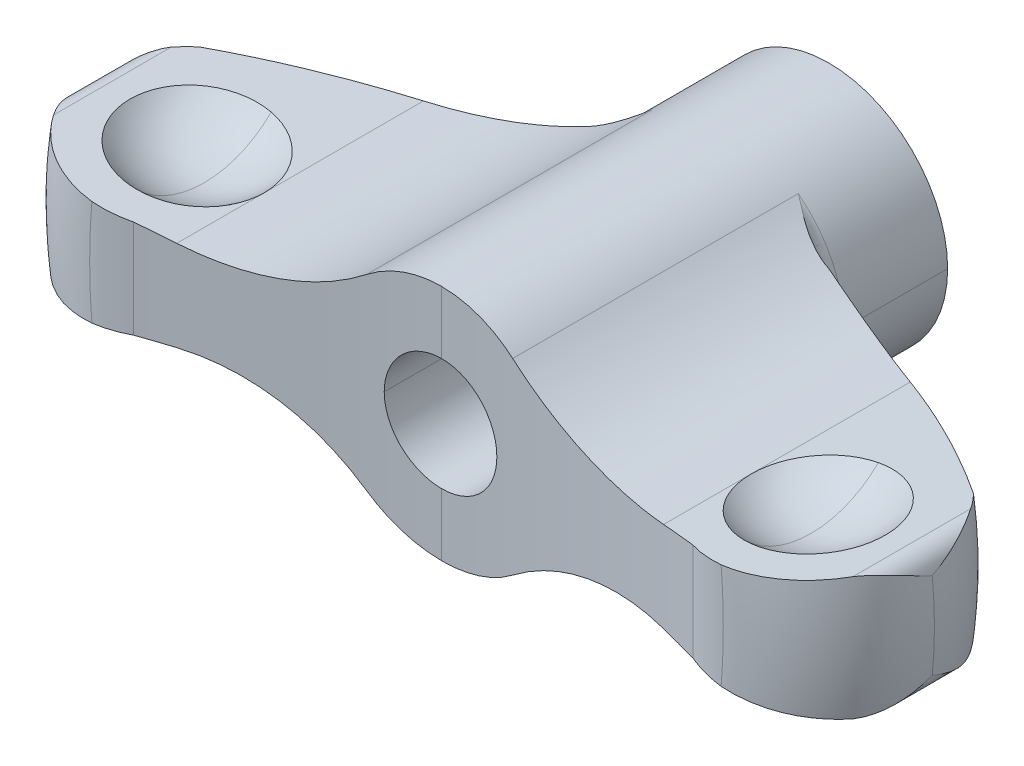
ISO-10303-21;
HEADER;
FILE_DESCRIPTION(('STEP AP214'),'2;1');
FILE_NAME('part.step','',(''),(''),'','','');
FILE_SCHEMA(('AUTOMOTIVE_DESIGN { 1 0 10303 214 1 1 1 1 }'));
ENDSEC;
DATA;
#1=APPLICATION_CONTEXT('core data for automotive mechanical design processes');
#2=APPLICATION_PROTOCOL_DEFINITION('international standard','automotive_design',2000,#1);
#3=PRODUCT_CONTEXT('',#1,'mechanical');
#4=PRODUCT('Part','Part','',(#3));
#5=PRODUCT_RELATED_PRODUCT_CATEGORY('part','',(#4));
#6=PRODUCT_DEFINITION_FORMATION('','',#4);
#7=PRODUCT_DEFINITION_CONTEXT('part definition',#1,'design');
#8=PRODUCT_DEFINITION('design','',#6,#7);
#9=PRODUCT_DEFINITION_SHAPE('','',#8);
#10=(LENGTH_UNIT() NAMED_UNIT(*) SI_UNIT(.MILLI.,.METRE.));
#11=(NAMED_UNIT(*) PLANE_ANGLE_UNIT() SI_UNIT($,.RADIAN.));
#12=(NAMED_UNIT(*) SI_UNIT($,.STERADIAN.) SOLID_ANGLE_UNIT());
#13=UNCERTAINTY_MEASURE_WITH_UNIT(LENGTH_MEASURE(1.E-05),#10,'distance_accuracy_value','');
#14=(GEOMETRIC_REPRESENTATION_CONTEXT(3) GLOBAL_UNCERTAINTY_ASSIGNED_CONTEXT((#13)) GLOBAL_UNIT_ASSIGNED_CONTEXT((#10,
#11,#12)) REPRESENTATION_CONTEXT('',''));
#15=CARTESIAN_POINT('',(0.,0.,0.));
#16=DIRECTION('',(0.,0.,1.));
#17=DIRECTION('',(1.,0.,0.));
#18=AXIS2_PLACEMENT_3D('',#15,#16,#17);
#19=CARTESIAN_POINT('',(0.,0.,18.));
#20=DIRECTION('',(0.,0.,-1.));
#21=DIRECTION('',(0.,-1.,0.));
#22=AXIS2_PLACEMENT_3D('',#19,#20,#21);
#23=TOROIDAL_SURFACE('',#22,18.,6.);
#24=CARTESIAN_POINT('',(21.977730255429,3.4226360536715,13.7573593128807));
#25=CARTESIAN_POINT('',(22.1148980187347,3.43705296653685,13.8951719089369));
#26=CARTESIAN_POINT('',(22.2448209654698,3.4507084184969,14.0389827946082));
#27=CARTESIAN_POINT('',(22.4901772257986,3.47649640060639,14.3386011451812));
#28=CARTESIAN_POINT('',(22.6056105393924,3.48862893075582,14.4944086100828));
#29=CARTESIAN_POINT('',(22.7137990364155,3.49999999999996,14.6562143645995));
#30=B_SPLINE_CURVE_WITH_KNOTS('',3,(#24,#25,#26,#27,#28,#29),.UNSPECIFIED.,.F.,.F.,(4,2,4),(0.,
0.582865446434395,1.16573089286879),.UNSPECIFIED.);
#31=CARTESIAN_POINT('',(21.977730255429,3.4226360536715,13.7573593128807));
#32=VERTEX_POINT('',#31);
#33=CARTESIAN_POINT('',(22.7137990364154,3.5,14.6562143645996));
#34=VERTEX_POINT('',#33);
#35=EDGE_CURVE('E282',#32,#34,#30,.T.);
#36=ORIENTED_EDGE('',*,*,#35,.T.);
#37=CARTESIAN_POINT('',(22.7137990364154,3.49999999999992,14.6562143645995));
#38=CARTESIAN_POINT('',(22.7337448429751,3.49999809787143,14.6855840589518));
#39=CARTESIAN_POINT('',(22.7534820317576,3.49948399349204,14.7150931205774));
#40=CARTESIAN_POINT('',(22.7930491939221,3.49746578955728,14.7751706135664));
#41=CARTESIAN_POINT('',(22.8128671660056,3.49593521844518,14.8057460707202));
#42=CARTESIAN_POINT('',(22.8525506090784,3.49187049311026,14.8679711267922));
#43=CARTESIAN_POINT('',(22.8724028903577,3.48931033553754,14.899627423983));
#44=CARTESIAN_POINT('',(22.9121080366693,3.48317090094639,14.9640274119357));
#45=CARTESIAN_POINT('',(22.93194657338,3.47956607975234,14.9967774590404));
#46=CARTESIAN_POINT('',(22.9921814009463,3.46703764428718,15.098009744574));
#47=CARTESIAN_POINT('',(23.0316323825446,3.45657528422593,15.1668705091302));
#48=CARTESIAN_POINT('',(23.1099900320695,3.4314908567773,15.3090592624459));
#49=CARTESIAN_POINT('',(23.1487563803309,3.41667729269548,15.3824301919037));
#50=CARTESIAN_POINT('',(23.2181157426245,3.38596509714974,15.5195051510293));
#51=CARTESIAN_POINT('',(23.249091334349,3.37051233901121,15.5831169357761));
#52=CARTESIAN_POINT('',(23.3104529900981,3.33652607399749,15.7142089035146));
#53=CARTESIAN_POINT('',(23.3407188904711,3.31787198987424,15.7817140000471));
#54=CARTESIAN_POINT('',(23.4002954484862,3.27739846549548,15.9206320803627));
#55=CARTESIAN_POINT('',(23.4294767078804,3.25546550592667,15.9920673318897));
#56=CARTESIAN_POINT('',(23.4864947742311,3.20836495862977,16.1388719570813));
#57=CARTESIAN_POINT('',(23.5141933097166,3.183090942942,16.214260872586));
#58=CARTESIAN_POINT('',(23.5623040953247,3.13476960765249,16.3530161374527));
#59=CARTESIAN_POINT('',(23.5831675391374,3.11203272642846,16.416335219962));
#60=CARTESIAN_POINT('',(23.6243043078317,3.06353993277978,16.5480431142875));
#61=CARTESIAN_POINT('',(23.6444097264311,3.03768620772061,16.616448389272));
#62=CARTESIAN_POINT('',(23.6835194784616,2.98287692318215,16.7583576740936));
#63=CARTESIAN_POINT('',(23.7023425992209,2.95383170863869,16.8318768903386));
#64=CARTESIAN_POINT('',(23.73833490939,2.89259496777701,16.9840331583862));
#65=CARTESIAN_POINT('',(23.7553095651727,2.86032288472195,17.0626839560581));
#66=CARTESIAN_POINT('',(23.7810371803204,2.80525234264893,17.1943835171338));
#67=CARTESIAN_POINT('',(23.7906651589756,2.7828003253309,17.2474085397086));
#68=CARTESIAN_POINT('',(23.810519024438,2.73222392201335,17.3657769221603));
#69=CARTESIAN_POINT('',(23.8203691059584,2.70398748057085,17.431135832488));
#70=CARTESIAN_POINT('',(23.8394872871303,2.64170079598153,17.5742249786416));
#71=CARTESIAN_POINT('',(23.848299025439,2.60755421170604,17.6519743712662));
#72=CARTESIAN_POINT('',(23.8639224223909,2.53327674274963,17.819818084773));
#73=CARTESIAN_POINT('',(23.8701979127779,2.49305295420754,17.9099215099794));
#74=CARTESIAN_POINT('',(23.8743581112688,2.45255474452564,18.));
#75=B_SPLINE_CURVE_WITH_KNOTS('',3,(#37,#38,#39,#40,#41,#42,#43,#44,#45,#46,#47,#48,#49,#50,#51,
#52,#53,#54,#55,#56,#57,#58,#59,#60,#61,#62,#63,#64,#65,#66,#67,#68,#69,#70,#71,#72,#73,#74),
.UNSPECIFIED.,.F.,.F.,(4,2,2,2,2,2,2,2,2,2,2,2,2,2,2,2,2,2,4),(0.,0.106499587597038,
0.215887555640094,0.328231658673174,0.443595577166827,0.68359398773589,0.936345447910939,
1.1535372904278,1.3823468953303,1.62293629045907,1.87544734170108,2.08672005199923,
2.3141921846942,2.55791147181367,2.81791458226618,2.99304229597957,3.20863194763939,
3.46469242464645,3.76122005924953),.UNSPECIFIED.);
#76=CARTESIAN_POINT('',(23.8743581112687,2.45255474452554,18.));
#77=VERTEX_POINT('',#76);
#78=EDGE_CURVE('E788',#77,#34,#75,.F.);
#79=ORIENTED_EDGE('',*,*,#78,.F.);
#80=CARTESIAN_POINT('',(0.,0.,18.));
#81=DIRECTION('',(0.,0.,-1.));
#82=DIRECTION('',(0.,-1.,0.));
#83=AXIS2_PLACEMENT_3D('',#80,#81,#82);
#84=CIRCLE('',#83,24.);
#85=CARTESIAN_POINT('',(23.8743581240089,-2.45255462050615,18.));
#86=VERTEX_POINT('',#85);
#87=EDGE_CURVE('E707',#86,#77,#84,.F.);
#88=ORIENTED_EDGE('',*,*,#87,.F.);
#89=CARTESIAN_POINT('',(23.874358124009,-2.45255462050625,18.));
#90=CARTESIAN_POINT('',(23.8701995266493,-2.49303723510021,17.9099576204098));
#91=CARTESIAN_POINT('',(23.8639273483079,-2.53324548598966,17.8198902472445));
#92=CARTESIAN_POINT('',(23.8483115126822,-2.60750265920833,17.6520944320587));
#93=CARTESIAN_POINT('',(23.8395028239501,-2.64164431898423,17.5743569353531));
#94=CARTESIAN_POINT('',(23.8203882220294,-2.70393144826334,17.4312674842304));
#95=CARTESIAN_POINT('',(23.8105377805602,-2.73217311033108,17.3658964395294));
#96=CARTESIAN_POINT('',(23.7906781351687,-2.78277017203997,17.2474800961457));
#97=CARTESIAN_POINT('',(23.7810441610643,-2.80523740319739,17.1944192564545));
#98=CARTESIAN_POINT('',(23.755311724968,-2.860318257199,17.0626950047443));
#99=CARTESIAN_POINT('',(23.7383396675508,-2.89258614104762,16.9840553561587));
#100=CARTESIAN_POINT('',(23.7023517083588,-2.95381735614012,16.8319137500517));
#101=CARTESIAN_POINT('',(23.6835300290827,-2.9828611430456,16.7583980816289));
#102=CARTESIAN_POINT('',(23.6444213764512,-3.03767054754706,16.616488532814));
#103=CARTESIAN_POINT('',(23.6243153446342,-3.0635256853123,16.5480794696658));
#104=CARTESIAN_POINT('',(23.5831747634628,-3.11202436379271,16.4163569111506));
#105=CARTESIAN_POINT('',(23.5623078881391,-3.13476554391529,16.3530269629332));
#106=CARTESIAN_POINT('',(23.5141971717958,-3.18308736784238,16.2142721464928));
#107=CARTESIAN_POINT('',(23.4865029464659,-3.20835813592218,16.1388944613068));
#108=CARTESIAN_POINT('',(23.4294915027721,-3.25545451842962,15.9921044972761));
#109=CARTESIAN_POINT('',(23.4003122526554,-3.27738636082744,15.9206727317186));
#110=CARTESIAN_POINT('',(23.3407368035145,-3.31786002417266,15.7817542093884));
#111=CARTESIAN_POINT('',(23.3104697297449,-3.33651512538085,15.7142452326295));
#112=CARTESIAN_POINT('',(23.2491019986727,-3.37050600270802,15.5831385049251));
#113=CARTESIAN_POINT('',(23.218121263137,-3.38596206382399,15.5195158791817));
#114=CARTESIAN_POINT('',(23.1487585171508,-3.41667703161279,15.3824346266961));
#115=CARTESIAN_POINT('',(23.1099944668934,-3.4314907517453,15.3090681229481));
#116=CARTESIAN_POINT('',(23.0316402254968,-3.45657531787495,15.1668850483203));
#117=CARTESIAN_POINT('',(22.9921902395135,-3.46703756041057,15.0980255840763));
#118=CARTESIAN_POINT('',(22.9319563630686,-3.47956590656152,14.9967941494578));
#119=CARTESIAN_POINT('',(22.9121177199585,-3.48317074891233,14.9640436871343));
#120=CARTESIAN_POINT('',(22.8724119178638,-3.48931023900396,14.8996421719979));
#121=CARTESIAN_POINT('',(22.8525590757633,-3.49187041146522,14.867984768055));
#122=CARTESIAN_POINT('',(22.8128740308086,-3.49593518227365,14.8057568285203));
#123=CARTESIAN_POINT('',(22.793055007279,-3.49746576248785,14.7751795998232));
#124=CARTESIAN_POINT('',(22.7534852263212,-3.49948399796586,14.7150979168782));
#125=CARTESIAN_POINT('',(22.7337464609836,-3.49999810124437,14.6855864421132));
#126=CARTESIAN_POINT('',(22.7137990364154,-3.49999999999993,14.6562143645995));
#127=B_SPLINE_CURVE_WITH_KNOTS('',3,(#89,#90,#91,#92,#93,#94,#95,#96,#97,#98,#99,#100,#101,#102,
#103,#104,#105,#106,#107,#108,#109,#110,#111,#112,#113,#114,#115,#116,#117,#118,#119,#120,#121,
#122,#123,#124,#125,#126),.UNSPECIFIED.,.F.,.F.,(4,2,2,2,2,2,2,2,2,2,2,2,2,2,2,2,2,2,4),(0.,
0.296409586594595,0.552430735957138,0.768059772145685,0.943305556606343,1.20327214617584,
1.44697927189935,1.67446358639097,1.88577279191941,2.13824653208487,2.37882350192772,
2.6076455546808,2.82487466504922,3.07761148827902,3.31760499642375,3.43297014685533,
3.54531794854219,3.65471208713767,3.76122031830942),.UNSPECIFIED.);
#128=CARTESIAN_POINT('',(22.7137990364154,-3.5,14.6562143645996));
#129=VERTEX_POINT('',#128);
#130=EDGE_CURVE('E275',#129,#86,#127,.F.);
#131=ORIENTED_EDGE('',*,*,#130,.F.);
#132=CARTESIAN_POINT('',(22.7137990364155,-3.5,14.6562143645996));
#133=CARTESIAN_POINT('',(22.6056105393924,-3.48862893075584,14.4944086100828));
#134=CARTESIAN_POINT('',(22.4901772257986,-3.47649640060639,14.3386011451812));
#135=CARTESIAN_POINT('',(22.2448209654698,-3.45070841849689,14.0389827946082));
#136=CARTESIAN_POINT('',(22.1148980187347,-3.43705296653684,13.8951719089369));
#137=CARTESIAN_POINT('',(21.977730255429,-3.4226360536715,13.7573593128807));
#138=B_SPLINE_CURVE_WITH_KNOTS('',3,(#132,#133,#134,#135,#136,#137),.UNSPECIFIED.,.F.,.F.,(4,2,
4),(0.,0.582865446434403,1.16573089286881),.UNSPECIFIED.);
#139=CARTESIAN_POINT('',(21.977730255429,-3.42263605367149,13.7573593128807));
#140=VERTEX_POINT('',#139);
#141=EDGE_CURVE('E270',#129,#140,#138,.T.);
#142=ORIENTED_EDGE('',*,*,#141,.T.);
#143=CARTESIAN_POINT('',(0.,0.,13.7573593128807));
#144=DIRECTION('',(0.,0.,-1.));
#145=DIRECTION('',(0.,-1.,0.));
#146=AXIS2_PLACEMENT_3D('',#143,#144,#145);
#147=CIRCLE('',#146,22.2426406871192);
#148=EDGE_CURVE('E272',#32,#140,#147,.T.);
#149=ORIENTED_EDGE('',*,*,#148,.F.);
#150=EDGE_LOOP('',(#36,#79,#88,#131,#142,#149));
#151=FACE_BOUND('',#150,.T.);
#152=ADVANCED_FACE('F15',(#151),#23,.T.);
#153=CARTESIAN_POINT('',(22.7137990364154,2.33333333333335,0.));
#154=DIRECTION('',(0.,0.,-1.));
#155=DIRECTION('',(0.,-1.,0.));
#156=AXIS2_PLACEMENT_3D('',#153,#154,#155);
#157=CYLINDRICAL_SURFACE('',#156,1.16666666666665);
#158=ORIENTED_EDGE('',*,*,#78,.T.);
#159=DIRECTION('',(0.,0.,1.));
#160=VECTOR('',#159,1.);
#161=CARTESIAN_POINT('',(22.7137990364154,3.5,0.));
#162=LINE('',#161,#160);
#163=CARTESIAN_POINT('',(22.7137990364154,3.5,21.3437856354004));
#164=VERTEX_POINT('',#163);
#165=EDGE_CURVE('E777',#34,#164,#162,.T.);
#166=ORIENTED_EDGE('',*,*,#165,.T.);
#167=CARTESIAN_POINT('',(23.8743581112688,2.45255474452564,18.));
#168=CARTESIAN_POINT('',(23.8701982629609,2.4930495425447,18.0900709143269));
#169=CARTESIAN_POINT('',(23.8639234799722,2.53326995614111,18.1801667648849));
#170=CARTESIAN_POINT('',(23.8483016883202,2.6075430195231,18.3480004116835));
#171=CARTESIAN_POINT('',(23.8394905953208,2.64168853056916,18.425747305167));
#172=CARTESIAN_POINT('',(23.8203731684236,2.70397529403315,18.5688365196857));
#173=CARTESIAN_POINT('',(23.8105230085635,2.73221284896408,18.6341979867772));
#174=CARTESIAN_POINT('',(23.7906679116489,2.78279375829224,18.7525764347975));
#175=CARTESIAN_POINT('',(23.7810386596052,2.80524909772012,18.8056089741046));
#176=CARTESIAN_POINT('',(23.7553117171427,2.86031839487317,18.9373049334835));
#177=CARTESIAN_POINT('',(23.7383396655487,2.89258617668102,19.0159446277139));
#178=CARTESIAN_POINT('',(23.7023517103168,2.95381732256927,19.1680862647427));
#179=CARTESIAN_POINT('',(23.6835300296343,2.98286113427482,19.2416019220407));
#180=CARTESIAN_POINT('',(23.6444213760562,3.03767055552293,19.3835114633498));
#181=CARTESIAN_POINT('',(23.6243153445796,3.06352568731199,19.4519205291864));
#182=CARTESIAN_POINT('',(23.5831747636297,3.11202436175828,19.5836430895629));
#183=CARTESIAN_POINT('',(23.5623078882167,3.13476554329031,19.6469730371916));
#184=CARTESIAN_POINT('',(23.5141971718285,3.18308736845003,19.7857278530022));
#185=CARTESIAN_POINT('',(23.4865029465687,3.20835813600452,19.8611055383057));
#186=CARTESIAN_POINT('',(23.4294915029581,3.25545451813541,20.0078955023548));
#187=CARTESIAN_POINT('',(23.4003122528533,3.27738636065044,20.0793272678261));
#188=CARTESIAN_POINT('',(23.3407368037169,3.3178600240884,20.2182457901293));
#189=CARTESIAN_POINT('',(23.3104697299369,3.33651512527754,20.2857547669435));
#190=CARTESIAN_POINT('',(23.2491019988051,3.37050600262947,20.416861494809));
#191=CARTESIAN_POINT('',(23.2181212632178,3.38596206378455,20.4804841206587));
#192=CARTESIAN_POINT('',(23.1487585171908,3.41667703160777,20.6175653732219));
#193=CARTESIAN_POINT('',(23.1099944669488,3.43149075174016,20.6909318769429));
#194=CARTESIAN_POINT('',(23.0316402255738,3.45657531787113,20.8331149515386));
#195=CARTESIAN_POINT('',(22.9921902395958,3.46703756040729,20.9019744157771));
#196=CARTESIAN_POINT('',(22.9319563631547,3.47956590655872,21.0032058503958));
#197=CARTESIAN_POINT('',(22.9121177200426,3.4831707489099,21.0359563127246));
#198=CARTESIAN_POINT('',(22.8724119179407,3.48931023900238,21.1003578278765));
#199=CARTESIAN_POINT('',(22.852559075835,3.49187041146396,21.1320152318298));
#200=CARTESIAN_POINT('',(22.8128740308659,3.49593518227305,21.19424317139));
#201=CARTESIAN_POINT('',(22.7930550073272,3.49746576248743,21.2248204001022));
#202=CARTESIAN_POINT('',(22.7534852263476,3.49948399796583,21.2849020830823));
#203=CARTESIAN_POINT('',(22.733746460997,3.49999810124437,21.3144135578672));
#204=CARTESIAN_POINT('',(22.7137990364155,3.49999999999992,21.3437856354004));
#205=B_SPLINE_CURVE_WITH_KNOTS('',3,(#167,#168,#169,#170,#171,#172,#173,#174,#175,#176,#177,
#178,#179,#180,#181,#182,#183,#184,#185,#186,#187,#188,#189,#190,#191,#192,#193,#194,#195,#196,
#197,#198,#199,#200,#201,#202,#203,#204),.UNSPECIFIED.,.F.,.F.,(4,2,2,2,2,2,2,2,2,2,2,2,2,2,2,2,
2,2,4),(0.,0.296502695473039,0.552554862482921,0.768152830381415,0.943305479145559,
1.20327206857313,1.44697919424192,1.67446350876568,1.88577271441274,2.13824645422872,
2.37882342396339,2.60764547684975,2.82487458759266,3.07761141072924,3.31760491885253,
3.43297006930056,3.54531787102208,3.65471200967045,3.76122024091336),.UNSPECIFIED.);
#206=EDGE_CURVE('E670',#77,#164,#205,.T.);
#207=ORIENTED_EDGE('',*,*,#206,.F.);
#208=EDGE_LOOP('',(#158,#166,#207));
#209=FACE_BOUND('',#208,.T.);
#210=ADVANCED_FACE('F819',(#209),#157,.T.);
#211=CARTESIAN_POINT('',(17.25,6.75,18.25));
#212=DIRECTION('',(0.,0.,1.));
#213=DIRECTION('',(-1.,0.,0.));
#214=AXIS2_PLACEMENT_3D('',#211,#212,#213);
#215=SPHERICAL_SURFACE('',#214,5.4);
#216=CARTESIAN_POINT('',(17.25,6.75,18.25));
#217=DIRECTION('',(1.,0.,0.));
#218=DIRECTION('',(0.,0.,1.));
#219=AXIS2_PLACEMENT_3D('',#216,#217,#218);
#220=CIRCLE('',#219,5.4);
#221=CARTESIAN_POINT('',(17.25,1.35,18.25));
#222=VERTEX_POINT('',#221);
#223=CARTESIAN_POINT('',(17.25,2.92573158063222,22.062475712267));
#224=VERTEX_POINT('',#223);
#225=EDGE_CURVE('E801',#222,#224,#220,.F.);
#226=ORIENTED_EDGE('',*,*,#225,.T.);
#227=CARTESIAN_POINT('',(17.25,2.92573158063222,22.062475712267));
#228=CARTESIAN_POINT('',(17.3566407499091,2.93693997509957,22.0737291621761));
#229=CARTESIAN_POINT('',(17.4637505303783,2.94819766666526,22.0804377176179));
#230=CARTESIAN_POINT('',(17.6781466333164,2.97073160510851,22.0847651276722));
#231=CARTESIAN_POINT('',(17.7854329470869,2.98200785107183,22.0823844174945));
#232=CARTESIAN_POINT('',(17.9993557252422,3.00449204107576,22.0685393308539));
#233=CARTESIAN_POINT('',(18.1059925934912,3.0157000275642,22.0570813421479));
#234=CARTESIAN_POINT('',(18.317899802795,3.03797237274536,22.0251903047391));
#235=CARTESIAN_POINT('',(18.4231701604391,3.04903673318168,22.0047573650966));
#236=CARTESIAN_POINT('',(18.7359174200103,3.08190779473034,21.9301450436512));
#237=CARTESIAN_POINT('',(18.9404210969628,3.10340199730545,21.8626462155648));
#238=CARTESIAN_POINT('',(19.3351018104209,3.14488461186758,21.6941292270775));
#239=CARTESIAN_POINT('',(19.5252816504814,3.1648733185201,21.5931176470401));
#240=CARTESIAN_POINT('',(19.8861130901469,3.20279823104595,21.3604156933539));
#241=CARTESIAN_POINT('',(20.0567642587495,3.22073439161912,21.2287246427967));
#242=CARTESIAN_POINT('',(20.3736745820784,3.2540430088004,20.9383859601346));
#243=CARTESIAN_POINT('',(20.5199300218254,3.26941507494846,20.7797342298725));
#244=CARTESIAN_POINT('',(20.7838696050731,3.29715624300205,20.4399985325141));
#245=CARTESIAN_POINT('',(20.9015550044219,3.30952547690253,20.2589155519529));
#246=CARTESIAN_POINT('',(21.1050125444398,3.33090972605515,19.8794651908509));
#247=CARTESIAN_POINT('',(21.1907867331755,3.33992495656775,19.6810989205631));
#248=CARTESIAN_POINT('',(21.3279998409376,3.35434663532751,19.2726986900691));
#249=CARTESIAN_POINT('',(21.3794381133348,3.35975301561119,19.0626645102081));
#250=CARTESIAN_POINT('',(21.4465173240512,3.36680332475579,18.6368883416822));
#251=CARTESIAN_POINT('',(21.462157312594,3.36844715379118,18.421146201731));
#252=CARTESIAN_POINT('',(21.4571932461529,3.36792540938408,17.9900840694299));
#253=CARTESIAN_POINT('',(21.4365892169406,3.36575983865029,17.7747640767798));
#254=CARTESIAN_POINT('',(21.3597229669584,3.35768087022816,17.3506638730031));
#255=CARTESIAN_POINT('',(21.3034616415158,3.35176756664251,17.1418834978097));
#256=CARTESIAN_POINT('',(21.156880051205,3.33636122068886,16.7367865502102));
#257=CARTESIAN_POINT('',(21.0665603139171,3.3268682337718,16.5404697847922));
#258=CARTESIAN_POINT('',(20.8544187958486,3.30457126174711,16.1658584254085));
#259=CARTESIAN_POINT('',(20.7325952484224,3.29176709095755,15.9875648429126));
#260=CARTESIAN_POINT('',(20.4609056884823,3.26321136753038,15.6540690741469));
#261=CARTESIAN_POINT('',(20.3110388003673,3.24745972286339,15.4988676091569));
#262=CARTESIAN_POINT('',(19.9875278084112,3.21345734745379,15.2159844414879));
#263=CARTESIAN_POINT('',(19.8138865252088,3.19520691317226,15.0882994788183));
#264=CARTESIAN_POINT('',(19.447779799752,3.1567275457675,14.8640526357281));
#265=CARTESIAN_POINT('',(19.2553139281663,3.13649856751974,14.767491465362));
#266=CARTESIAN_POINT('',(18.8568521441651,3.0946185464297,14.6082122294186));
#267=CARTESIAN_POINT('',(18.6508552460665,3.07296739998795,14.5454966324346));
#268=CARTESIAN_POINT('',(18.3436575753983,3.04067962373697,14.4797242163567));
#269=CARTESIAN_POINT('',(18.2452279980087,3.03033425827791,14.4626927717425));
#270=CARTESIAN_POINT('',(18.0473221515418,3.00953351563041,14.4364394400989));
#271=CARTESIAN_POINT('',(17.9478459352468,2.99907814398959,14.4272171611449));
#272=CARTESIAN_POINT('',(17.7484767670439,2.97812360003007,14.4166533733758));
#273=CARTESIAN_POINT('',(17.6485837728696,2.96762442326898,14.4153126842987));
#274=CARTESIAN_POINT('',(17.4489917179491,2.94664645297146,14.4205097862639));
#275=CARTESIAN_POINT('',(17.3492926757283,2.93616766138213,14.4270482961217));
#276=CARTESIAN_POINT('',(17.25,2.92573158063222,14.4375242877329));
#277=B_SPLINE_CURVE_WITH_KNOTS('',3,(#227,#228,#229,#230,#231,#232,#233,#234,#235,#236,#237,
#238,#239,#240,#241,#242,#243,#244,#245,#246,#247,#248,#249,#250,#251,#252,#253,#254,#255,#256,
#257,#258,#259,#260,#261,#262,#263,#264,#265,#266,#267,#268,#269,#270,#271,#272,#273,#274,#275,
#276),.UNSPECIFIED.,.F.,.F.,(4,2,2,2,2,2,2,2,2,2,2,2,2,2,2,2,2,2,2,2,2,2,2,2,4),(0.,
0.323345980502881,0.646676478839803,0.96977964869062,1.29287889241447,1.93880698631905,
2.58460832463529,3.23042391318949,3.87633775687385,4.52222320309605,5.16806718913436,
5.81392333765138,6.4597966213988,7.10566944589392,7.75152605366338,8.39737265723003,
9.04325548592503,9.68915848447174,10.3349849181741,10.9808260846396,11.6267143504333,
11.9277483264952,12.2287671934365,12.5298173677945,12.8308950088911),.UNSPECIFIED.);
#278=CARTESIAN_POINT('',(17.25,2.92573158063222,14.4375242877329));
#279=VERTEX_POINT('',#278);
#280=EDGE_CURVE('E747',#224,#279,#277,.T.);
#281=ORIENTED_EDGE('',*,*,#280,.T.);
#282=CARTESIAN_POINT('',(17.25,6.75,18.25));
#283=DIRECTION('',(1.,0.,0.));
#284=DIRECTION('',(0.,0.,1.));
#285=AXIS2_PLACEMENT_3D('',#282,#283,#284);
#286=CIRCLE('',#285,5.4);
#287=EDGE_CURVE('E715',#279,#222,#286,.F.);
#288=ORIENTED_EDGE('',*,*,#287,.T.);
#289=EDGE_LOOP('',(#226,#281,#288));
#290=FACE_BOUND('',#289,.T.);
#291=ADVANCED_FACE('F725',(#290),#215,.F.);
#292=CARTESIAN_POINT('',(17.25,6.75,18.25));
#293=DIRECTION('',(0.,0.,1.));
#294=DIRECTION('',(-1.,0.,0.));
#295=AXIS2_PLACEMENT_3D('',#292,#293,#294);
#296=SPHERICAL_SURFACE('',#295,5.4);
#297=CARTESIAN_POINT('',(17.25,2.92573158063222,14.4375242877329));
#298=CARTESIAN_POINT('',(17.1433574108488,2.91452299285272,14.4487571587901));
#299=CARTESIAN_POINT('',(17.0371935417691,2.90336472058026,14.464533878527));
#300=CARTESIAN_POINT('',(16.8265681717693,2.88122710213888,14.5050161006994));
#301=CARTESIAN_POINT('',(16.7221065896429,2.87024774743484,14.529721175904));
#302=CARTESIAN_POINT('',(16.5156923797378,2.8485527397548,14.5878820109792));
#303=CARTESIAN_POINT('',(16.4137380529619,2.83783690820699,14.6213316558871));
#304=CARTESIAN_POINT('',(16.2130176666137,2.81674034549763,14.6967258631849));
#305=CARTESIAN_POINT('',(16.114251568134,2.80635961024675,14.7386703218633));
#306=CARTESIAN_POINT('',(15.8236921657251,2.77582058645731,14.8768908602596));
#307=CARTESIAN_POINT('',(15.63755544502,2.75625682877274,14.9855773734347));
#308=CARTESIAN_POINT('',(15.2862224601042,2.71933024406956,15.2327482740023));
#309=CARTESIAN_POINT('',(15.1210209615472,2.70196686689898,15.3712251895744));
#310=CARTESIAN_POINT('',(14.8160669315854,2.66991490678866,15.6740954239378));
#311=CARTESIAN_POINT('',(14.676311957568,2.65522606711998,15.8384862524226));
#312=CARTESIAN_POINT('',(14.4261783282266,2.62893596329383,16.1886069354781));
#313=CARTESIAN_POINT('',(14.315812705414,2.6173360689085,16.3743462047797));
#314=CARTESIAN_POINT('',(14.127617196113,2.59755592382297,16.7618844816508));
#315=CARTESIAN_POINT('',(14.0498041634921,2.58937744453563,16.9636917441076));
#316=CARTESIAN_POINT('',(13.9290924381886,2.57669013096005,17.3774240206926));
#317=CARTESIAN_POINT('',(13.8861423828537,2.57217589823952,17.589333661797));
#318=CARTESIAN_POINT('',(13.8525068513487,2.56864066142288,17.8773186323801));
#319=CARTESIAN_POINT('',(13.8460058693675,2.56795738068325,17.9517714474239));
#320=CARTESIAN_POINT('',(13.8373477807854,2.56704737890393,18.1008056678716));
#321=CARTESIAN_POINT('',(13.8351833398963,2.56681988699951,18.1753866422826));
#322=CARTESIAN_POINT('',(13.8351792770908,2.56681945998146,18.25));
#323=B_SPLINE_CURVE_WITH_KNOTS('',3,(#297,#298,#299,#300,#301,#302,#303,#304,#305,#306,#307,
#308,#309,#310,#311,#312,#313,#314,#315,#316,#317,#318,#319,#320,#321,#322),.UNSPECIFIED.,.F.,
.F.,(4,2,2,2,2,2,2,2,2,2,2,2,4),(0.,0.323345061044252,0.646674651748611,0.969778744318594,
1.29287889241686,1.93882452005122,2.58460832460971,3.23033010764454,3.87633775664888,
4.52267945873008,5.16806718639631,5.39219018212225,5.61593380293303),.UNSPECIFIED.);
#324=CARTESIAN_POINT('',(13.8351792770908,2.56681945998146,18.25));
#325=VERTEX_POINT('',#324);
#326=EDGE_CURVE('E731',#279,#325,#323,.T.);
#327=ORIENTED_EDGE('',*,*,#326,.T.);
#328=CARTESIAN_POINT('',(13.8351792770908,2.56681945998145,18.25));
#329=CARTESIAN_POINT('',(13.8351690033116,2.56681838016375,18.3578167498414));
#330=CARTESIAN_POINT('',(13.8397029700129,2.56729491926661,18.4656286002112));
#331=CARTESIAN_POINT('',(13.8577798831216,2.56919487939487,18.6804809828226));
#332=CARTESIAN_POINT('',(13.8713223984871,2.57061825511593,18.7875215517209));
#333=CARTESIAN_POINT('',(13.9073243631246,2.57440221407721,19.0000061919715));
#334=CARTESIAN_POINT('',(13.9297775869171,2.57676214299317,19.1054513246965));
#335=CARTESIAN_POINT('',(13.9834188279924,2.5824000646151,19.3140390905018));
#336=CARTESIAN_POINT('',(14.014606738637,2.58567804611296,19.4171817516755));
#337=CARTESIAN_POINT('',(14.1210210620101,2.59686264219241,19.7221624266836));
#338=CARTESIAN_POINT('',(14.2091125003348,2.60612142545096,19.9196378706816));
#339=CARTESIAN_POINT('',(14.4169521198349,2.62796624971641,20.2967550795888));
#340=CARTESIAN_POINT('',(14.5366923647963,2.64055145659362,20.4764012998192));
#341=CARTESIAN_POINT('',(14.8044605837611,2.66869503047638,20.8129466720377));
#342=CARTESIAN_POINT('',(14.9524858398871,2.68425311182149,20.969848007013));
#343=CARTESIAN_POINT('',(15.2727061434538,2.7179096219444,21.2564988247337));
#344=CARTESIAN_POINT('',(15.4449118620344,2.7360091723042,21.3862362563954));
#345=CARTESIAN_POINT('',(15.8086008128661,2.77423442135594,21.6148492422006));
#346=CARTESIAN_POINT('',(16.0000939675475,2.79436116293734,21.7137088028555));
#347=CARTESIAN_POINT('',(16.3967286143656,2.83604914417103,21.8775677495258));
#348=CARTESIAN_POINT('',(16.6018495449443,2.85760822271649,21.9426168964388));
#349=CARTESIAN_POINT('',(16.8831878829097,2.88717807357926,22.0062844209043));
#350=CARTESIAN_POINT('',(16.9561512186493,2.8948468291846,22.0205495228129));
#351=CARTESIAN_POINT('',(17.1026580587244,2.91024531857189,22.0447491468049));
#352=CARTESIAN_POINT('',(17.1762003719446,2.91797492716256,22.0546909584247));
#353=CARTESIAN_POINT('',(17.25,2.92573158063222,22.062475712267));
#354=B_SPLINE_CURVE_WITH_KNOTS('',3,(#328,#329,#330,#331,#332,#333,#334,#335,#336,#337,#338,
#339,#340,#341,#342,#343,#344,#345,#346,#347,#348,#349,#350,#351,#352,#353),.UNSPECIFIED.,.F.,
.F.,(4,2,2,2,2,2,2,2,2,2,2,2,4),(0.,0.323345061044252,0.646674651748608,0.969778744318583,
1.29287889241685,1.9388245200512,2.58460832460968,3.23033010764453,3.87633775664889,
4.5226794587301,5.16806718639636,5.39219018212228,5.61593380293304),.UNSPECIFIED.);
#355=EDGE_CURVE('E739',#325,#224,#354,.T.);
#356=ORIENTED_EDGE('',*,*,#355,.T.);
#357=ORIENTED_EDGE('',*,*,#225,.F.);
#358=ORIENTED_EDGE('',*,*,#287,.F.);
#359=EDGE_LOOP('',(#327,#356,#357,#358));
#360=FACE_BOUND('',#359,.T.);
#361=ADVANCED_FACE('F721',(#360),#296,.F.);
#362=CARTESIAN_POINT('',(0.,0.,18.));
#363=DIRECTION('',(0.,0.,-1.));
#364=DIRECTION('',(0.,-1.,0.));
#365=AXIS2_PLACEMENT_3D('',#362,#363,#364);
#366=TOROIDAL_SURFACE('',#365,18.,6.);
#367=CARTESIAN_POINT('',(17.8757076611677,-2.99149610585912,23.9987124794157));
#368=CARTESIAN_POINT('',(18.0439542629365,-3.00917953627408,23.9952318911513));
#369=CARTESIAN_POINT('',(18.2120514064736,-3.02684725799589,23.9845859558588));
#370=CARTESIAN_POINT('',(18.5467541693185,-3.06202593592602,23.9491139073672));
#371=CARTESIAN_POINT('',(18.7133598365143,-3.07953689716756,23.9242882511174));
#372=CARTESIAN_POINT('',(19.0437271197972,-3.11425989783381,23.8606399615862));
#373=CARTESIAN_POINT('',(19.2074914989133,-3.13147222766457,23.8218318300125));
#374=CARTESIAN_POINT('',(19.5311857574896,-3.16549386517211,23.730491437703));
#375=CARTESIAN_POINT('',(19.6911157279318,-3.18230318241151,23.6779595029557));
#376=CARTESIAN_POINT('',(20.0061065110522,-3.21541004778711,23.5595000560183));
#377=CARTESIAN_POINT('',(20.1611641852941,-3.23170726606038,23.4935641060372));
#378=CARTESIAN_POINT('',(20.4652571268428,-3.26366872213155,23.3487536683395));
#379=CARTESIAN_POINT('',(20.6142900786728,-3.27933271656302,23.2698742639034));
#380=CARTESIAN_POINT('',(20.9050901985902,-3.3098970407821,23.0998205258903));
#381=CARTESIAN_POINT('',(21.0468629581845,-3.32479795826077,23.0086558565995));
#382=CARTESIAN_POINT('',(21.3223050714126,-3.35374809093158,22.8145922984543));
#383=CARTESIAN_POINT('',(21.4559718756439,-3.36779703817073,22.7116897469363));
#384=CARTESIAN_POINT('',(21.693287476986,-3.3927399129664,22.5124611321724));
#385=CARTESIAN_POINT('',(21.7982943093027,-3.4037765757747,22.4177640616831));
#386=CARTESIAN_POINT('',(22.0013794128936,-3.42512168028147,22.2211347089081));
#387=CARTESIAN_POINT('',(22.0994579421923,-3.4354301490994,22.1192026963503));
#388=CARTESIAN_POINT('',(22.2882075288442,-3.45526853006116,21.9085914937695));
#389=CARTESIAN_POINT('',(22.3788771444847,-3.46479829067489,21.7999109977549));
#390=CARTESIAN_POINT('',(22.5523526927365,-3.48303130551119,21.5763545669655));
#391=CARTESIAN_POINT('',(22.6351574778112,-3.4917344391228,21.4614777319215));
#392=CARTESIAN_POINT('',(22.7137990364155,-3.5,21.3437856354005));
#393=B_SPLINE_CURVE_WITH_KNOTS('',3,(#367,#368,#369,#370,#371,#372,#373,#374,#375,#376,#377,
#378,#379,#380,#381,#382,#383,#384,#385,#386,#387,#388,#389,#390,#391,#392),.UNSPECIFIED.,.F.,
.F.,(4,2,2,2,2,2,2,2,2,2,2,2,4),(0.,0.507473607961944,1.01493086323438,1.5218633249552,
2.02878374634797,2.53602426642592,3.04345791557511,3.55049469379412,4.05769012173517,
4.4828373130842,4.90796866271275,5.33318254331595,5.75845837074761),.UNSPECIFIED.);
#394=CARTESIAN_POINT('',(17.8757076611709,-2.99149610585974,23.9987124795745));
#395=VERTEX_POINT('',#394);
#396=CARTESIAN_POINT('',(22.7137990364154,-3.5,21.3437856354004));
#397=VERTEX_POINT('',#396);
#398=EDGE_CURVE('E308',#395,#397,#393,.T.);
#399=ORIENTED_EDGE('',*,*,#398,.T.);
#400=CARTESIAN_POINT('',(22.7137990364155,-3.49999999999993,21.3437856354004));
#401=CARTESIAN_POINT('',(22.7337448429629,-3.49999809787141,21.3144159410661));
#402=CARTESIAN_POINT('',(22.7534820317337,-3.49948399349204,21.2849068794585));
#403=CARTESIAN_POINT('',(22.7930491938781,-3.49746578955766,21.2248293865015));
#404=CARTESIAN_POINT('',(22.8128671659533,-3.49593521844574,21.1942539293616));
#405=CARTESIAN_POINT('',(22.852550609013,-3.49187049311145,21.1320288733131));
#406=CARTESIAN_POINT('',(22.8724028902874,-3.48931033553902,21.1003725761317));
#407=CARTESIAN_POINT('',(22.9121080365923,-3.48317090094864,21.0359725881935));
#408=CARTESIAN_POINT('',(22.9319465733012,-3.47956607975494,21.0032225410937));
#409=CARTESIAN_POINT('',(22.9921814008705,-3.46703764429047,20.9019902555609));
#410=CARTESIAN_POINT('',(23.0316323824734,-3.45657528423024,20.8331294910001));
#411=CARTESIAN_POINT('',(23.1099900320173,-3.43149085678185,20.6909407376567));
#412=CARTESIAN_POINT('',(23.1487563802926,-3.41667729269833,20.6175698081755));
#413=CARTESIAN_POINT('',(23.2181157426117,-3.38596509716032,20.4804948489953));
#414=CARTESIAN_POINT('',(23.2490913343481,-3.37051233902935,20.4168830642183));
#415=CARTESIAN_POINT('',(23.3104529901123,-3.3365260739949,20.2857910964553));
#416=CARTESIAN_POINT('',(23.3407188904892,-3.31787198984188,20.2182859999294));
#417=CARTESIAN_POINT('',(23.400295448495,-3.27739846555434,20.0793679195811));
#418=CARTESIAN_POINT('',(23.4294767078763,-3.25546550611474,20.0079326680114));
#419=CARTESIAN_POINT('',(23.4864947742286,-3.2083649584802,19.8611280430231));
#420=CARTESIAN_POINT('',(23.5141933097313,-3.18309094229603,19.785739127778));
#421=CARTESIAN_POINT('',(23.5623040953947,-3.13476960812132,19.6469838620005));
#422=CARTESIAN_POINT('',(23.5831675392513,-3.11203272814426,19.5836647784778));
#423=CARTESIAN_POINT('',(23.6243043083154,-3.06353993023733,19.4519568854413));
#424=CARTESIAN_POINT('',(23.6444097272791,-3.03768619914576,19.3835516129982));
#425=CARTESIAN_POINT('',(23.6835194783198,-2.98287693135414,19.2416423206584));
#426=CARTESIAN_POINT('',(23.702342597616,-2.95383174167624,19.1681230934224));
#427=CARTESIAN_POINT('',(23.738334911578,-2.8925949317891,19.0159668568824));
#428=CARTESIAN_POINT('',(23.7553095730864,-2.86032274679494,18.9373161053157));
#429=CARTESIAN_POINT('',(23.7810426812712,-2.80524064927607,18.8055882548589));
#430=CARTESIAN_POINT('',(23.790675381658,-2.78277674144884,18.7525349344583));
#431=CARTESIAN_POINT('',(23.8105337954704,-2.73218418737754,18.6341286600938));
#432=CARTESIAN_POINT('',(23.8203841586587,-2.70394363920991,18.568760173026));
#433=CARTESIAN_POINT('',(23.8394995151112,-2.64165658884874,18.4256707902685));
#434=CARTESIAN_POINT('',(23.8483088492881,-2.60751385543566,18.3479307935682));
#435=CARTESIAN_POINT('',(23.8639262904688,-2.5332522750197,18.1801249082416));
#436=CARTESIAN_POINT('',(23.8701991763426,-2.4930406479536,18.0900499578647));
#437=CARTESIAN_POINT('',(23.874358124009,-2.45255462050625,18.));
#438=B_SPLINE_CURVE_WITH_KNOTS('',3,(#400,#401,#402,#403,#404,#405,#406,#407,#408,#409,#410,
#411,#412,#413,#414,#415,#416,#417,#418,#419,#420,#421,#422,#423,#424,#425,#426,#427,#428,#429,
#430,#431,#432,#433,#434,#435,#436,#437),.UNSPECIFIED.,.F.,.F.,(4,2,2,2,2,2,2,2,2,2,2,2,2,2,2,2,
2,2,4),(0.,0.106499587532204,0.215887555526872,0.32823165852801,0.443595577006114,
0.683593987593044,0.93634544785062,1.15353729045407,1.38234689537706,1.62293629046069,
1.87544734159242,2.08672005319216,2.31419218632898,2.55791147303,2.81791458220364,
2.99313542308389,3.20875614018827,3.46478560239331,3.76122013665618),.UNSPECIFIED.);
#439=EDGE_CURVE('E631',#86,#397,#438,.F.);
#440=ORIENTED_EDGE('',*,*,#439,.F.);
#441=ORIENTED_EDGE('',*,*,#87,.T.);
#442=ORIENTED_EDGE('',*,*,#206,.T.);
#443=CARTESIAN_POINT('',(22.7137990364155,3.5,21.3437856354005));
#444=CARTESIAN_POINT('',(22.6201235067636,3.49015430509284,21.4839907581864));
#445=CARTESIAN_POINT('',(22.5205311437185,3.47968672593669,21.6201945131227));
#446=CARTESIAN_POINT('',(22.3102926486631,3.45758976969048,21.8836750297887));
#447=CARTESIAN_POINT('',(22.1996470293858,3.44596044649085,22.0109522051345));
#448=CARTESIAN_POINT('',(21.9682113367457,3.42163557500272,22.2555223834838));
#449=CARTESIAN_POINT('',(21.847433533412,3.40894131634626,22.3728271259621));
#450=CARTESIAN_POINT('',(21.596487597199,3.38256583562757,22.5967934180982));
#451=CARTESIAN_POINT('',(21.4663196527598,3.36888463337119,22.7034551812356));
#452=CARTESIAN_POINT('',(21.1974424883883,3.34062450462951,22.9054398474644));
#453=CARTESIAN_POINT('',(21.0587285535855,3.32604508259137,23.0007564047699));
#454=CARTESIAN_POINT('',(20.7737583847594,3.29609351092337,23.1793432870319));
#455=CARTESIAN_POINT('',(20.6274993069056,3.28072106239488,23.2626090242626));
#456=CARTESIAN_POINT('',(20.3286351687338,3.249309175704,23.4164102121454));
#457=CARTESIAN_POINT('',(20.1760345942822,3.23327020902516,23.4869544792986));
#458=CARTESIAN_POINT('',(19.8654179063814,3.20062307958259,23.6149114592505));
#459=CARTESIAN_POINT('',(19.7074000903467,3.18401473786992,23.6723199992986));
#460=CARTESIAN_POINT('',(19.4121641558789,3.15298419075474,23.7656591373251));
#461=CARTESIAN_POINT('',(19.2755530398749,3.13862578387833,23.8035439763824));
#462=CARTESIAN_POINT('',(19.0000020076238,3.10966420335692,23.869473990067));
#463=CARTESIAN_POINT('',(18.8610621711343,3.09506103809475,23.8975195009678));
#464=CARTESIAN_POINT('',(18.5815402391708,3.06568209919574,23.9436317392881));
#465=CARTESIAN_POINT('',(18.4409579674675,3.05090630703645,23.9616973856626));
#466=CARTESIAN_POINT('',(18.1588550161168,3.02125609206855,23.9877703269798));
#467=CARTESIAN_POINT('',(18.017334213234,3.00638165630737,23.9957762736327));
#468=CARTESIAN_POINT('',(17.8757076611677,2.99149610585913,23.9987124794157));
#469=B_SPLINE_CURVE_WITH_KNOTS('',3,(#443,#444,#445,#446,#447,#448,#449,#450,#451,#452,#453,
#454,#455,#456,#457,#458,#459,#460,#461,#462,#463,#464,#465,#466,#467,#468),.UNSPECIFIED.,.F.,
.F.,(4,2,2,2,2,2,2,2,2,2,2,2,4),(0.,0.506565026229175,1.01310656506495,1.51904330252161,
2.02496988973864,2.53117814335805,3.03757860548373,3.54362675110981,4.04983542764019,
4.47696497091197,4.90407991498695,5.331241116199,5.75845956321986),.UNSPECIFIED.);
#470=CARTESIAN_POINT('',(17.8757076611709,2.99149610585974,23.9987124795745));
#471=VERTEX_POINT('',#470);
#472=EDGE_CURVE('E748',#164,#471,#469,.T.);
#473=ORIENTED_EDGE('',*,*,#472,.T.);
#474=CARTESIAN_POINT('',(17.8757076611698,2.99149610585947,23.9987124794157));
#475=CARTESIAN_POINT('',(17.8860573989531,2.86694718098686,23.9989265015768));
#476=CARTESIAN_POINT('',(17.8957622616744,2.74234461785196,23.99910131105));
#477=CARTESIAN_POINT('',(17.9138720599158,2.49317902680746,23.9993890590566));
#478=CARTESIAN_POINT('',(17.9222783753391,2.36861609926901,23.9995020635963));
#479=CARTESIAN_POINT('',(17.9377971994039,2.11950393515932,23.999683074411));
#480=CARTESIAN_POINT('',(17.9449106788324,1.99495475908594,23.9997511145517));
#481=CARTESIAN_POINT('',(17.9578474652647,1.74584381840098,23.9998559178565));
#482=CARTESIAN_POINT('',(17.9636713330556,1.62128208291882,23.9998926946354));
#483=CARTESIAN_POINT('',(17.974030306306,1.37211944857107,23.9999463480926));
#484=CARTESIAN_POINT('',(17.9785655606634,1.24751855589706,23.9999632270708));
#485=CARTESIAN_POINT('',(17.9863464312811,0.998250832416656,23.9999858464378));
#486=CARTESIAN_POINT('',(17.9895917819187,0.873583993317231,23.9999915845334));
#487=CARTESIAN_POINT('',(17.9947897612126,0.62415749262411,23.9999983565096));
#488=CARTESIAN_POINT('',(17.9967417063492,0.499397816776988,23.9999993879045));
#489=CARTESIAN_POINT('',(17.9993473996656,0.24975878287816,23.999999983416));
#490=CARTESIAN_POINT('',(18.0000000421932,0.124879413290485,23.9999995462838));
#491=CARTESIAN_POINT('',(18.,0.,24.));
#492=B_SPLINE_CURVE_WITH_KNOTS('',3,(#474,#475,#476,#477,#478,#479,#480,#481,#482,#483,#484,
#485,#486,#487,#488,#489,#490,#491),.UNSPECIFIED.,.F.,.F.,(4,2,2,2,2,2,2,2,4),(0.,
0.374933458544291,0.749465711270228,1.12371555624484,1.49780233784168,1.87184587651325,
2.24596639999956,2.6202844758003,2.99492094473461),.UNSPECIFIED.);
#493=CARTESIAN_POINT('',(18.,0.,24.));
#494=VERTEX_POINT('',#493);
#495=EDGE_CURVE('E682',#494,#471,#492,.F.);
#496=ORIENTED_EDGE('',*,*,#495,.F.);
#497=CARTESIAN_POINT('',(18.,0.,24.));
#498=CARTESIAN_POINT('',(18.0000000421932,-0.124879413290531,23.9999995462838));
#499=CARTESIAN_POINT('',(17.9993473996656,-0.24975878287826,23.999999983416));
#500=CARTESIAN_POINT('',(17.9967417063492,-0.499397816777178,23.9999993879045));
#501=CARTESIAN_POINT('',(17.9947897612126,-0.624157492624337,23.9999983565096));
#502=CARTESIAN_POINT('',(17.9895917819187,-0.87358399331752,23.9999915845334));
#503=CARTESIAN_POINT('',(17.986346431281,-0.998250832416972,23.9999858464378));
#504=CARTESIAN_POINT('',(17.9785655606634,-1.24751855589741,23.9999632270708));
#505=CARTESIAN_POINT('',(17.9740303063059,-1.37211944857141,23.9999463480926));
#506=CARTESIAN_POINT('',(17.9636713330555,-1.62128208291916,23.9998926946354));
#507=CARTESIAN_POINT('',(17.9578474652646,-1.74584381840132,23.9998559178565));
#508=CARTESIAN_POINT('',(17.9449106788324,-1.99495475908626,23.9997511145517));
#509=CARTESIAN_POINT('',(17.9377971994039,-2.11950393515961,23.999683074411));
#510=CARTESIAN_POINT('',(17.922278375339,-2.36861609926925,23.9995020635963));
#511=CARTESIAN_POINT('',(17.9138720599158,-2.49317902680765,23.9993890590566));
#512=CARTESIAN_POINT('',(17.8957622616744,-2.74234461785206,23.99910131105));
#513=CARTESIAN_POINT('',(17.8860573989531,-2.86694718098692,23.9989265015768));
#514=CARTESIAN_POINT('',(17.8757076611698,-2.99149610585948,23.9987124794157));
#515=B_SPLINE_CURVE_WITH_KNOTS('',3,(#497,#498,#499,#500,#501,#502,#503,#504,#505,#506,#507,
#508,#509,#510,#511,#512,#513,#514),.UNSPECIFIED.,.F.,.F.,(4,2,2,2,2,2,2,2,4),(0.,
0.374636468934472,0.748954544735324,1.12307506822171,1.49711860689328,1.87120538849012,
2.24545523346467,2.61998748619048,2.99492094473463),.UNSPECIFIED.);
#516=EDGE_CURVE('E693',#395,#494,#515,.F.);
#517=ORIENTED_EDGE('',*,*,#516,.F.);
#518=EDGE_LOOP('',(#399,#440,#441,#442,#473,#496,#517));
#519=FACE_BOUND('',#518,.T.);
#520=ADVANCED_FACE('F651',(#519),#366,.T.);
#521=CARTESIAN_POINT('',(22.7137990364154,-2.33333333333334,0.));
#522=DIRECTION('',(0.,0.,-1.));
#523=DIRECTION('',(0.,-1.,0.));
#524=AXIS2_PLACEMENT_3D('',#521,#522,#523);
#525=CYLINDRICAL_SURFACE('',#524,1.16666666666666);
#526=ORIENTED_EDGE('',*,*,#439,.T.);
#527=DIRECTION('',(0.,0.,1.));
#528=VECTOR('',#527,1.);
#529=CARTESIAN_POINT('',(22.7137990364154,-3.5,0.));
#530=LINE('',#529,#528);
#531=EDGE_CURVE('E300',#397,#129,#530,.F.);
#532=ORIENTED_EDGE('',*,*,#531,.T.);
#533=ORIENTED_EDGE('',*,*,#130,.T.);
#534=EDGE_LOOP('',(#526,#532,#533));
#535=FACE_BOUND('',#534,.T.);
#536=ADVANCED_FACE('F642',(#535),#525,.T.);
#537=CARTESIAN_POINT('',(17.25,-6.75,18.25));
#538=DIRECTION('',(0.,0.,1.));
#539=DIRECTION('',(-1.,0.,0.));
#540=AXIS2_PLACEMENT_3D('',#537,#538,#539);
#541=SPHERICAL_SURFACE('',#540,5.4);
#542=CARTESIAN_POINT('',(17.25,-2.92573158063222,22.062475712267));
#543=CARTESIAN_POINT('',(17.1433570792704,-2.91452295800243,22.0512428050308));
#544=CARTESIAN_POINT('',(17.0371928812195,-2.9033646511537,22.0354660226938));
#545=CARTESIAN_POINT('',(16.8265668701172,-2.88122696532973,21.9949836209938));
#546=CARTESIAN_POINT('',(16.7221049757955,-2.87024757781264,21.970278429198));
#547=CARTESIAN_POINT('',(16.515690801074,-2.84855257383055,21.9121174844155));
#548=CARTESIAN_POINT('',(16.4137368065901,-2.83783677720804,21.87866790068));
#549=CARTESIAN_POINT('',(16.2130170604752,-2.8167402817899,21.8032738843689));
#550=CARTESIAN_POINT('',(16.1142512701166,-2.80635957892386,21.7613295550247));
#551=CARTESIAN_POINT('',(15.8236974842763,-2.77582114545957,21.6231116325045));
#552=CARTESIAN_POINT('',(15.6375656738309,-2.75625790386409,21.5144283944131));
#553=CARTESIAN_POINT('',(15.2862315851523,-2.71933120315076,21.2672595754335));
#554=CARTESIAN_POINT('',(15.1210252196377,-2.70196731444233,21.1287798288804));
#555=CARTESIAN_POINT('',(14.8160445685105,-2.66991255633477,20.8258815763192));
#556=CARTESIAN_POINT('',(14.6762708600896,-2.65522174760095,20.6614624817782));
#557=CARTESIAN_POINT('',(14.4261460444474,-2.62893257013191,20.3113416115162));
#558=CARTESIAN_POINT('',(14.3157993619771,-2.61733466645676,20.1256366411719));
#559=CARTESIAN_POINT('',(14.1276835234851,-2.59756289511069,19.7382417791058));
#560=CARTESIAN_POINT('',(14.0499128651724,-2.58938886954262,19.5365526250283));
#561=CARTESIAN_POINT('',(13.9291556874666,-2.57669677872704,19.1229206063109));
#562=CARTESIAN_POINT('',(13.8861671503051,-2.57217850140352,18.9109783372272));
#563=CARTESIAN_POINT('',(13.8361855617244,-2.56692522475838,18.4828397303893));
#564=CARTESIAN_POINT('',(13.8291934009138,-2.56619031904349,18.2666432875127));
#565=CARTESIAN_POINT('',(13.8514057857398,-2.56852493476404,17.8361367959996));
#566=CARTESIAN_POINT('',(13.880610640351,-2.57159448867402,17.6218267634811));
#567=CARTESIAN_POINT('',(13.9743877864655,-2.58145086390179,17.2011812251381));
#568=CARTESIAN_POINT('',(14.0389596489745,-2.58823764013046,16.994845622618));
#569=CARTESIAN_POINT('',(14.201639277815,-2.60533595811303,16.5960000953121));
#570=CARTESIAN_POINT('',(14.2997475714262,-2.61564755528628,16.4034903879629));
#571=CARTESIAN_POINT('',(14.5267112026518,-2.63950239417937,16.0377687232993));
#572=CARTESIAN_POINT('',(14.655566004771,-2.6530455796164,15.8645564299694));
#573=CARTESIAN_POINT('',(14.9403744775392,-2.6829801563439,15.5423379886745));
#574=CARTESIAN_POINT('',(15.0963286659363,-2.69937160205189,15.3933323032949));
#575=CARTESIAN_POINT('',(15.4309190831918,-2.73453847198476,15.1237392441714));
#576=CARTESIAN_POINT('',(15.6095599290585,-2.75331438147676,15.0031576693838));
#577=CARTESIAN_POINT('',(15.9844285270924,-2.79271465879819,14.7938994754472));
#578=CARTESIAN_POINT('',(16.1806487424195,-2.81333823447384,14.7052092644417));
#579=CARTESIAN_POINT('',(16.5229682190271,-2.84931746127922,14.5841482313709));
#580=CARTESIAN_POINT('',(16.6660141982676,-2.86435219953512,14.5428477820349));
#581=CARTESIAN_POINT('',(16.9557189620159,-2.89480139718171,14.4773163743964));
#582=CARTESIAN_POINT('',(17.1023726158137,-2.91021531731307,14.453062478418));
#583=CARTESIAN_POINT('',(17.25,-2.92573158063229,14.4375242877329));
#584=B_SPLINE_CURVE_WITH_KNOTS('',3,(#542,#543,#544,#545,#546,#547,#548,#549,#550,#551,#552,
#553,#554,#555,#556,#557,#558,#559,#560,#561,#562,#563,#564,#565,#566,#567,#568,#569,#570,#571,
#572,#573,#574,#575,#576,#577,#578,#579,#580,#581,#582,#583),.UNSPECIFIED.,.F.,.F.,(4,2,2,2,2,2,
2,2,2,2,2,2,2,2,2,2,2,2,2,2,4),(0.,0.323346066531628,0.646676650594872,0.969779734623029,
1.29287889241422,1.93880678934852,2.58460832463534,3.23042451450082,3.87633775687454,
4.5222212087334,5.16806718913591,5.81392914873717,6.45979662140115,7.10565626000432,
7.75152605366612,8.3973845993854,9.04325548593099,9.68925802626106,10.3349849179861,
10.7829624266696,11.2303359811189),.UNSPECIFIED.);
#585=CARTESIAN_POINT('',(17.25,-2.92573158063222,22.062475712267));
#586=VERTEX_POINT('',#585);
#587=CARTESIAN_POINT('',(17.25,-2.92573158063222,14.4375242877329));
#588=VERTEX_POINT('',#587);
#589=EDGE_CURVE('E599',#586,#588,#584,.T.);
#590=ORIENTED_EDGE('',*,*,#589,.T.);
#591=CARTESIAN_POINT('',(17.25,-6.75,18.25));
#592=DIRECTION('',(-1.,0.,0.));
#593=DIRECTION('',(0.,0.,1.));
#594=AXIS2_PLACEMENT_3D('',#591,#592,#593);
#595=CIRCLE('',#594,5.4);
#596=CARTESIAN_POINT('',(17.25,-1.35,18.25));
#597=VERTEX_POINT('',#596);
#598=EDGE_CURVE('E626',#588,#597,#595,.F.);
#599=ORIENTED_EDGE('',*,*,#598,.T.);
#600=CARTESIAN_POINT('',(17.25,-6.75,18.25));
#601=DIRECTION('',(-1.,0.,0.));
#602=DIRECTION('',(0.,0.,1.));
#603=AXIS2_PLACEMENT_3D('',#600,#601,#602);
#604=CIRCLE('',#603,5.4);
#605=EDGE_CURVE('E623',#597,#586,#604,.F.);
#606=ORIENTED_EDGE('',*,*,#605,.T.);
#607=EDGE_LOOP('',(#590,#599,#606));
#608=FACE_BOUND('',#607,.T.);
#609=ADVANCED_FACE('F612',(#608),#541,.F.);
#610=CARTESIAN_POINT('',(17.25,-6.75,18.25));
#611=DIRECTION('',(0.,0.,1.));
#612=DIRECTION('',(-1.,0.,0.));
#613=AXIS2_PLACEMENT_3D('',#610,#611,#612);
#614=SPHERICAL_SURFACE('',#613,5.4);
#615=ORIENTED_EDGE('',*,*,#598,.F.);
#616=CARTESIAN_POINT('',(17.25,-2.92573158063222,14.4375242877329));
#617=CARTESIAN_POINT('',(17.3566458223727,-2.93694050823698,14.4262702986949));
#618=CARTESIAN_POINT('',(17.4637607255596,-2.94819873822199,14.4195616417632));
#619=CARTESIAN_POINT('',(17.6781670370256,-2.97073374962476,14.4152348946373));
#620=CARTESIAN_POINT('',(17.7854584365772,-2.98201053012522,14.4176163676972));
#621=CARTESIAN_POINT('',(17.9993810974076,-3.0044947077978,14.4314631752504));
#622=CARTESIAN_POINT('',(18.1060128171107,-3.01570215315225,14.4429212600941));
#623=CARTESIAN_POINT('',(18.317909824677,-3.0379734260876,14.4748116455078));
#624=CARTESIAN_POINT('',(18.4231751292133,-3.04903725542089,14.4952438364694));
#625=CARTESIAN_POINT('',(18.7359096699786,-3.08190698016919,14.5698530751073));
#626=CARTESIAN_POINT('',(18.9404058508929,-3.10340039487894,14.6373485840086));
#627=CARTESIAN_POINT('',(19.3350876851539,-3.14488312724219,14.8058634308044));
#628=CARTESIAN_POINT('',(19.5252750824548,-3.16487262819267,14.9068786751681));
#629=CARTESIAN_POINT('',(19.886125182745,-3.20279950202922,15.1395915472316));
#630=CARTESIAN_POINT('',(20.0567868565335,-3.22073676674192,15.271290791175));
#631=CARTESIAN_POINT('',(20.3736950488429,-3.25404515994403,15.5616380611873));
#632=CARTESIAN_POINT('',(20.5199411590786,-3.26941624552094,15.7202865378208));
#633=CARTESIAN_POINT('',(20.783859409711,-3.29715517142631,16.0599819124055));
#634=CARTESIAN_POINT('',(20.9015326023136,-3.30952312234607,16.2410279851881));
#635=CARTESIAN_POINT('',(21.1050102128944,-3.33090948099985,16.6205451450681));
#636=CARTESIAN_POINT('',(21.1908128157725,-3.33992769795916,16.8190172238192));
#637=CARTESIAN_POINT('',(21.2925266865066,-3.35061825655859,17.1217006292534));
#638=CARTESIAN_POINT('',(21.3216404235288,-3.35367823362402,17.2216115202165));
#639=CARTESIAN_POINT('',(21.3717022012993,-3.35893993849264,17.4235072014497));
#640=CARTESIAN_POINT('',(21.3926504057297,-3.36114168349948,17.5254919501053));
#641=CARTESIAN_POINT('',(21.426230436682,-3.36467108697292,17.7308807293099));
#642=CARTESIAN_POINT('',(21.4388581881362,-3.36599831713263,17.8342854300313));
#643=CARTESIAN_POINT('',(21.4557131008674,-3.36776983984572,18.0417918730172));
#644=CARTESIAN_POINT('',(21.4599396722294,-3.36821407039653,18.1458936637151));
#645=CARTESIAN_POINT('',(21.459930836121,-3.36821314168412,18.25));
#646=B_SPLINE_CURVE_WITH_KNOTS('',3,(#616,#617,#618,#619,#620,#621,#622,#623,#624,#625,#626,
#627,#628,#629,#630,#631,#632,#633,#634,#635,#636,#637,#638,#639,#640,#641,#642,#643,#644,#645),
.UNSPECIFIED.,.F.,.F.,(4,2,2,2,2,2,2,2,2,2,2,2,2,2,4),(0.,0.323361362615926,0.646707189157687,
0.969795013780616,1.29287889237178,1.9387830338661,2.58460832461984,3.23046764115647,
3.87633775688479,4.52218408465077,5.16806718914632,5.48012281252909,5.79217218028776,
6.10437426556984,6.41659827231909),.UNSPECIFIED.);
#647=CARTESIAN_POINT('',(21.459930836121,-3.3682131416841,18.25));
#648=VERTEX_POINT('',#647);
#649=EDGE_CURVE('E590',#588,#648,#646,.T.);
#650=ORIENTED_EDGE('',*,*,#649,.T.);
#651=CARTESIAN_POINT('',(21.459930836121,-3.3682131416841,18.25));
#652=CARTESIAN_POINT('',(21.4599411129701,-3.36821422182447,18.3578221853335));
#653=CARTESIAN_POINT('',(21.4554066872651,-3.36773763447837,18.4656394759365));
#654=CARTESIAN_POINT('',(21.4373279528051,-3.36583748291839,18.6805026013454));
#655=CARTESIAN_POINT('',(21.4237840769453,-3.36441396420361,18.7875484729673));
#656=CARTESIAN_POINT('',(21.3877803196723,-3.36062981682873,19.0000327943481));
#657=CARTESIAN_POINT('',(21.3653275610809,-3.35826993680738,19.1054724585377));
#658=CARTESIAN_POINT('',(21.3116881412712,-3.35263220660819,19.3140494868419));
#659=CARTESIAN_POINT('',(21.2805015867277,-3.34935436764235,19.41718687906));
#660=CARTESIAN_POINT('',(21.1740936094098,-3.33817043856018,19.7221493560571));
#661=CARTESIAN_POINT('',(21.0860089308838,-3.32891236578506,19.9196124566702));
#662=CARTESIAN_POINT('',(20.8781734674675,-3.3070679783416,20.296731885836));
#663=CARTESIAN_POINT('',(20.7584265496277,-3.29448207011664,20.4763903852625));
#664=CARTESIAN_POINT('',(20.4906208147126,-3.26633455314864,20.8129826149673));
#665=CARTESIAN_POINT('',(20.3425605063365,-3.25077278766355,20.9699151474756));
#666=CARTESIAN_POINT('',(20.0223308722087,-3.21711529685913,21.2565541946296));
#667=CARTESIAN_POINT('',(19.8501611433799,-3.19901952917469,21.3862602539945));
#668=CARTESIAN_POINT('',(19.4866471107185,-3.16081266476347,21.6147619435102));
#669=CARTESIAN_POINT('',(19.2953035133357,-3.14070164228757,21.7135587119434));
#670=CARTESIAN_POINT('',(18.8987045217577,-3.09901740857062,21.8774655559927));
#671=CARTESIAN_POINT('',(18.6934483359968,-3.07744411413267,21.9425737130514));
#672=CARTESIAN_POINT('',(18.3834575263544,-3.04486276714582,22.0127263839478));
#673=CARTESIAN_POINT('',(18.2815997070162,-3.03415707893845,22.0314221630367));
#674=CARTESIAN_POINT('',(18.0766842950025,-3.0126196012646,22.0604315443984));
#675=CARTESIAN_POINT('',(17.9736267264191,-3.0017878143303,22.0707453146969));
#676=CARTESIAN_POINT('',(17.766975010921,-2.98006784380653,22.0829082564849));
#677=CARTESIAN_POINT('',(17.6633806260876,-2.9691796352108,22.084753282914));
#678=CARTESIAN_POINT('',(17.4563784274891,-2.94742282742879,22.0799698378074));
#679=CARTESIAN_POINT('',(17.352970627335,-2.93655422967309,22.0733407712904));
#680=CARTESIAN_POINT('',(17.25,-2.92573158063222,22.062475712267));
#681=B_SPLINE_CURVE_WITH_KNOTS('',3,(#651,#652,#653,#654,#655,#656,#657,#658,#659,#660,#661,
#662,#663,#664,#665,#666,#667,#668,#669,#670,#671,#672,#673,#674,#675,#676,#677,#678,#679,#680),
.UNSPECIFIED.,.F.,.F.,(4,2,2,2,2,2,2,2,2,2,2,2,2,2,4),(0.,0.32336136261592,0.646707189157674,
0.969795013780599,1.29287889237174,1.93878303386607,2.58460832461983,3.23046764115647,
3.8763377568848,4.52218408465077,5.16806718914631,5.48012281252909,5.79217218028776,
6.10437426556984,6.41659827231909),.UNSPECIFIED.);
#682=EDGE_CURVE('E306',#648,#586,#681,.T.);
#683=ORIENTED_EDGE('',*,*,#682,.T.);
#684=ORIENTED_EDGE('',*,*,#605,.F.);
#685=EDGE_LOOP('',(#615,#650,#683,#684));
#686=FACE_BOUND('',#685,.T.);
#687=ADVANCED_FACE('F606',(#686),#614,.F.);
#688=CARTESIAN_POINT('',(0.,0.,10.1999999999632));
#689=DIRECTION('',(0.,0.,1.));
#690=DIRECTION('',(0.,1.,0.));
#691=AXIS2_PLACEMENT_3D('',#688,#689,#690);
#692=CONICAL_SURFACE('',#691,3.19999999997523,0.785398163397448);
#693=DIRECTION('',(0.707106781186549,0.,-0.707106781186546));
#694=VECTOR('',#693,1.);
#695=CARTESIAN_POINT('',(-498993.,1.22213999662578E-10,499000.));
#696=LINE('',#695,#694);
#697=CARTESIAN_POINT('',(-3.19999999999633,0.,10.1999999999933));
#698=VERTEX_POINT('',#697);
#699=CARTESIAN_POINT('',(-3.00000000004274,0.,9.99999999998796));
#700=VERTEX_POINT('',#699);
#701=EDGE_CURVE('E1264',#698,#700,#696,.T.);
#702=ORIENTED_EDGE('',*,*,#701,.T.);
#703=CARTESIAN_POINT('',(0.,0.,9.99999999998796));
#704=DIRECTION('',(0.,0.,1.));
#705=DIRECTION('',(0.,1.,0.));
#706=AXIS2_PLACEMENT_3D('',#703,#704,#705);
#707=CIRCLE('',#706,3.);
#708=CARTESIAN_POINT('',(3.00000000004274,0.,9.99999999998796));
#709=VERTEX_POINT('',#708);
#710=EDGE_CURVE('E34',#700,#709,#707,.F.);
#711=ORIENTED_EDGE('',*,*,#710,.T.);
#712=DIRECTION('',(-0.707106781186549,0.,-0.707106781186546));
#713=VECTOR('',#712,1.);
#714=CARTESIAN_POINT('',(498993.,-1.83320999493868E-10,499000.));
#715=LINE('',#714,#713);
#716=CARTESIAN_POINT('',(3.19999999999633,0.,10.1999999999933));
#717=VERTEX_POINT('',#716);
#718=EDGE_CURVE('E20',#709,#717,#715,.F.);
#719=ORIENTED_EDGE('',*,*,#718,.T.);
#720=CARTESIAN_POINT('',(0.,0.,10.2));
#721=DIRECTION('',(0.,0.,1.));
#722=DIRECTION('',(0.,1.,0.));
#723=AXIS2_PLACEMENT_3D('',#720,#721,#722);
#724=CIRCLE('',#723,3.2);
#725=EDGE_CURVE('E598',#717,#698,#724,.T.);
#726=ORIENTED_EDGE('',*,*,#725,.T.);
#727=EDGE_LOOP('',(#702,#711,#719,#726));
#728=FACE_BOUND('',#727,.T.);
#729=ADVANCED_FACE('F611',(#728),#692,.F.);
#730=CARTESIAN_POINT('',(0.,0.,10.1999999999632));
#731=DIRECTION('',(0.,0.,1.));
#732=DIRECTION('',(0.,1.,0.));
#733=AXIS2_PLACEMENT_3D('',#730,#731,#732);
#734=CONICAL_SURFACE('',#733,3.19999999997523,0.785398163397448);
#735=ORIENTED_EDGE('',*,*,#718,.F.);
#736=CARTESIAN_POINT('',(0.,0.,9.99999999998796));
#737=DIRECTION('',(0.,0.,1.));
#738=DIRECTION('',(0.,1.,0.));
#739=AXIS2_PLACEMENT_3D('',#736,#737,#738);
#740=CIRCLE('',#739,3.);
#741=EDGE_CURVE('E1255',#709,#700,#740,.F.);
#742=ORIENTED_EDGE('',*,*,#741,.T.);
#743=ORIENTED_EDGE('',*,*,#701,.F.);
#744=CARTESIAN_POINT('',(0.,0.,10.2));
#745=DIRECTION('',(0.,0.,1.));
#746=DIRECTION('',(0.,1.,0.));
#747=AXIS2_PLACEMENT_3D('',#744,#745,#746);
#748=CIRCLE('',#747,3.2);
#749=EDGE_CURVE('E1146',#698,#717,#748,.T.);
#750=ORIENTED_EDGE('',*,*,#749,.T.);
#751=EDGE_LOOP('',(#735,#742,#743,#750));
#752=FACE_BOUND('',#751,.T.);
#753=ADVANCED_FACE('F1267',(#752),#734,.F.);
#754=CARTESIAN_POINT('',(-22.7137990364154,2.33333333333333,0.));
#755=DIRECTION('',(0.,0.,-1.));
#756=DIRECTION('',(0.,-1.,0.));
#757=AXIS2_PLACEMENT_3D('',#754,#755,#756);
#758=CYLINDRICAL_SURFACE('',#757,1.16666666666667);
#759=DIRECTION('',(0.,0.,1.));
#760=VECTOR('',#759,1.);
#761=CARTESIAN_POINT('',(-22.7137990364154,3.5,0.));
#762=LINE('',#761,#760);
#763=CARTESIAN_POINT('',(-22.7137990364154,3.5,21.3437856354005));
#764=VERTEX_POINT('',#763);
#765=CARTESIAN_POINT('',(-22.7137990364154,3.5,14.6562143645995));
#766=VERTEX_POINT('',#765);
#767=EDGE_CURVE('E569',#764,#766,#762,.F.);
#768=ORIENTED_EDGE('',*,*,#767,.T.);
#769=CARTESIAN_POINT('',(-23.8743581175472,2.45255468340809,18.));
#770=CARTESIAN_POINT('',(-23.8701988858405,2.49304347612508,17.909943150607));
#771=CARTESIAN_POINT('',(-23.8639253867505,2.53325789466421,17.8198613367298));
#772=CARTESIAN_POINT('',(-23.8483065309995,2.60752312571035,17.6520463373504));
#773=CARTESIAN_POINT('',(-23.8394966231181,2.64166673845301,17.5743040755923));
#774=CARTESIAN_POINT('',(-23.8203805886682,2.70395368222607,17.4312147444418));
#775=CARTESIAN_POINT('',(-23.8105302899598,2.73219326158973,17.3658485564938));
#776=CARTESIAN_POINT('',(-23.7906729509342,2.78278213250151,17.2474514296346));
#777=CARTESIAN_POINT('',(-23.7810413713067,2.80524333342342,17.1944049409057));
#778=CARTESIAN_POINT('',(-23.7553117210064,2.86031832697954,17.0626950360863));
#779=CARTESIAN_POINT('',(-23.738339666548,2.89258615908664,16.9840553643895));
#780=CARTESIAN_POINT('',(-23.7023517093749,2.95381733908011,16.8319137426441));
#781=CARTESIAN_POINT('',(-23.6835300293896,2.98286113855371,16.7583980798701));
#782=CARTESIAN_POINT('',(-23.644421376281,3.03767055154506,16.6164885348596));
#783=CARTESIAN_POINT('',(-23.6243153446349,3.06352568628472,16.5480794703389));
#784=CARTESIAN_POINT('',(-23.5831747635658,3.11202436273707,16.4163569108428));
#785=CARTESIAN_POINT('',(-23.5623078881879,3.13476554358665,16.3530269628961));
#786=CARTESIAN_POINT('',(-23.5141971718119,3.18308736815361,16.2142721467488));
#787=CARTESIAN_POINT('',(-23.4865029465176,3.20835813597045,16.1388944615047));
#788=CARTESIAN_POINT('',(-23.4294915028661,3.25545451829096,15.9921044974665));
#789=CARTESIAN_POINT('',(-23.4003122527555,3.27738636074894,15.920672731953));
#790=CARTESIAN_POINT('',(-23.340736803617,3.31786002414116,15.7817542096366));
#791=CARTESIAN_POINT('',(-23.3104697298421,3.336515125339,15.7142452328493));
#792=CARTESIAN_POINT('',(-23.2491019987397,3.37050600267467,15.5831385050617));
#793=CARTESIAN_POINT('',(-23.2181212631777,3.38596206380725,15.5195158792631));
#794=CARTESIAN_POINT('',(-23.1487585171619,3.41667703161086,15.3824346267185));
#795=CARTESIAN_POINT('',(-23.1099944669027,3.43149075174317,15.3090681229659));
#796=CARTESIAN_POINT('',(-23.0316402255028,3.45657531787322,15.1668850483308));
#797=CARTESIAN_POINT('',(-22.9921902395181,3.46703756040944,15.0980255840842));
#798=CARTESIAN_POINT('',(-22.9319563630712,3.47956590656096,14.9967941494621));
#799=CARTESIAN_POINT('',(-22.9121177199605,3.48317074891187,14.9640436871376));
#800=CARTESIAN_POINT('',(-22.872411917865,3.48931023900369,14.8996421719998));
#801=CARTESIAN_POINT('',(-22.8525590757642,3.49187041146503,14.8679847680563));
#802=CARTESIAN_POINT('',(-22.8128740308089,3.49593518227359,14.8057568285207));
#803=CARTESIAN_POINT('',(-22.7930550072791,3.49746576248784,14.7751795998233));
#804=CARTESIAN_POINT('',(-22.7534852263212,3.49948399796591,14.7150979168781));
#805=CARTESIAN_POINT('',(-22.7337464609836,3.49999810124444,14.6855864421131));
#806=CARTESIAN_POINT('',(-22.7137990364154,3.49999999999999,14.6562143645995));
#807=B_SPLINE_CURVE_WITH_KNOTS('',3,(#769,#770,#771,#772,#773,#774,#775,#776,#777,#778,#779,
#780,#781,#782,#783,#784,#785,#786,#787,#788,#789,#790,#791,#792,#793,#794,#795,#796,#797,#798,
#799,#800,#801,#802,#803,#804,#805,#806),.UNSPECIFIED.,.F.,.F.,(4,2,2,2,2,2,2,2,2,2,2,2,2,2,2,2,
2,2,4),(0.,0.296456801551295,0.552493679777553,0.768106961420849,0.943305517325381,
1.20327210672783,1.4469792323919,1.67446354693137,1.8857727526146,2.13824649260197,
2.37882346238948,2.60764551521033,2.82487462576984,3.07761144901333,3.31760495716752,
3.43297010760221,3.54531790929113,3.65471204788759,3.76122027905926),.UNSPECIFIED.);
#808=CARTESIAN_POINT('',(-23.8743581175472,2.45255468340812,18.));
#809=VERTEX_POINT('',#808);
#810=EDGE_CURVE('E350',#809,#766,#807,.T.);
#811=ORIENTED_EDGE('',*,*,#810,.F.);
#812=CARTESIAN_POINT('',(-22.7137990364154,3.49999999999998,21.3437856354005));
#813=CARTESIAN_POINT('',(-22.7337448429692,3.49999809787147,21.3144159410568));
#814=CARTESIAN_POINT('',(-22.7534820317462,3.49948399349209,21.2849068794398));
#815=CARTESIAN_POINT('',(-22.793049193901,3.4974657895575,21.2248293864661));
#816=CARTESIAN_POINT('',(-22.8128671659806,3.49593521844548,21.1942539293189));
#817=CARTESIAN_POINT('',(-22.8525506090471,3.49187049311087,21.1320288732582));
#818=CARTESIAN_POINT('',(-22.872402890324,3.48931033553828,21.1003725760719));
#819=CARTESIAN_POINT('',(-22.9121080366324,3.48317090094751,21.0359725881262));
#820=CARTESIAN_POINT('',(-22.9319465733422,3.47956607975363,21.0032225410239));
#821=CARTESIAN_POINT('',(-22.9921814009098,3.46703764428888,20.9019902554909));
#822=CARTESIAN_POINT('',(-23.0316323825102,3.45657528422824,20.8331294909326));
#823=CARTESIAN_POINT('',(-23.109990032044,3.43149085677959,20.6909407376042));
#824=CARTESIAN_POINT('',(-23.1487563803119,3.41667729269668,20.6175698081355));
#825=CARTESIAN_POINT('',(-23.2181157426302,3.38596509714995,20.4804948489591));
#826=CARTESIAN_POINT('',(-23.249091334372,3.37051233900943,20.4168830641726));
#827=CARTESIAN_POINT('',(-23.3104529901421,3.33652607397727,20.2857910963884));
#828=CARTESIAN_POINT('',(-23.3407188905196,3.31787198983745,20.2182859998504));
#829=CARTESIAN_POINT('',(-23.4002954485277,3.27739846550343,20.0793679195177));
#830=CARTESIAN_POINT('',(-23.429476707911,3.25546550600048,20.0079326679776));
#831=CARTESIAN_POINT('',(-23.4864947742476,3.20836495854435,19.86112804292));
#832=CARTESIAN_POINT('',(-23.5141933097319,3.18309094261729,19.7857391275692));
#833=CARTESIAN_POINT('',(-23.5623040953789,3.13476960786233,19.6469838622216));
#834=CARTESIAN_POINT('',(-23.5831675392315,3.11203272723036,19.5836647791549));
#835=CARTESIAN_POINT('',(-23.6243043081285,3.06353993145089,19.4519568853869));
#836=CARTESIAN_POINT('',(-23.6444097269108,3.03768620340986,19.3835516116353));
#837=CARTESIAN_POINT('',(-23.6835194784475,2.98287692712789,19.2416423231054));
#838=CARTESIAN_POINT('',(-23.7023425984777,2.95383172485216,19.1681231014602));
#839=CARTESIAN_POINT('',(-23.7383349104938,2.89259494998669,19.0159668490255));
#840=CARTESIAN_POINT('',(-23.7553095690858,2.8603228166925,18.937316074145));
#841=CARTESIAN_POINT('',(-23.7810398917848,2.8052465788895,18.8056025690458));
#842=CARTESIAN_POINT('',(-23.7906701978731,2.78278870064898,18.7525635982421));
#843=CARTESIAN_POINT('',(-23.8105263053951,2.7322043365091,18.6341765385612));
#844=CARTESIAN_POINT('',(-23.8203765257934,2.70396587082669,18.5688129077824));
#845=CARTESIAN_POINT('',(-23.8394933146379,2.64167900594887,18.4257236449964));
#846=CARTESIAN_POINT('',(-23.8483038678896,2.60753431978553,18.3479788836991));
#847=CARTESIAN_POINT('',(-23.8639243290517,2.53326468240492,18.1801538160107));
#848=CARTESIAN_POINT('',(-23.8701985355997,2.4930468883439,18.0900644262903));
#849=CARTESIAN_POINT('',(-23.8743581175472,2.45255468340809,18.));
#850=B_SPLINE_CURVE_WITH_KNOTS('',3,(#812,#813,#814,#815,#816,#817,#818,#819,#820,#821,#822,
#823,#824,#825,#826,#827,#828,#829,#830,#831,#832,#833,#834,#835,#836,#837,#838,#839,#840,#841,
#842,#843,#844,#845,#846,#847,#848,#849),.UNSPECIFIED.,.F.,.F.,(4,2,2,2,2,2,2,2,2,2,2,2,2,2,2,2,
2,2,4),(0.,0.106499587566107,0.215887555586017,0.328231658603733,0.443595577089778,
0.683593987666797,0.936345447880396,1.15353729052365,1.38234689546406,1.62293629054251,
1.87544734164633,2.0867200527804,2.314192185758,2.55791147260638,2.81791458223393,
2.99308819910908,3.2086931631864,3.4647383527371,3.76122009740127),.UNSPECIFIED.);
#851=EDGE_CURVE('E503',#764,#809,#850,.T.);
#852=ORIENTED_EDGE('',*,*,#851,.F.);
#853=EDGE_LOOP('',(#768,#811,#852));
#854=FACE_BOUND('',#853,.T.);
#855=ADVANCED_FACE('F1290',(#854),#758,.T.);
#856=CARTESIAN_POINT('',(-17.25,6.75,18.25));
#857=DIRECTION('',(0.,0.,1.));
#858=DIRECTION('',(-1.,0.,0.));
#859=AXIS2_PLACEMENT_3D('',#856,#857,#858);
#860=SPHERICAL_SURFACE('',#859,5.4);
#861=CARTESIAN_POINT('',(-17.25,6.75,18.25));
#862=DIRECTION('',(1.,0.,0.));
#863=DIRECTION('',(0.,0.,1.));
#864=AXIS2_PLACEMENT_3D('',#861,#862,#863);
#865=CIRCLE('',#864,5.4);
#866=CARTESIAN_POINT('',(-17.25,1.35,18.25));
#867=VERTEX_POINT('',#866);
#868=CARTESIAN_POINT('',(-17.25,2.92573158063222,22.062475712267));
#869=VERTEX_POINT('',#868);
#870=EDGE_CURVE('E1272',#867,#869,#865,.F.);
#871=ORIENTED_EDGE('',*,*,#870,.T.);
#872=CARTESIAN_POINT('',(-17.25,2.92573158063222,22.062475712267));
#873=CARTESIAN_POINT('',(-17.1433570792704,2.91452295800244,22.0512428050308));
#874=CARTESIAN_POINT('',(-17.0371928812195,2.90336465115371,22.0354660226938));
#875=CARTESIAN_POINT('',(-16.8265668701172,2.88122696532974,21.9949836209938));
#876=CARTESIAN_POINT('',(-16.7221049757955,2.87024757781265,21.970278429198));
#877=CARTESIAN_POINT('',(-16.515690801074,2.84855257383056,21.9121174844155));
#878=CARTESIAN_POINT('',(-16.4137368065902,2.83783677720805,21.87866790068));
#879=CARTESIAN_POINT('',(-16.2130170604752,2.81674028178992,21.8032738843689));
#880=CARTESIAN_POINT('',(-16.1142512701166,2.80635957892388,21.7613295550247));
#881=CARTESIAN_POINT('',(-15.8236974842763,2.77582114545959,21.6231116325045));
#882=CARTESIAN_POINT('',(-15.6375656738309,2.7562579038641,21.5144283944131));
#883=CARTESIAN_POINT('',(-15.2862315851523,2.71933120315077,21.2672595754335));
#884=CARTESIAN_POINT('',(-15.1210252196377,2.70196731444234,21.1287798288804));
#885=CARTESIAN_POINT('',(-14.8160445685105,2.66991255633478,20.8258815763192));
#886=CARTESIAN_POINT('',(-14.6762708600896,2.65522174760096,20.6614624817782));
#887=CARTESIAN_POINT('',(-14.4261460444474,2.62893257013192,20.3113416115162));
#888=CARTESIAN_POINT('',(-14.3157993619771,2.61733466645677,20.1256366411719));
#889=CARTESIAN_POINT('',(-14.1276835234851,2.5975628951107,19.7382417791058));
#890=CARTESIAN_POINT('',(-14.0499128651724,2.58938886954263,19.5365526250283));
#891=CARTESIAN_POINT('',(-13.9291556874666,2.57669677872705,19.1229206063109));
#892=CARTESIAN_POINT('',(-13.8861671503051,2.57217850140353,18.9109783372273));
#893=CARTESIAN_POINT('',(-13.8361855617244,2.56692522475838,18.4828397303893));
#894=CARTESIAN_POINT('',(-13.8291934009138,2.5661903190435,18.2666432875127));
#895=CARTESIAN_POINT('',(-13.8514057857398,2.56852493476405,17.8361367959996));
#896=CARTESIAN_POINT('',(-13.880610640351,2.57159448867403,17.6218267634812));
#897=CARTESIAN_POINT('',(-13.9743877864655,2.5814508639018,17.2011812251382));
#898=CARTESIAN_POINT('',(-14.0389596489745,2.58823764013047,16.994845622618));
#899=CARTESIAN_POINT('',(-14.2016392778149,2.60533595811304,16.5960000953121));
#900=CARTESIAN_POINT('',(-14.2997475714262,2.61564755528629,16.4034903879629));
#901=CARTESIAN_POINT('',(-14.5267112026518,2.63950239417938,16.0377687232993));
#902=CARTESIAN_POINT('',(-14.655566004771,2.65304557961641,15.8645564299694));
#903=CARTESIAN_POINT('',(-14.9403744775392,2.68298015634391,15.5423379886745));
#904=CARTESIAN_POINT('',(-15.0963286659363,2.6993716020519,15.3933323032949));
#905=CARTESIAN_POINT('',(-15.4309190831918,2.73453847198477,15.1237392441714));
#906=CARTESIAN_POINT('',(-15.6095599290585,2.75331438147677,15.0031576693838));
#907=CARTESIAN_POINT('',(-15.9844285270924,2.7927146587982,14.7938994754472));
#908=CARTESIAN_POINT('',(-16.1806487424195,2.81333823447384,14.7052092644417));
#909=CARTESIAN_POINT('',(-16.5229682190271,2.84931746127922,14.5841482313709));
#910=CARTESIAN_POINT('',(-16.6660141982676,2.86435219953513,14.5428477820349));
#911=CARTESIAN_POINT('',(-16.9557189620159,2.89480139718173,14.4773163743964));
#912=CARTESIAN_POINT('',(-17.1023726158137,2.91021531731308,14.4530624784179));
#913=CARTESIAN_POINT('',(-17.25,2.9257315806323,14.4375242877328));
#914=B_SPLINE_CURVE_WITH_KNOTS('',3,(#872,#873,#874,#875,#876,#877,#878,#879,#880,#881,#882,
#883,#884,#885,#886,#887,#888,#889,#890,#891,#892,#893,#894,#895,#896,#897,#898,#899,#900,#901,
#902,#903,#904,#905,#906,#907,#908,#909,#910,#911,#912,#913),.UNSPECIFIED.,.F.,.F.,(4,2,2,2,2,2,
2,2,2,2,2,2,2,2,2,2,2,2,2,2,4),(0.,0.32334606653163,0.646676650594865,0.96977973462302,
1.29287889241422,1.9388067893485,2.58460832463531,3.23042451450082,3.87633775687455,
4.52222120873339,5.16806718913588,5.81392914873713,6.45979662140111,7.10565626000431,
7.75152605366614,8.39738459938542,9.04325548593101,9.68925802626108,10.3349849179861,
10.7829624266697,11.2303359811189),.UNSPECIFIED.);
#915=CARTESIAN_POINT('',(-17.25,2.92573158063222,14.4375242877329));
#916=VERTEX_POINT('',#915);
#917=EDGE_CURVE('E561',#869,#916,#914,.T.);
#918=ORIENTED_EDGE('',*,*,#917,.T.);
#919=CARTESIAN_POINT('',(-17.25,6.75,18.25));
#920=DIRECTION('',(1.,0.,0.));
#921=DIRECTION('',(0.,0.,1.));
#922=AXIS2_PLACEMENT_3D('',#919,#920,#921);
#923=CIRCLE('',#922,5.4);
#924=EDGE_CURVE('E533',#916,#867,#923,.F.);
#925=ORIENTED_EDGE('',*,*,#924,.T.);
#926=EDGE_LOOP('',(#871,#918,#925));
#927=FACE_BOUND('',#926,.T.);
#928=ADVANCED_FACE('F539',(#927),#860,.F.);
#929=CARTESIAN_POINT('',(-17.25,6.75,18.25));
#930=DIRECTION('',(0.,0.,1.));
#931=DIRECTION('',(-1.,0.,0.));
#932=AXIS2_PLACEMENT_3D('',#929,#930,#931);
#933=SPHERICAL_SURFACE('',#932,5.4);
#934=CARTESIAN_POINT('',(-17.25,2.92573158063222,14.4375242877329));
#935=CARTESIAN_POINT('',(-17.3566458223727,2.93694050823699,14.4262702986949));
#936=CARTESIAN_POINT('',(-17.4637607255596,2.948198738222,14.4195616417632));
#937=CARTESIAN_POINT('',(-17.6781670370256,2.97073374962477,14.4152348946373));
#938=CARTESIAN_POINT('',(-17.7854584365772,2.98201053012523,14.4176163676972));
#939=CARTESIAN_POINT('',(-17.9993810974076,3.00449470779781,14.4314631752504));
#940=CARTESIAN_POINT('',(-18.1060128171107,3.01570215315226,14.4429212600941));
#941=CARTESIAN_POINT('',(-18.317909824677,3.03797342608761,14.4748116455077));
#942=CARTESIAN_POINT('',(-18.4231751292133,3.0490372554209,14.4952438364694));
#943=CARTESIAN_POINT('',(-18.7359096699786,3.0819069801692,14.5698530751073));
#944=CARTESIAN_POINT('',(-18.9404058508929,3.10340039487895,14.6373485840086));
#945=CARTESIAN_POINT('',(-19.3350876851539,3.1448831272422,14.8058634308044));
#946=CARTESIAN_POINT('',(-19.5252750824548,3.16487262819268,14.9068786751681));
#947=CARTESIAN_POINT('',(-19.886125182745,3.20279950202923,15.1395915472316));
#948=CARTESIAN_POINT('',(-20.0567868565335,3.22073676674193,15.2712907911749));
#949=CARTESIAN_POINT('',(-20.3736950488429,3.25404515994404,15.5616380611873));
#950=CARTESIAN_POINT('',(-20.5199411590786,3.26941624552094,15.7202865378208));
#951=CARTESIAN_POINT('',(-20.783859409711,3.29715517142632,16.0599819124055));
#952=CARTESIAN_POINT('',(-20.9015326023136,3.30952312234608,16.2410279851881));
#953=CARTESIAN_POINT('',(-21.1050102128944,3.33090948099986,16.6205451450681));
#954=CARTESIAN_POINT('',(-21.1908128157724,3.33992769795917,16.8190172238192));
#955=CARTESIAN_POINT('',(-21.2925266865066,3.3506182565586,17.1217006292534));
#956=CARTESIAN_POINT('',(-21.3216404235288,3.35367823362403,17.2216115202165));
#957=CARTESIAN_POINT('',(-21.3717022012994,3.35893993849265,17.4235072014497));
#958=CARTESIAN_POINT('',(-21.3926504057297,3.36114168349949,17.5254919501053));
#959=CARTESIAN_POINT('',(-21.426230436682,3.36467108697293,17.7308807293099));
#960=CARTESIAN_POINT('',(-21.4388581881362,3.36599831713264,17.8342854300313));
#961=CARTESIAN_POINT('',(-21.4557131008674,3.36776983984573,18.0417918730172));
#962=CARTESIAN_POINT('',(-21.4599396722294,3.36821407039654,18.1458936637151));
#963=CARTESIAN_POINT('',(-21.459930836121,3.36821314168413,18.25));
#964=B_SPLINE_CURVE_WITH_KNOTS('',3,(#934,#935,#936,#937,#938,#939,#940,#941,#942,#943,#944,
#945,#946,#947,#948,#949,#950,#951,#952,#953,#954,#955,#956,#957,#958,#959,#960,#961,#962,#963),
.UNSPECIFIED.,.F.,.F.,(4,2,2,2,2,2,2,2,2,2,2,2,2,2,4),(0.,0.323361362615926,0.646707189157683,
0.969795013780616,1.29287889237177,1.9387830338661,2.58460832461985,3.23046764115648,
3.8763377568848,4.52218408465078,5.16806718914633,5.4801228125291,5.79217218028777,
6.10437426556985,6.4165982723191),.UNSPECIFIED.);
#965=CARTESIAN_POINT('',(-21.459930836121,3.36821314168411,18.25));
#966=VERTEX_POINT('',#965);
#967=EDGE_CURVE('E546',#916,#966,#964,.T.);
#968=ORIENTED_EDGE('',*,*,#967,.T.);
#969=CARTESIAN_POINT('',(-21.459930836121,3.36821314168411,18.25));
#970=CARTESIAN_POINT('',(-21.4599411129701,3.36821422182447,18.3578221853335));
#971=CARTESIAN_POINT('',(-21.4554066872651,3.36773763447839,18.4656394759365));
#972=CARTESIAN_POINT('',(-21.4373279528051,3.3658374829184,18.6805026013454));
#973=CARTESIAN_POINT('',(-21.4237840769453,3.36441396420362,18.7875484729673));
#974=CARTESIAN_POINT('',(-21.3877803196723,3.36062981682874,19.0000327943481));
#975=CARTESIAN_POINT('',(-21.3653275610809,3.35826993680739,19.1054724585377));
#976=CARTESIAN_POINT('',(-21.3116881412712,3.35263220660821,19.3140494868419));
#977=CARTESIAN_POINT('',(-21.2805015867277,3.34935436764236,19.41718687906));
#978=CARTESIAN_POINT('',(-21.1740936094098,3.3381704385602,19.7221493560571));
#979=CARTESIAN_POINT('',(-21.0860089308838,3.32891236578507,19.9196124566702));
#980=CARTESIAN_POINT('',(-20.8781734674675,3.30706797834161,20.296731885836));
#981=CARTESIAN_POINT('',(-20.7584265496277,3.29448207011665,20.4763903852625));
#982=CARTESIAN_POINT('',(-20.4906208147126,3.26633455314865,20.8129826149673));
#983=CARTESIAN_POINT('',(-20.3425605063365,3.25077278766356,20.9699151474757));
#984=CARTESIAN_POINT('',(-20.0223308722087,3.21711529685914,21.2565541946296));
#985=CARTESIAN_POINT('',(-19.8501611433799,3.1990195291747,21.3862602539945));
#986=CARTESIAN_POINT('',(-19.4866471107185,3.16081266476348,21.6147619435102));
#987=CARTESIAN_POINT('',(-19.2953035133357,3.14070164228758,21.7135587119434));
#988=CARTESIAN_POINT('',(-18.8987045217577,3.09901740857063,21.8774655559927));
#989=CARTESIAN_POINT('',(-18.6934483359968,3.07744411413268,21.9425737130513));
#990=CARTESIAN_POINT('',(-18.3834575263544,3.04486276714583,22.0127263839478));
#991=CARTESIAN_POINT('',(-18.2815997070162,3.03415707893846,22.0314221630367));
#992=CARTESIAN_POINT('',(-18.0766842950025,3.01261960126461,22.0604315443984));
#993=CARTESIAN_POINT('',(-17.9736267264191,3.00178781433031,22.070745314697));
#994=CARTESIAN_POINT('',(-17.766975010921,2.98006784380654,22.0829082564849));
#995=CARTESIAN_POINT('',(-17.6633806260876,2.96917963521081,22.084753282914));
#996=CARTESIAN_POINT('',(-17.4563784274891,2.9474228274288,22.0799698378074));
#997=CARTESIAN_POINT('',(-17.352970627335,2.9365542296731,22.0733407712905));
#998=CARTESIAN_POINT('',(-17.25,2.92573158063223,22.062475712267));
#999=B_SPLINE_CURVE_WITH_KNOTS('',3,(#969,#970,#971,#972,#973,#974,#975,#976,#977,#978,#979,
#980,#981,#982,#983,#984,#985,#986,#987,#988,#989,#990,#991,#992,#993,#994,#995,#996,#997,#998),
.UNSPECIFIED.,.F.,.F.,(4,2,2,2,2,2,2,2,2,2,2,2,2,2,4),(0.,0.323361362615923,0.646707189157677,
0.9697950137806,1.29287889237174,1.93878303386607,2.58460832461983,3.23046764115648,
3.87633775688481,4.52218408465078,5.16806718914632,5.48012281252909,5.79217218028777,
6.10437426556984,6.41659827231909),.UNSPECIFIED.);
#1000=EDGE_CURVE('E553',#966,#869,#999,.T.);
#1001=ORIENTED_EDGE('',*,*,#1000,.T.);
#1002=ORIENTED_EDGE('',*,*,#870,.F.);
#1003=ORIENTED_EDGE('',*,*,#924,.F.);
#1004=EDGE_LOOP('',(#968,#1001,#1002,#1003));
#1005=FACE_BOUND('',#1004,.T.);
#1006=ADVANCED_FACE('F535',(#1005),#933,.F.);
#1007=CARTESIAN_POINT('',(-22.7137990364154,-2.33333333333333,0.));
#1008=DIRECTION('',(0.,0.,-1.));
#1009=DIRECTION('',(0.,-1.,0.));
#1010=AXIS2_PLACEMENT_3D('',#1007,#1008,#1009);
#1011=CYLINDRICAL_SURFACE('',#1010,1.16666666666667);
#1012=DIRECTION('',(0.,0.,1.));
#1013=VECTOR('',#1012,1.);
#1014=CARTESIAN_POINT('',(-22.7137990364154,-3.5,0.));
#1015=LINE('',#1014,#1013);
#1016=CARTESIAN_POINT('',(-22.7137990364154,-3.5,14.6562143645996));
#1017=VERTEX_POINT('',#1016);
#1018=CARTESIAN_POINT('',(-22.7137990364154,-3.5,21.3437856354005));
#1019=VERTEX_POINT('',#1018);
#1020=EDGE_CURVE('E1099',#1017,#1019,#1015,.T.);
#1021=ORIENTED_EDGE('',*,*,#1020,.T.);
#1022=CARTESIAN_POINT('',(-23.8743581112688,-2.45255474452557,18.));
#1023=CARTESIAN_POINT('',(-23.8701982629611,-2.49304954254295,18.0900709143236));
#1024=CARTESIAN_POINT('',(-23.8639234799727,-2.53326995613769,18.1801667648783));
#1025=CARTESIAN_POINT('',(-23.8483016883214,-2.60754301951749,18.3480004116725));
#1026=CARTESIAN_POINT('',(-23.8394905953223,-2.641688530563,18.4257473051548));
#1027=CARTESIAN_POINT('',(-23.8203731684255,-2.70397529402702,18.5688365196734));
#1028=CARTESIAN_POINT('',(-23.8105230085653,-2.73221284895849,18.6341979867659));
#1029=CARTESIAN_POINT('',(-23.7906679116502,-2.78279375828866,18.7525764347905));
#1030=CARTESIAN_POINT('',(-23.781038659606,-2.80524909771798,18.8056089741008));
#1031=CARTESIAN_POINT('',(-23.7553117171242,-2.86031839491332,18.9373049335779));
#1032=CARTESIAN_POINT('',(-23.7383396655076,-2.89258617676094,19.0159446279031));
#1033=CARTESIAN_POINT('',(-23.702351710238,-2.95381732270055,19.1680862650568));
#1034=CARTESIAN_POINT('',(-23.6835300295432,-2.98286113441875,19.2416019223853));
#1035=CARTESIAN_POINT('',(-23.6444213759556,-3.03767055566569,19.3835114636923));
#1036=CARTESIAN_POINT('',(-23.6243153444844,-3.06352568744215,19.4519205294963));
#1037=CARTESIAN_POINT('',(-23.5831747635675,-3.11202436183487,19.5836430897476));
#1038=CARTESIAN_POINT('',(-23.5623078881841,-3.13476554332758,19.6469730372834));
#1039=CARTESIAN_POINT('',(-23.5141971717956,-3.18308736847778,19.7857278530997));
#1040=CARTESIAN_POINT('',(-23.4865029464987,-3.2083581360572,19.8611055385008));
#1041=CARTESIAN_POINT('',(-23.4294915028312,-3.25545451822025,20.0078955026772));
#1042=CARTESIAN_POINT('',(-23.400312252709,-3.27738636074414,20.0793272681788));
#1043=CARTESIAN_POINT('',(-23.3407368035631,-3.31786002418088,20.2182457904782));
#1044=CARTESIAN_POINT('',(-23.3104697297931,-3.33651512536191,20.2857547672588));
#1045=CARTESIAN_POINT('',(-23.2491019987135,-3.37050600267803,20.4168614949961));
#1046=CARTESIAN_POINT('',(-23.2181212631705,-3.3859620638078,20.4804841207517));
#1047=CARTESIAN_POINT('',(-23.1487585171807,-3.41667703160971,20.6175653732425));
#1048=CARTESIAN_POINT('',(-23.1099944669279,-3.43149075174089,20.6909318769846));
#1049=CARTESIAN_POINT('',(-23.0316402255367,-3.45657531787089,20.8331149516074));
#1050=CARTESIAN_POINT('',(-22.992190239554,-3.46703756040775,20.901974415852));
#1051=CARTESIAN_POINT('',(-22.9319563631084,-3.47956590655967,21.0032058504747));
#1052=CARTESIAN_POINT('',(-22.9121177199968,-3.48317074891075,21.0359563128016));
#1053=CARTESIAN_POINT('',(-22.872411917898,-3.48931023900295,21.1003578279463));
#1054=CARTESIAN_POINT('',(-22.8525590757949,-3.49187041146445,21.1320152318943));
#1055=CARTESIAN_POINT('',(-22.8128740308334,-3.49593518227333,21.1942431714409));
#1056=CARTESIAN_POINT('',(-22.7930550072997,-3.49746576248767,21.2248204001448));
#1057=CARTESIAN_POINT('',(-22.7534852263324,-3.49948399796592,21.2849020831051));
#1058=CARTESIAN_POINT('',(-22.7337464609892,-3.49999810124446,21.3144135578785));
#1059=CARTESIAN_POINT('',(-22.7137990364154,-3.50000000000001,21.3437856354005));
#1060=B_SPLINE_CURVE_WITH_KNOTS('',3,(#1022,#1023,#1024,#1025,#1026,#1027,#1028,#1029,#1030,
#1031,#1032,#1033,#1034,#1035,#1036,#1037,#1038,#1039,#1040,#1041,#1042,#1043,#1044,#1045,#1046,
#1047,#1048,#1049,#1050,#1051,#1052,#1053,#1054,#1055,#1056,#1057,#1058,#1059),.UNSPECIFIED.,
.F.,.F.,(4,2,2,2,2,2,2,2,2,2,2,2,2,2,2,2,2,2,4),(0.,0.296502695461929,0.552554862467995,
0.768152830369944,0.943305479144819,1.20327206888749,1.4469791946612,1.67446350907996,
1.88577271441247,2.13824645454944,2.37882342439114,2.60764547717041,2.8248745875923,
3.07761141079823,3.3176049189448,3.43297006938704,3.54531787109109,3.6547120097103,
3.76122024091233),.UNSPECIFIED.);
#1061=CARTESIAN_POINT('',(-23.8743581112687,-2.45255474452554,18.));
#1062=VERTEX_POINT('',#1061);
#1063=EDGE_CURVE('E469',#1062,#1019,#1060,.T.);
#1064=ORIENTED_EDGE('',*,*,#1063,.F.);
#1065=CARTESIAN_POINT('',(-22.7137990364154,-3.50000000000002,14.6562143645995));
#1066=CARTESIAN_POINT('',(-22.7337448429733,-3.49999809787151,14.6855840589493));
#1067=CARTESIAN_POINT('',(-22.7534820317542,-3.49948399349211,14.7150931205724));
#1068=CARTESIAN_POINT('',(-22.7930491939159,-3.49746578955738,14.775170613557));
#1069=CARTESIAN_POINT('',(-22.8128671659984,-3.49593521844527,14.8057460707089));
#1070=CARTESIAN_POINT('',(-22.8525506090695,-3.49187049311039,14.8679711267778));
#1071=CARTESIAN_POINT('',(-22.8724028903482,-3.48931033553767,14.8996274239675));
#1072=CARTESIAN_POINT('',(-22.9121080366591,-3.48317090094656,14.9640274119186));
#1073=CARTESIAN_POINT('',(-22.9319465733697,-3.47956607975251,14.9967774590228));
#1074=CARTESIAN_POINT('',(-22.992181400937,-3.46703764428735,15.0980097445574));
#1075=CARTESIAN_POINT('',(-23.0316323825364,-3.4565752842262,15.166870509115));
#1076=CARTESIAN_POINT('',(-23.1099900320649,-3.43149085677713,15.3090592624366));
#1077=CARTESIAN_POINT('',(-23.1487563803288,-3.41667729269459,15.3824301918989));
#1078=CARTESIAN_POINT('',(-23.2181157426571,-3.38596509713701,15.5195051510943));
#1079=CARTESIAN_POINT('',(-23.2490913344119,-3.37051233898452,15.5831169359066));
#1080=CARTESIAN_POINT('',(-23.3104529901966,-3.33652607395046,15.7142089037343));
#1081=CARTESIAN_POINT('',(-23.3407188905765,-3.31787198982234,15.7817140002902));
#1082=CARTESIAN_POINT('',(-23.400295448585,-3.27739846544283,15.9206320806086));
#1083=CARTESIAN_POINT('',(-23.4294767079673,-3.25546550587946,15.9920673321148));
#1084=CARTESIAN_POINT('',(-23.4864947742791,-3.20836495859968,16.1388719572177));
#1085=CARTESIAN_POINT('',(-23.5141933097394,-3.18309094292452,16.2142608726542));
#1086=CARTESIAN_POINT('',(-23.5623040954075,-3.13476960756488,16.3530161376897));
#1087=CARTESIAN_POINT('',(-23.5831675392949,-3.11203272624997,16.4163352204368));
#1088=CARTESIAN_POINT('',(-23.6243043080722,-3.06353993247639,16.5480431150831));
#1089=CARTESIAN_POINT('',(-23.6444097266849,-3.03768620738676,16.6164483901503));
#1090=CARTESIAN_POINT('',(-23.6835194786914,-2.98287692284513,16.7583576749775));
#1091=CARTESIAN_POINT('',(-23.7023425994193,-2.95383170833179,16.8318768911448));
#1092=CARTESIAN_POINT('',(-23.7383349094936,-2.89259496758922,16.9840331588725));
#1093=CARTESIAN_POINT('',(-23.7553095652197,-2.86032288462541,17.0626839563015));
#1094=CARTESIAN_POINT('',(-23.7810371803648,-2.80525234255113,17.194383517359));
#1095=CARTESIAN_POINT('',(-23.7906651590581,-2.7828003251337,17.2474085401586));
#1096=CARTESIAN_POINT('',(-23.8105190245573,-2.73222392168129,17.3657769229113));
#1097=CARTESIAN_POINT('',(-23.8203691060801,-2.70398748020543,17.4311358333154));
#1098=CARTESIAN_POINT('',(-23.8394872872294,-2.64170079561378,17.5742249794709));
#1099=CARTESIAN_POINT('',(-23.8482990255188,-2.60755421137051,17.6519743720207));
#1100=CARTESIAN_POINT('',(-23.8639224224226,-2.53327674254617,17.8198180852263));
#1101=CARTESIAN_POINT('',(-23.8701979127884,-2.49305295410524,17.909921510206));
#1102=CARTESIAN_POINT('',(-23.8743581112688,-2.45255474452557,18.));
#1103=B_SPLINE_CURVE_WITH_KNOTS('',3,(#1065,#1066,#1067,#1068,#1069,#1070,#1071,#1072,#1073,
#1074,#1075,#1076,#1077,#1078,#1079,#1080,#1081,#1082,#1083,#1084,#1085,#1086,#1087,#1088,#1089,
#1090,#1091,#1092,#1093,#1094,#1095,#1096,#1097,#1098,#1099,#1100,#1101,#1102),.UNSPECIFIED.,
.F.,.F.,(4,2,2,2,2,2,2,2,2,2,2,2,2,2,2,2,2,2,4),(0.,0.106499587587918,0.215887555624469,
0.328231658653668,0.443595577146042,0.683593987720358,0.936345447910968,1.15353729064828,
1.38234689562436,1.62293629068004,1.87544734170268,2.08672005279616,2.31419218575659,
2.55791147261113,2.81791458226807,2.99304229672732,3.20863194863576,3.46469242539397,
3.76122005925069),.UNSPECIFIED.);
#1104=EDGE_CURVE('E292',#1017,#1062,#1103,.T.);
#1105=ORIENTED_EDGE('',*,*,#1104,.F.);
#1106=EDGE_LOOP('',(#1021,#1064,#1105));
#1107=FACE_BOUND('',#1106,.T.);
#1108=ADVANCED_FACE('F455',(#1107),#1011,.T.);
#1109=CARTESIAN_POINT('',(0.,0.,18.));
#1110=DIRECTION('',(0.,0.,-1.));
#1111=DIRECTION('',(0.,-1.,0.));
#1112=AXIS2_PLACEMENT_3D('',#1109,#1110,#1111);
#1113=TOROIDAL_SURFACE('',#1112,18.,6.);
#1114=CARTESIAN_POINT('',(-17.8757076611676,2.99149610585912,23.9987124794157));
#1115=CARTESIAN_POINT('',(-18.0439542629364,3.00917953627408,23.9952318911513));
#1116=CARTESIAN_POINT('',(-18.2120514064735,3.02684725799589,23.9845859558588));
#1117=CARTESIAN_POINT('',(-18.5467541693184,3.06202593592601,23.9491139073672));
#1118=CARTESIAN_POINT('',(-18.7133598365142,3.07953689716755,23.9242882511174));
#1119=CARTESIAN_POINT('',(-19.0437271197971,3.11425989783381,23.8606399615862));
#1120=CARTESIAN_POINT('',(-19.2074914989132,3.13147222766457,23.8218318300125));
#1121=CARTESIAN_POINT('',(-19.5311857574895,3.16549386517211,23.7304914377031));
#1122=CARTESIAN_POINT('',(-19.6911157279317,3.1823031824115,23.6779595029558));
#1123=CARTESIAN_POINT('',(-20.0061065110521,3.21541004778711,23.5595000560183));
#1124=CARTESIAN_POINT('',(-20.161164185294,3.23170726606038,23.4935641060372));
#1125=CARTESIAN_POINT('',(-20.4652571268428,3.26366872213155,23.3487536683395));
#1126=CARTESIAN_POINT('',(-20.6142900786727,3.27933271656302,23.2698742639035));
#1127=CARTESIAN_POINT('',(-20.9050901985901,3.3098970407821,23.0998205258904));
#1128=CARTESIAN_POINT('',(-21.0468629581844,3.32479795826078,23.0086558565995));
#1129=CARTESIAN_POINT('',(-21.3223050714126,3.35374809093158,22.8145922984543));
#1130=CARTESIAN_POINT('',(-21.4559718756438,3.36779703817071,22.7116897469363));
#1131=CARTESIAN_POINT('',(-21.6932874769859,3.39273991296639,22.5124611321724));
#1132=CARTESIAN_POINT('',(-21.7982943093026,3.4037765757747,22.4177640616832));
#1133=CARTESIAN_POINT('',(-22.0013794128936,3.42512168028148,22.2211347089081));
#1134=CARTESIAN_POINT('',(-22.0994579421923,3.4354301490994,22.1192026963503));
#1135=CARTESIAN_POINT('',(-22.2882075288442,3.45526853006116,21.9085914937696));
#1136=CARTESIAN_POINT('',(-22.3788771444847,3.46479829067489,21.7999109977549));
#1137=CARTESIAN_POINT('',(-22.5523526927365,3.48303130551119,21.5763545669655));
#1138=CARTESIAN_POINT('',(-22.6351574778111,3.4917344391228,21.4614777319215));
#1139=CARTESIAN_POINT('',(-22.7137990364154,3.5,21.3437856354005));
#1140=B_SPLINE_CURVE_WITH_KNOTS('',3,(#1114,#1115,#1116,#1117,#1118,#1119,#1120,#1121,#1122,
#1123,#1124,#1125,#1126,#1127,#1128,#1129,#1130,#1131,#1132,#1133,#1134,#1135,#1136,#1137,#1138,
#1139),.UNSPECIFIED.,.F.,.F.,(4,2,2,2,2,2,2,2,2,2,2,2,4),(0.,0.50747360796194,1.01493086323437,
1.5218633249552,2.02878374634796,2.53602426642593,3.04345791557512,3.55049469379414,
4.0576901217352,4.48283731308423,4.90796866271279,5.33318254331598,5.75845837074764),.UNSPECIFIED.);
#1141=CARTESIAN_POINT('',(-17.8757076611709,2.99149610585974,23.9987124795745));
#1142=VERTEX_POINT('',#1141);
#1143=EDGE_CURVE('E576',#1142,#764,#1140,.T.);
#1144=ORIENTED_EDGE('',*,*,#1143,.T.);
#1145=ORIENTED_EDGE('',*,*,#851,.T.);
#1146=CARTESIAN_POINT('',(0.,0.,18.));
#1147=DIRECTION('',(0.,0.,-1.));
#1148=DIRECTION('',(0.,-1.,0.));
#1149=AXIS2_PLACEMENT_3D('',#1146,#1147,#1148);
#1150=CIRCLE('',#1149,24.);
#1151=EDGE_CURVE('E366',#1062,#809,#1150,.T.);
#1152=ORIENTED_EDGE('',*,*,#1151,.F.);
#1153=ORIENTED_EDGE('',*,*,#1063,.T.);
#1154=CARTESIAN_POINT('',(-22.7137990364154,-3.5,21.3437856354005));
#1155=CARTESIAN_POINT('',(-22.6201235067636,-3.49015430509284,21.4839907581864));
#1156=CARTESIAN_POINT('',(-22.5205311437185,-3.47968672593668,21.6201945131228));
#1157=CARTESIAN_POINT('',(-22.310292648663,-3.45758976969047,21.8836750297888));
#1158=CARTESIAN_POINT('',(-22.1996470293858,-3.44596044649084,22.0109522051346));
#1159=CARTESIAN_POINT('',(-21.9682113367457,-3.42163557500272,22.2555223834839));
#1160=CARTESIAN_POINT('',(-21.8474335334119,-3.40894131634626,22.3728271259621));
#1161=CARTESIAN_POINT('',(-21.596487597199,-3.38256583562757,22.5967934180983));
#1162=CARTESIAN_POINT('',(-21.4663196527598,-3.36888463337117,22.7034551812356));
#1163=CARTESIAN_POINT('',(-21.1974424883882,-3.34062450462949,22.9054398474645));
#1164=CARTESIAN_POINT('',(-21.0587285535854,-3.32604508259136,23.0007564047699));
#1165=CARTESIAN_POINT('',(-20.7737583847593,-3.29609351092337,23.1793432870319));
#1166=CARTESIAN_POINT('',(-20.6274993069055,-3.28072106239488,23.2626090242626));
#1167=CARTESIAN_POINT('',(-20.3286351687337,-3.24930917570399,23.4164102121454));
#1168=CARTESIAN_POINT('',(-20.1760345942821,-3.23327020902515,23.4869544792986));
#1169=CARTESIAN_POINT('',(-19.8654179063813,-3.20062307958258,23.6149114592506));
#1170=CARTESIAN_POINT('',(-19.7074000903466,-3.1840147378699,23.6723199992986));
#1171=CARTESIAN_POINT('',(-19.4121641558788,-3.15298419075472,23.7656591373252));
#1172=CARTESIAN_POINT('',(-19.2755530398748,-3.13862578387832,23.8035439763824));
#1173=CARTESIAN_POINT('',(-19.0000020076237,-3.10966420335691,23.869473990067));
#1174=CARTESIAN_POINT('',(-18.8610621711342,-3.09506103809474,23.8975195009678));
#1175=CARTESIAN_POINT('',(-18.5815402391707,-3.06568209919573,23.9436317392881));
#1176=CARTESIAN_POINT('',(-18.4409579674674,-3.05090630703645,23.9616973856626));
#1177=CARTESIAN_POINT('',(-18.1588550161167,-3.02125609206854,23.9877703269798));
#1178=CARTESIAN_POINT('',(-18.0173342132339,-3.00638165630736,23.9957762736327));
#1179=CARTESIAN_POINT('',(-17.8757076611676,-2.99149610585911,23.9987124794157));
#1180=B_SPLINE_CURVE_WITH_KNOTS('',3,(#1154,#1155,#1156,#1157,#1158,#1159,#1160,#1161,#1162,
#1163,#1164,#1165,#1166,#1167,#1168,#1169,#1170,#1171,#1172,#1173,#1174,#1175,#1176,#1177,#1178,
#1179),.UNSPECIFIED.,.F.,.F.,(4,2,2,2,2,2,2,2,2,2,2,2,4),(0.,0.506565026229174,1.01310656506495,
1.51904330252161,2.02496988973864,2.53117814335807,3.03757860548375,3.54362675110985,
4.04983542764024,4.47696497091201,4.90407991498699,5.33124111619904,5.7584595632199),.UNSPECIFIED.);
#1181=CARTESIAN_POINT('',(-17.8757076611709,-2.99149610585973,23.9987124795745));
#1182=VERTEX_POINT('',#1181);
#1183=EDGE_CURVE('E448',#1019,#1182,#1180,.T.);
#1184=ORIENTED_EDGE('',*,*,#1183,.T.);
#1185=CARTESIAN_POINT('',(-17.8757076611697,-2.99149610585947,23.9987124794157));
#1186=CARTESIAN_POINT('',(-17.8860573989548,-2.86694718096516,23.9989265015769));
#1187=CARTESIAN_POINT('',(-17.8957622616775,-2.74234461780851,23.99910131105));
#1188=CARTESIAN_POINT('',(-17.9138720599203,-2.49317902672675,23.9993890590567));
#1189=CARTESIAN_POINT('',(-17.9222783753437,-2.36861609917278,23.9995020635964));
#1190=CARTESIAN_POINT('',(-17.937797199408,-2.11950393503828,23.9996830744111));
#1191=CARTESIAN_POINT('',(-17.9449106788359,-1.99495475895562,23.9997511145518));
#1192=CARTESIAN_POINT('',(-17.9578474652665,-1.74584381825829,23.9998559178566));
#1193=CARTESIAN_POINT('',(-17.9636713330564,-1.62128208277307,23.9998926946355));
#1194=CARTESIAN_POINT('',(-17.9740303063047,-1.3721194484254,23.9999463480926));
#1195=CARTESIAN_POINT('',(-17.9785655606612,-1.24751855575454,23.9999632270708));
#1196=CARTESIAN_POINT('',(-17.9863464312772,-0.99825083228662,23.9999858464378));
#1197=CARTESIAN_POINT('',(-17.9895917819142,-0.873583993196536,23.9999915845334));
#1198=CARTESIAN_POINT('',(-17.9947897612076,-0.624157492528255,23.9999983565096));
#1199=CARTESIAN_POINT('',(-17.9967417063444,-0.499397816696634,23.9999993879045));
#1200=CARTESIAN_POINT('',(-17.9993473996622,-0.249758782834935,23.999999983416));
#1201=CARTESIAN_POINT('',(-18.0000000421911,-0.124879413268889,23.9999995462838));
#1202=CARTESIAN_POINT('',(-18.,0.,24.));
#1203=B_SPLINE_CURVE_WITH_KNOTS('',3,(#1185,#1186,#1187,#1188,#1189,#1190,#1191,#1192,#1193,
#1194,#1195,#1196,#1197,#1198,#1199,#1200,#1201,#1202),.UNSPECIFIED.,.F.,.F.,(4,2,2,2,2,2,2,2,
4),(0.,0.374933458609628,0.749465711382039,1.12371555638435,1.49780233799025,1.87184587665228,
2.24596640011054,2.6202844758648,2.99492094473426),.UNSPECIFIED.);
#1204=CARTESIAN_POINT('',(-18.,0.,24.));
#1205=VERTEX_POINT('',#1204);
#1206=EDGE_CURVE('E481',#1205,#1182,#1203,.F.);
#1207=ORIENTED_EDGE('',*,*,#1206,.F.);
#1208=CARTESIAN_POINT('',(-18.,0.,24.));
#1209=CARTESIAN_POINT('',(-18.0000000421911,0.12487941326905,23.9999995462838));
#1210=CARTESIAN_POINT('',(-17.9993473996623,0.249758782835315,23.999999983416));
#1211=CARTESIAN_POINT('',(-17.9967417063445,0.49939781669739,23.9999993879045));
#1212=CARTESIAN_POINT('',(-17.9947897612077,0.624157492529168,23.9999983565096));
#1213=CARTESIAN_POINT('',(-17.9895917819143,0.873583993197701,23.9999915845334));
#1214=CARTESIAN_POINT('',(-17.9863464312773,0.998250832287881,23.9999858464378));
#1215=CARTESIAN_POINT('',(-17.9785655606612,1.24751855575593,23.9999632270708));
#1216=CARTESIAN_POINT('',(-17.9740303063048,1.37211944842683,23.9999463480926));
#1217=CARTESIAN_POINT('',(-17.9636713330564,1.62128208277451,23.9998926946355));
#1218=CARTESIAN_POINT('',(-17.9578474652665,1.74584381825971,23.9998559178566));
#1219=CARTESIAN_POINT('',(-17.9449106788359,1.99495475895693,23.9997511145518));
#1220=CARTESIAN_POINT('',(-17.937797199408,2.1195039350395,23.9996830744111));
#1221=CARTESIAN_POINT('',(-17.9222783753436,2.36861609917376,23.9995020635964));
#1222=CARTESIAN_POINT('',(-17.9138720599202,2.49317902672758,23.9993890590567));
#1223=CARTESIAN_POINT('',(-17.8957622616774,2.74234461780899,23.99910131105));
#1224=CARTESIAN_POINT('',(-17.8860573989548,2.86694718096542,23.9989265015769));
#1225=CARTESIAN_POINT('',(-17.8757076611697,2.99149610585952,23.9987124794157));
#1226=B_SPLINE_CURVE_WITH_KNOTS('',3,(#1208,#1209,#1210,#1211,#1212,#1213,#1214,#1215,#1216,
#1217,#1218,#1219,#1220,#1221,#1222,#1223,#1224,#1225),.UNSPECIFIED.,.F.,.F.,(4,2,2,2,2,2,2,2,
4),(0.,0.374636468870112,0.748954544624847,1.12307506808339,1.49711860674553,1.87120538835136,
2.24545523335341,2.61998748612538,2.99492094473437),.UNSPECIFIED.);
#1227=EDGE_CURVE('E493',#1142,#1205,#1226,.F.);
#1228=ORIENTED_EDGE('',*,*,#1227,.F.);
#1229=EDGE_LOOP('',(#1144,#1145,#1152,#1153,#1184,#1207,#1228));
#1230=FACE_BOUND('',#1229,.T.);
#1231=ADVANCED_FACE('F450',(#1230),#1113,.T.);
#1232=CARTESIAN_POINT('',(-17.25,-6.75,18.25));
#1233=DIRECTION('',(0.,0.,1.));
#1234=DIRECTION('',(-1.,0.,0.));
#1235=AXIS2_PLACEMENT_3D('',#1232,#1233,#1234);
#1236=SPHERICAL_SURFACE('',#1235,5.4);
#1237=CARTESIAN_POINT('',(-17.25,-2.92573158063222,22.062475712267));
#1238=CARTESIAN_POINT('',(-17.3566407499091,-2.93693997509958,22.0737291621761));
#1239=CARTESIAN_POINT('',(-17.4637505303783,-2.94819766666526,22.0804377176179));
#1240=CARTESIAN_POINT('',(-17.6781466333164,-2.97073160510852,22.0847651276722));
#1241=CARTESIAN_POINT('',(-17.7854329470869,-2.98200785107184,22.0823844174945));
#1242=CARTESIAN_POINT('',(-17.9993557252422,-3.00449204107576,22.0685393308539));
#1243=CARTESIAN_POINT('',(-18.1059925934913,-3.0157000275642,22.057081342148));
#1244=CARTESIAN_POINT('',(-18.317899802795,-3.03797237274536,22.0251903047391));
#1245=CARTESIAN_POINT('',(-18.4231701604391,-3.04903673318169,22.0047573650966));
#1246=CARTESIAN_POINT('',(-18.7359174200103,-3.08190779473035,21.9301450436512));
#1247=CARTESIAN_POINT('',(-18.9404210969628,-3.10340199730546,21.8626462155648));
#1248=CARTESIAN_POINT('',(-19.3351018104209,-3.14488461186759,21.6941292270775));
#1249=CARTESIAN_POINT('',(-19.5252816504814,-3.1648733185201,21.5931176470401));
#1250=CARTESIAN_POINT('',(-19.8861130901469,-3.20279823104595,21.3604156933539));
#1251=CARTESIAN_POINT('',(-20.0567642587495,-3.22073439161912,21.2287246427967));
#1252=CARTESIAN_POINT('',(-20.3736745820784,-3.2540430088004,20.9383859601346));
#1253=CARTESIAN_POINT('',(-20.5199300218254,-3.26941507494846,20.7797342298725));
#1254=CARTESIAN_POINT('',(-20.7838696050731,-3.29715624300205,20.4399985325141));
#1255=CARTESIAN_POINT('',(-20.9015550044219,-3.30952547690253,20.2589155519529));
#1256=CARTESIAN_POINT('',(-21.1050125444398,-3.33090972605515,19.8794651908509));
#1257=CARTESIAN_POINT('',(-21.1907867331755,-3.33992495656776,19.6810989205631));
#1258=CARTESIAN_POINT('',(-21.3279998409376,-3.35434663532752,19.2726986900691));
#1259=CARTESIAN_POINT('',(-21.3794381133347,-3.3597530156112,19.0626645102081));
#1260=CARTESIAN_POINT('',(-21.4465173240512,-3.36680332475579,18.6368883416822));
#1261=CARTESIAN_POINT('',(-21.462157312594,-3.36844715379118,18.421146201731));
#1262=CARTESIAN_POINT('',(-21.4571932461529,-3.36792540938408,17.9900840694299));
#1263=CARTESIAN_POINT('',(-21.4365892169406,-3.36575983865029,17.7747640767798));
#1264=CARTESIAN_POINT('',(-21.3597229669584,-3.35768087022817,17.3506638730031));
#1265=CARTESIAN_POINT('',(-21.3034616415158,-3.35176756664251,17.1418834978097));
#1266=CARTESIAN_POINT('',(-21.156880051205,-3.33636122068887,16.7367865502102));
#1267=CARTESIAN_POINT('',(-21.0665603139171,-3.32686823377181,16.5404697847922));
#1268=CARTESIAN_POINT('',(-20.8544187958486,-3.30457126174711,16.1658584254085));
#1269=CARTESIAN_POINT('',(-20.7325952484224,-3.29176709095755,15.9875648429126));
#1270=CARTESIAN_POINT('',(-20.4609056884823,-3.26321136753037,15.6540690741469));
#1271=CARTESIAN_POINT('',(-20.3110388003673,-3.24745972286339,15.4988676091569));
#1272=CARTESIAN_POINT('',(-19.9875278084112,-3.2134573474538,15.2159844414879));
#1273=CARTESIAN_POINT('',(-19.8138865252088,-3.19520691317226,15.0882994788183));
#1274=CARTESIAN_POINT('',(-19.447779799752,-3.15672754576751,14.8640526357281));
#1275=CARTESIAN_POINT('',(-19.2553139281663,-3.13649856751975,14.7674914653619));
#1276=CARTESIAN_POINT('',(-18.8568521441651,-3.09461854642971,14.6082122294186));
#1277=CARTESIAN_POINT('',(-18.6508552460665,-3.07296739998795,14.5454966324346));
#1278=CARTESIAN_POINT('',(-18.3436575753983,-3.04067962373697,14.4797242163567));
#1279=CARTESIAN_POINT('',(-18.2452279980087,-3.03033425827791,14.4626927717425));
#1280=CARTESIAN_POINT('',(-18.0473221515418,-3.00953351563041,14.4364394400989));
#1281=CARTESIAN_POINT('',(-17.9478459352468,-2.9990781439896,14.4272171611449));
#1282=CARTESIAN_POINT('',(-17.7484767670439,-2.97812360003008,14.4166533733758));
#1283=CARTESIAN_POINT('',(-17.6485837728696,-2.96762442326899,14.4153126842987));
#1284=CARTESIAN_POINT('',(-17.4489917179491,-2.94664645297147,14.4205097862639));
#1285=CARTESIAN_POINT('',(-17.3492926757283,-2.93616766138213,14.4270482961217));
#1286=CARTESIAN_POINT('',(-17.25,-2.92573158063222,14.4375242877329));
#1287=B_SPLINE_CURVE_WITH_KNOTS('',3,(#1237,#1238,#1239,#1240,#1241,#1242,#1243,#1244,#1245,
#1246,#1247,#1248,#1249,#1250,#1251,#1252,#1253,#1254,#1255,#1256,#1257,#1258,#1259,#1260,#1261,
#1262,#1263,#1264,#1265,#1266,#1267,#1268,#1269,#1270,#1271,#1272,#1273,#1274,#1275,#1276,#1277,
#1278,#1279,#1280,#1281,#1282,#1283,#1284,#1285,#1286),.UNSPECIFIED.,.F.,.F.,(4,2,2,2,2,2,2,2,2,
2,2,2,2,2,2,2,2,2,2,2,2,2,2,2,4),(0.,0.323345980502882,0.646676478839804,0.969779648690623,
1.29287889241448,1.93880698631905,2.58460832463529,3.23042391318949,3.87633775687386,
4.52222320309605,5.16806718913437,5.81392333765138,6.4597966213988,7.10566944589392,
7.75152605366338,8.39737265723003,9.04325548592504,9.68915848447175,10.3349849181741,
10.9808260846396,11.6267143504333,11.9277483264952,12.2287671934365,12.5298173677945,
12.8308950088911),.UNSPECIFIED.);
#1288=CARTESIAN_POINT('',(-17.25,-2.92573158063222,22.062475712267));
#1289=VERTEX_POINT('',#1288);
#1290=CARTESIAN_POINT('',(-17.25,-2.92573158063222,14.4375242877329));
#1291=VERTEX_POINT('',#1290);
#1292=EDGE_CURVE('E408',#1289,#1291,#1287,.T.);
#1293=ORIENTED_EDGE('',*,*,#1292,.T.);
#1294=CARTESIAN_POINT('',(-17.25,-6.75,18.25));
#1295=DIRECTION('',(-1.,0.,0.));
#1296=DIRECTION('',(0.,0.,1.));
#1297=AXIS2_PLACEMENT_3D('',#1294,#1295,#1296);
#1298=CIRCLE('',#1297,5.4);
#1299=CARTESIAN_POINT('',(-17.25,-1.35,18.25));
#1300=VERTEX_POINT('',#1299);
#1301=EDGE_CURVE('E1314',#1291,#1300,#1298,.F.);
#1302=ORIENTED_EDGE('',*,*,#1301,.T.);
#1303=CARTESIAN_POINT('',(-17.25,-6.75,18.25));
#1304=DIRECTION('',(-1.,0.,0.));
#1305=DIRECTION('',(0.,0.,1.));
#1306=AXIS2_PLACEMENT_3D('',#1303,#1304,#1305);
#1307=CIRCLE('',#1306,5.4);
#1308=EDGE_CURVE('E374',#1300,#1289,#1307,.F.);
#1309=ORIENTED_EDGE('',*,*,#1308,.T.);
#1310=EDGE_LOOP('',(#1293,#1302,#1309));
#1311=FACE_BOUND('',#1310,.T.);
#1312=ADVANCED_FACE('F384',(#1311),#1236,.F.);
#1313=CARTESIAN_POINT('',(-17.25,-6.75,18.25));
#1314=DIRECTION('',(0.,0.,1.));
#1315=DIRECTION('',(-1.,0.,0.));
#1316=AXIS2_PLACEMENT_3D('',#1313,#1314,#1315);
#1317=SPHERICAL_SURFACE('',#1316,5.4);
#1318=ORIENTED_EDGE('',*,*,#1301,.F.);
#1319=CARTESIAN_POINT('',(-17.25,-2.92573158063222,14.4375242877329));
#1320=CARTESIAN_POINT('',(-17.1433574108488,-2.91452299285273,14.4487571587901));
#1321=CARTESIAN_POINT('',(-17.0371935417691,-2.90336472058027,14.464533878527));
#1322=CARTESIAN_POINT('',(-16.8265681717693,-2.88122710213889,14.5050161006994));
#1323=CARTESIAN_POINT('',(-16.7221065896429,-2.87024774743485,14.529721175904));
#1324=CARTESIAN_POINT('',(-16.5156923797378,-2.8485527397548,14.5878820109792));
#1325=CARTESIAN_POINT('',(-16.4137380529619,-2.837836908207,14.6213316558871));
#1326=CARTESIAN_POINT('',(-16.2130176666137,-2.81674034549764,14.6967258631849));
#1327=CARTESIAN_POINT('',(-16.114251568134,-2.80635961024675,14.7386703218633));
#1328=CARTESIAN_POINT('',(-15.8236921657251,-2.77582058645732,14.8768908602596));
#1329=CARTESIAN_POINT('',(-15.63755544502,-2.75625682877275,14.9855773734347));
#1330=CARTESIAN_POINT('',(-15.2862224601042,-2.71933024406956,15.2327482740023));
#1331=CARTESIAN_POINT('',(-15.1210209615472,-2.70196686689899,15.3712251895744));
#1332=CARTESIAN_POINT('',(-14.8160669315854,-2.66991490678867,15.6740954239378));
#1333=CARTESIAN_POINT('',(-14.676311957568,-2.65522606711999,15.8384862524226));
#1334=CARTESIAN_POINT('',(-14.4261783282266,-2.62893596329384,16.1886069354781));
#1335=CARTESIAN_POINT('',(-14.315812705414,-2.61733606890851,16.3743462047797));
#1336=CARTESIAN_POINT('',(-14.127617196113,-2.59755592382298,16.7618844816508));
#1337=CARTESIAN_POINT('',(-14.0498041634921,-2.58937744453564,16.9636917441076));
#1338=CARTESIAN_POINT('',(-13.9290924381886,-2.57669013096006,17.3774240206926));
#1339=CARTESIAN_POINT('',(-13.8861423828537,-2.57217589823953,17.589333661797));
#1340=CARTESIAN_POINT('',(-13.8525068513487,-2.56864066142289,17.8773186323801));
#1341=CARTESIAN_POINT('',(-13.8460058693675,-2.56795738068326,17.9517714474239));
#1342=CARTESIAN_POINT('',(-13.8373477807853,-2.56704737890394,18.1008056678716));
#1343=CARTESIAN_POINT('',(-13.8351833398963,-2.56681988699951,18.1753866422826));
#1344=CARTESIAN_POINT('',(-13.8351792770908,-2.56681945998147,18.25));
#1345=B_SPLINE_CURVE_WITH_KNOTS('',3,(#1319,#1320,#1321,#1322,#1323,#1324,#1325,#1326,#1327,
#1328,#1329,#1330,#1331,#1332,#1333,#1334,#1335,#1336,#1337,#1338,#1339,#1340,#1341,#1342,#1343,
#1344),.UNSPECIFIED.,.F.,.F.,(4,2,2,2,2,2,2,2,2,2,2,2,4),(0.,0.323345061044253,
0.646674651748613,0.969778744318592,1.29287889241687,1.93882452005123,2.58460832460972,
3.23033010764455,3.87633775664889,4.52267945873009,5.16806718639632,5.39219018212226,
5.61593380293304),.UNSPECIFIED.);
#1346=CARTESIAN_POINT('',(-13.8351792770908,-2.56681945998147,18.25));
#1347=VERTEX_POINT('',#1346);
#1348=EDGE_CURVE('E391',#1291,#1347,#1345,.T.);
#1349=ORIENTED_EDGE('',*,*,#1348,.T.);
#1350=CARTESIAN_POINT('',(-13.8351792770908,-2.56681945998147,18.25));
#1351=CARTESIAN_POINT('',(-13.8351690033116,-2.56681838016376,18.3578167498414));
#1352=CARTESIAN_POINT('',(-13.8397029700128,-2.56729491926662,18.4656286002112));
#1353=CARTESIAN_POINT('',(-13.8577798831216,-2.56919487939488,18.6804809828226));
#1354=CARTESIAN_POINT('',(-13.871322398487,-2.57061825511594,18.7875215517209));
#1355=CARTESIAN_POINT('',(-13.9073243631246,-2.57440221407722,19.0000061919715));
#1356=CARTESIAN_POINT('',(-13.9297775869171,-2.57676214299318,19.1054513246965));
#1357=CARTESIAN_POINT('',(-13.9834188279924,-2.58240006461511,19.3140390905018));
#1358=CARTESIAN_POINT('',(-14.014606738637,-2.58567804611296,19.4171817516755));
#1359=CARTESIAN_POINT('',(-14.1210210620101,-2.59686264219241,19.7221624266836));
#1360=CARTESIAN_POINT('',(-14.2091125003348,-2.60612142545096,19.9196378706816));
#1361=CARTESIAN_POINT('',(-14.4169521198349,-2.62796624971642,20.2967550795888));
#1362=CARTESIAN_POINT('',(-14.5366923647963,-2.64055145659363,20.4764012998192));
#1363=CARTESIAN_POINT('',(-14.8044605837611,-2.66869503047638,20.8129466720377));
#1364=CARTESIAN_POINT('',(-14.9524858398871,-2.68425311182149,20.969848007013));
#1365=CARTESIAN_POINT('',(-15.2727061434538,-2.71790962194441,21.2564988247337));
#1366=CARTESIAN_POINT('',(-15.4449118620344,-2.73600917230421,21.3862362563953));
#1367=CARTESIAN_POINT('',(-15.8086008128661,-2.77423442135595,21.6148492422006));
#1368=CARTESIAN_POINT('',(-16.0000939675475,-2.79436116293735,21.7137088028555));
#1369=CARTESIAN_POINT('',(-16.3967286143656,-2.83604914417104,21.8775677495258));
#1370=CARTESIAN_POINT('',(-16.6018495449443,-2.85760822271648,21.9426168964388));
#1371=CARTESIAN_POINT('',(-16.8831878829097,-2.88717807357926,22.0062844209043));
#1372=CARTESIAN_POINT('',(-16.9561512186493,-2.8948468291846,22.0205495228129));
#1373=CARTESIAN_POINT('',(-17.1026580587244,-2.91024531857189,22.0447491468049));
#1374=CARTESIAN_POINT('',(-17.1762003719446,-2.91797492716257,22.0546909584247));
#1375=CARTESIAN_POINT('',(-17.25,-2.92573158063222,22.062475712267));
#1376=B_SPLINE_CURVE_WITH_KNOTS('',3,(#1350,#1351,#1352,#1353,#1354,#1355,#1356,#1357,#1358,
#1359,#1360,#1361,#1362,#1363,#1364,#1365,#1366,#1367,#1368,#1369,#1370,#1371,#1372,#1373,#1374,
#1375),.UNSPECIFIED.,.F.,.F.,(4,2,2,2,2,2,2,2,2,2,2,2,4),(0.,0.323345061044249,
0.646674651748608,0.969778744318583,1.29287889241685,1.9388245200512,2.58460832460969,
3.23033010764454,3.8763377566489,4.5226794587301,5.16806718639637,5.39219018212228,
5.61593380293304),.UNSPECIFIED.);
#1377=EDGE_CURVE('E400',#1347,#1289,#1376,.T.);
#1378=ORIENTED_EDGE('',*,*,#1377,.T.);
#1379=ORIENTED_EDGE('',*,*,#1308,.F.);
#1380=EDGE_LOOP('',(#1318,#1349,#1378,#1379));
#1381=FACE_BOUND('',#1380,.T.);
#1382=ADVANCED_FACE('F380',(#1381),#1317,.F.);
#1383=CARTESIAN_POINT('',(0.,0.,18.));
#1384=DIRECTION('',(0.,0.,-1.));
#1385=DIRECTION('',(0.,-1.,0.));
#1386=AXIS2_PLACEMENT_3D('',#1383,#1384,#1385);
#1387=TOROIDAL_SURFACE('',#1386,18.,6.);
#1388=CARTESIAN_POINT('',(-21.977730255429,-3.42263605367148,13.7573593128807));
#1389=CARTESIAN_POINT('',(-22.1148980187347,-3.43705296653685,13.8951719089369));
#1390=CARTESIAN_POINT('',(-22.2448209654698,-3.4507084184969,14.0389827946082));
#1391=CARTESIAN_POINT('',(-22.4901772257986,-3.47649640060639,14.3386011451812));
#1392=CARTESIAN_POINT('',(-22.6056105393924,-3.48862893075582,14.4944086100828));
#1393=CARTESIAN_POINT('',(-22.7137990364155,-3.49999999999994,14.6562143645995));
#1394=B_SPLINE_CURVE_WITH_KNOTS('',3,(#1388,#1389,#1390,#1391,#1392,#1393),.UNSPECIFIED.,.F.,
.F.,(4,2,4),(0.,0.582865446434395,1.16573089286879),.UNSPECIFIED.);
#1395=CARTESIAN_POINT('',(-21.977730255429,-3.42263605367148,13.7573593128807));
#1396=VERTEX_POINT('',#1395);
#1397=EDGE_CURVE('E449',#1396,#1017,#1394,.T.);
#1398=ORIENTED_EDGE('',*,*,#1397,.T.);
#1399=ORIENTED_EDGE('',*,*,#1104,.T.);
#1400=ORIENTED_EDGE('',*,*,#1151,.T.);
#1401=ORIENTED_EDGE('',*,*,#810,.T.);
#1402=CARTESIAN_POINT('',(-22.7137990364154,3.5,14.6562143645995));
#1403=CARTESIAN_POINT('',(-22.6056105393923,3.48862893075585,14.4944086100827));
#1404=CARTESIAN_POINT('',(-22.4901772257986,3.4764964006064,14.3386011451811));
#1405=CARTESIAN_POINT('',(-22.2448209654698,3.4507084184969,14.0389827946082));
#1406=CARTESIAN_POINT('',(-22.1148980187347,3.43705296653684,13.8951719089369));
#1407=CARTESIAN_POINT('',(-21.977730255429,3.42263605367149,13.7573593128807));
#1408=B_SPLINE_CURVE_WITH_KNOTS('',3,(#1402,#1403,#1404,#1405,#1406,#1407),.UNSPECIFIED.,.F.,
.F.,(4,2,4),(0.,0.582865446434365,1.16573089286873),.UNSPECIFIED.);
#1409=CARTESIAN_POINT('',(-21.977730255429,3.42263605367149,13.7573593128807));
#1410=VERTEX_POINT('',#1409);
#1411=EDGE_CURVE('E562',#766,#1410,#1408,.T.);
#1412=ORIENTED_EDGE('',*,*,#1411,.T.);
#1413=CARTESIAN_POINT('',(0.,0.,13.7573593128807));
#1414=DIRECTION('',(0.,0.,-1.));
#1415=DIRECTION('',(0.,-1.,0.));
#1416=AXIS2_PLACEMENT_3D('',#1413,#1414,#1415);
#1417=CIRCLE('',#1416,22.2426406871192);
#1418=EDGE_CURVE('E1086',#1396,#1410,#1417,.T.);
#1419=ORIENTED_EDGE('',*,*,#1418,.F.);
#1420=EDGE_LOOP('',(#1398,#1399,#1400,#1401,#1412,#1419));
#1421=FACE_BOUND('',#1420,.T.);
#1422=ADVANCED_FACE('F329',(#1421),#1387,.T.);
#1423=CARTESIAN_POINT('',(0.,5.08848936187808,53.2163168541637));
#1424=DIRECTION('',(-1.,0.,0.));
#1425=DIRECTION('',(0.,-1.,0.));
#1426=AXIS2_PLACEMENT_3D('',#1423,#1424,#1425);
#1427=CIRCLE('',#1426,48.);
#1428=TRIMMED_CURVE('',#1427,(PARAMETER_VALUE(-1.46458656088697)),
(PARAMETER_VALUE(1.46458656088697)),.T.,.PARAMETER.);
#1429=CARTESIAN_POINT('',(0.,0.,53.2163168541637));
#1430=DIRECTION('',(0.,0.,-1.));
#1431=AXIS1_PLACEMENT('',#1429,#1430);
#1432=SURFACE_OF_REVOLUTION('',#1428,#1431);
#1433=CARTESIAN_POINT('',(13.8328349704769,-2.5665730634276,9.20502834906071));
#1434=CARTESIAN_POINT('',(13.5852356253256,-2.54054314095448,9.09699568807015));
#1435=CARTESIAN_POINT('',(13.3358994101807,-2.52126806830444,8.99126790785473));
#1436=CARTESIAN_POINT('',(12.8341994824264,-2.49658386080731,8.7846797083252));
#1437=CARTESIAN_POINT('',(12.5818325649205,-2.49119099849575,8.6838251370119));
#1438=CARTESIAN_POINT('',(12.074998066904,-2.49469091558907,8.48745595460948));
#1439=CARTESIAN_POINT('',(11.8205296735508,-2.50358950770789,8.39194353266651));
#1440=CARTESIAN_POINT('',(11.3166708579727,-2.53561065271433,8.20900347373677));
#1441=CARTESIAN_POINT('',(11.067309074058,-2.55837877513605,8.12143495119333));
#1442=CARTESIAN_POINT('',(10.5683528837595,-2.61808370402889,7.95229585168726));
#1443=CARTESIAN_POINT('',(10.3187586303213,-2.65501419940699,7.87072262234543));
#1444=CARTESIAN_POINT('',(9.82024146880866,-2.74322236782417,7.71407186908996));
#1445=CARTESIAN_POINT('',(9.571318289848,-2.79449293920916,7.63899115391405));
#1446=CARTESIAN_POINT('',(8.92994150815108,-2.94575959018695,7.45402131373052));
#1447=CARTESIAN_POINT('',(8.53843843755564,-3.05673464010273,7.34936608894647));
#1448=CARTESIAN_POINT('',(8.01986949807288,-3.22966512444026,7.22289138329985));
#1449=CARTESIAN_POINT('',(7.88937152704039,-3.27541755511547,7.19211045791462));
#1450=CARTESIAN_POINT('',(7.62933534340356,-3.37111276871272,7.13295499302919));
#1451=CARTESIAN_POINT('',(7.49979725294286,-3.42105607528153,7.10458075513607));
#1452=CARTESIAN_POINT('',(7.24182732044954,-3.52512964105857,7.05035973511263));
#1453=CARTESIAN_POINT('',(7.11339586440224,-3.57926130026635,7.02451380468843));
#1454=CARTESIAN_POINT('',(6.98562628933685,-3.63547113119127,7.));
#1455=B_SPLINE_CURVE_WITH_KNOTS('',3,(#1433,#1434,#1435,#1436,#1437,#1438,#1439,#1440,#1441,
#1442,#1443,#1444,#1445,#1446,#1447,#1448,#1449,#1450,#1451,#1452,#1453,#1454),.UNSPECIFIED.,
.F.,.F.,(4,2,2,2,2,2,2,2,2,2,4),(0.,0.814107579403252,1.62916901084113,2.44456203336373,
3.23994444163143,4.03497281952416,4.82960816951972,6.08763786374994,6.51259704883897,
6.93760941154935,7.3627644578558),.UNSPECIFIED.);
#1456=CARTESIAN_POINT('',(13.8328349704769,-2.56657306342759,9.20502834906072));
#1457=VERTEX_POINT('',#1456);
#1458=CARTESIAN_POINT('',(6.98562628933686,-3.63547113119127,7.));
#1459=VERTEX_POINT('',#1458);
#1460=EDGE_CURVE('E1027',#1457,#1459,#1455,.T.);
#1461=ORIENTED_EDGE('',*,*,#1460,.T.);
#1462=CARTESIAN_POINT('',(0.,0.,7.));
#1463=DIRECTION('',(0.,0.,-1.));
#1464=DIRECTION('',(0.,-1.,0.));
#1465=AXIS2_PLACEMENT_3D('',#1462,#1463,#1464);
#1466=CIRCLE('',#1465,7.875);
#1467=CARTESIAN_POINT('',(6.98562628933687,3.63547113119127,7.));
#1468=VERTEX_POINT('',#1467);
#1469=EDGE_CURVE('E1190',#1459,#1468,#1466,.F.);
#1470=ORIENTED_EDGE('',*,*,#1469,.T.);
#1471=CARTESIAN_POINT('',(6.9856262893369,3.63547113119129,7.));
#1472=CARTESIAN_POINT('',(7.19907334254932,3.54156374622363,7.04095841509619));
#1473=CARTESIAN_POINT('',(7.41434030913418,3.45347438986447,7.08561820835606));
#1474=CARTESIAN_POINT('',(7.84764243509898,3.28901314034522,7.18176147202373));
#1475=CARTESIAN_POINT('',(8.06567568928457,3.21263361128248,7.23324045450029));
#1476=CARTESIAN_POINT('',(8.50388770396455,3.07156083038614,7.34248998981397));
#1477=CARTESIAN_POINT('',(8.72406614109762,3.00686584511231,7.40025960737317));
#1478=CARTESIAN_POINT('',(9.16138252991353,2.89031067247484,7.52037658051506));
#1479=CARTESIAN_POINT('',(9.37849019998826,2.83821442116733,7.58260572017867));
#1480=CARTESIAN_POINT('',(9.81354313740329,2.74509040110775,7.71225735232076));
#1481=CARTESIAN_POINT('',(10.0314884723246,2.70406354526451,7.77968027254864));
#1482=CARTESIAN_POINT('',(10.4675834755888,2.63296928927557,7.919350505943));
#1483=CARTESIAN_POINT('',(10.6857331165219,2.60290058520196,7.99159724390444));
#1484=CARTESIAN_POINT('',(11.148662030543,2.55051576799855,8.14981680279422));
#1485=CARTESIAN_POINT('',(11.3933999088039,2.52961731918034,8.2363824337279));
#1486=CARTESIAN_POINT('',(11.8817826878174,2.5012012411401,8.41482909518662));
#1487=CARTESIAN_POINT('',(12.1254272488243,2.49368751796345,8.50671166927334));
#1488=CARTESIAN_POINT('',(12.6146886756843,2.49174707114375,8.69689289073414));
#1489=CARTESIAN_POINT('',(12.860275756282,2.49752928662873,8.79527005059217));
#1490=CARTESIAN_POINT('',(13.3487360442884,2.52226516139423,8.99671300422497));
#1491=CARTESIAN_POINT('',(13.5916103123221,2.54121347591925,9.09977687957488));
#1492=CARTESIAN_POINT('',(13.832834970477,2.56657306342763,9.20502834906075));
#1493=B_SPLINE_CURVE_WITH_KNOTS('',3,(#1471,#1472,#1473,#1474,#1475,#1476,#1477,#1478,#1479,
#1480,#1481,#1482,#1483,#1484,#1485,#1486,#1487,#1488,#1489,#1490,#1491,#1492),.UNSPECIFIED.,
.F.,.F.,(4,2,2,2,2,2,2,2,2,2,4),(0.,0.710137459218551,1.41980985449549,2.12937688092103,
2.82438812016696,3.51945666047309,4.2144424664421,4.99533243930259,5.77645026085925,
6.5699266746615,7.36308116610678),.UNSPECIFIED.);
#1494=CARTESIAN_POINT('',(13.832834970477,2.5665730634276,9.20502834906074));
#1495=VERTEX_POINT('',#1494);
#1496=EDGE_CURVE('E291',#1468,#1495,#1493,.T.);
#1497=ORIENTED_EDGE('',*,*,#1496,.T.);
#1498=CARTESIAN_POINT('',(13.832834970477,2.56657306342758,9.20502834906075));
#1499=CARTESIAN_POINT('',(14.3717487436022,2.62321518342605,9.44016519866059));
#1500=CARTESIAN_POINT('',(14.9063325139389,2.67940220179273,9.6853372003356));
#1501=CARTESIAN_POINT('',(15.9661411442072,2.79079257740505,10.1953949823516));
#1502=CARTESIAN_POINT('',(16.4913656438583,2.84599589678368,10.4602815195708));
#1503=CARTESIAN_POINT('',(17.5298453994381,2.95514451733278,11.0084067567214));
#1504=CARTESIAN_POINT('',(18.0431368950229,3.0090936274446,11.2915760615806));
#1505=CARTESIAN_POINT('',(19.0589885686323,3.11586394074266,11.8767188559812));
#1506=CARTESIAN_POINT('',(19.5615492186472,3.16868519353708,12.1786915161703));
#1507=CARTESIAN_POINT('',(20.3832982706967,3.25505449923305,12.693329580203));
#1508=CARTESIAN_POINT('',(20.7057570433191,3.28894628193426,12.9007356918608));
#1509=CARTESIAN_POINT('',(21.3455919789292,3.35619564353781,13.3232764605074));
#1510=CARTESIAN_POINT('',(21.6629685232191,3.38955326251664,13.5384105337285));
#1511=CARTESIAN_POINT('',(21.9777302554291,3.42263605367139,13.7573593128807));
#1512=B_SPLINE_CURVE_WITH_KNOTS('',3,(#1498,#1499,#1500,#1501,#1502,#1503,#1504,#1505,#1506,
#1507,#1508,#1509,#1510,#1511),.UNSPECIFIED.,.F.,.F.,(4,2,2,2,2,2,4),(0.,1.77199869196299,
3.54406544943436,5.30976200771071,7.07538074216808,8.22996787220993,9.38446796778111),.UNSPECIFIED.);
#1513=EDGE_CURVE('E289',#1495,#32,#1512,.T.);
#1514=ORIENTED_EDGE('',*,*,#1513,.T.);
#1515=ORIENTED_EDGE('',*,*,#148,.T.);
#1516=CARTESIAN_POINT('',(21.977730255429,-3.4226360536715,13.7573593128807));
#1517=CARTESIAN_POINT('',(21.4418178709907,-3.36630939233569,13.384568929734));
#1518=CARTESIAN_POINT('',(20.8982986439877,-3.30918321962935,13.0228339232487));
#1519=CARTESIAN_POINT('',(19.7969222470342,-3.19342389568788,12.3220215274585));
#1520=CARTESIAN_POINT('',(19.2390636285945,-3.13479059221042,11.982946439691));
#1521=CARTESIAN_POINT('',(18.1122443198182,-3.01635711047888,11.3293822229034));
#1522=CARTESIAN_POINT('',(17.5433367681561,-2.95656251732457,11.0148004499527));
#1523=CARTESIAN_POINT('',(16.393275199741,-2.83568617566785,10.409291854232));
#1524=CARTESIAN_POINT('',(15.8121225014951,-2.77460456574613,10.118362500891));
#1525=CARTESIAN_POINT('',(14.7645610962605,-2.66450142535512,9.62052926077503));
#1526=CARTESIAN_POINT('',(14.3003216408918,-2.61570789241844,9.40900064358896));
#1527=CARTESIAN_POINT('',(13.8328349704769,-2.56657306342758,9.20502834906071));
#1528=B_SPLINE_CURVE_WITH_KNOTS('',3,(#1516,#1517,#1518,#1519,#1520,#1521,#1522,#1523,#1524,
#1525,#1526,#1527),.UNSPECIFIED.,.F.,.F.,(4,2,2,2,2,4),(0.,1.9656020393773,3.93140341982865,
5.88936627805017,7.84711937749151,9.38431180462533),.UNSPECIFIED.);
#1529=EDGE_CURVE('E286',#140,#1457,#1528,.T.);
#1530=ORIENTED_EDGE('',*,*,#1529,.T.);
#1531=EDGE_LOOP('',(#1461,#1470,#1497,#1514,#1515,#1530));
#1532=FACE_BOUND('',#1531,.T.);
#1533=ADVANCED_FACE('F285',(#1532),#1432,.F.);
#1534=CARTESIAN_POINT('',(12.4217007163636,15.9926186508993,0.));
#1535=DIRECTION('',(0.,0.,-1.));
#1536=DIRECTION('',(0.,-1.,0.));
#1537=AXIS2_PLACEMENT_3D('',#1534,#1535,#1536);
#1538=CYLINDRICAL_SURFACE('',#1537,13.5);
#1539=DIRECTION('',(0.,0.,1.));
#1540=VECTOR('',#1539,1.);
#1541=CARTESIAN_POINT('',(13.832834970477,2.56657306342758,0.));
#1542=LINE('',#1541,#1540);
#1543=CARTESIAN_POINT('',(13.832834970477,2.5665730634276,23.2225586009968));
#1544=VERTEX_POINT('',#1543);
#1545=EDGE_CURVE('E778',#1544,#1495,#1542,.F.);
#1546=ORIENTED_EDGE('',*,*,#1545,.T.);
#1547=ORIENTED_EDGE('',*,*,#1496,.F.);
#1548=CARTESIAN_POINT('',(4.14056690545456,5.33087288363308,5.875));
#1549=CARTESIAN_POINT('',(4.23280320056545,5.25921965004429,5.93349261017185));
#1550=CARTESIAN_POINT('',(4.32600074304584,5.18877877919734,5.99197367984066));
#1551=CARTESIAN_POINT('',(4.4956191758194,5.06398174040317,6.09611449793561));
#1552=CARTESIAN_POINT('',(4.57163409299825,5.00924600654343,6.14198201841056));
#1553=CARTESIAN_POINT('',(4.7058166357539,4.91464346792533,6.22097341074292));
#1554=CARTESIAN_POINT('',(4.76363313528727,4.87451893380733,6.25438505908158));
#1555=CARTESIAN_POINT('',(4.90268308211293,4.77971626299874,6.33320451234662));
#1556=CARTESIAN_POINT('',(4.98435197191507,4.72539037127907,6.37827173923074));
#1557=CARTESIAN_POINT('',(5.14398732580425,4.62171309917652,6.46289002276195));
#1558=CARTESIAN_POINT('',(5.22181245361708,4.5722798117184,6.50260634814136));
#1559=CARTESIAN_POINT('',(5.37345787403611,4.4781252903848,6.5764440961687));
#1560=CARTESIAN_POINT('',(5.44713653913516,4.43333021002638,6.61076152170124));
#1561=CARTESIAN_POINT('',(5.60726835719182,4.33819436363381,6.68145580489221));
#1562=CARTESIAN_POINT('',(5.69400759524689,4.28800605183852,6.71739415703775));
#1563=CARTESIAN_POINT('',(5.86602386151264,4.19112271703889,6.78303472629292));
#1564=CARTESIAN_POINT('',(5.95118885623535,4.14437248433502,6.81294581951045));
#1565=CARTESIAN_POINT('',(6.07910301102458,4.07591280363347,6.85329926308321));
#1566=CARTESIAN_POINT('',(6.12097731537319,4.05377360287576,6.86580195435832));
#1567=CARTESIAN_POINT('',(6.20419737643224,4.01031013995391,6.8891363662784));
#1568=CARTESIAN_POINT('',(6.24553013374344,3.98897934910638,6.90000207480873));
#1569=CARTESIAN_POINT('',(6.32760348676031,3.94712913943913,6.92003555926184));
#1570=CARTESIAN_POINT('',(6.36833168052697,3.92660301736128,6.92924003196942));
#1571=CARTESIAN_POINT('',(6.44912897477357,3.88636462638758,6.9459333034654));
#1572=CARTESIAN_POINT('',(6.48918637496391,3.86664530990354,6.95346156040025));
#1573=CARTESIAN_POINT('',(6.56857109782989,3.82802925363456,6.96679321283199));
#1574=CARTESIAN_POINT('',(6.6078875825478,3.80912491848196,6.97263889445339));
#1575=CARTESIAN_POINT('',(6.68571666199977,3.77215381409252,6.98260419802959));
#1576=CARTESIAN_POINT('',(6.72421945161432,3.75407866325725,6.9867690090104));
#1577=CARTESIAN_POINT('',(6.80034632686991,3.71878539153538,6.99338048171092));
#1578=CARTESIAN_POINT('',(6.83796180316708,3.70155787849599,6.99587526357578));
#1579=CARTESIAN_POINT('',(6.91223548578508,3.66798861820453,6.99915810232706));
#1580=CARTESIAN_POINT('',(6.94888657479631,3.65163605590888,6.99999738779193));
#1581=CARTESIAN_POINT('',(6.98562628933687,3.63547113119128,7.));
#1582=B_SPLINE_CURVE_WITH_KNOTS('',3,(#1548,#1549,#1550,#1551,#1552,#1553,#1554,#1555,#1556,
#1557,#1558,#1559,#1560,#1561,#1562,#1563,#1564,#1565,#1566,#1567,#1568,#1569,#1570,#1571,#1572,
#1573,#1574,#1575,#1576,#1577,#1578,#1579,#1580,#1581),.UNSPECIFIED.,.F.,.F.,(4,2,2,2,2,2,2,2,2,
2,2,2,2,2,2,2,4),(0.,0.391881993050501,0.704753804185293,0.93845611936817,1.26224699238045,
1.56335875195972,1.84172220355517,2.16099387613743,2.46578882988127,2.61273695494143,
2.7560074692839,2.89556612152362,3.03137442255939,3.16339132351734,3.2915750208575,
3.41588490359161,3.53628366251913),.UNSPECIFIED.);
#1583=CARTESIAN_POINT('',(4.14056690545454,5.33087288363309,5.875));
#1584=VERTEX_POINT('',#1583);
#1585=EDGE_CURVE('E1183',#1468,#1584,#1582,.F.);
#1586=ORIENTED_EDGE('',*,*,#1585,.T.);
#1587=DIRECTION('',(0.,0.,1.));
#1588=VECTOR('',#1587,1.);
#1589=CARTESIAN_POINT('',(4.14056690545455,5.33087288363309,2.9375));
#1590=LINE('',#1589,#1588);
#1591=CARTESIAN_POINT('',(4.14056690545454,5.3308728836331,22.1087645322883));
#1592=VERTEX_POINT('',#1591);
#1593=EDGE_CURVE('E1185',#1592,#1584,#1590,.F.);
#1594=ORIENTED_EDGE('',*,*,#1593,.F.);
#1595=CARTESIAN_POINT('',(4.14056690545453,5.33087288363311,22.1087645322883));
#1596=CARTESIAN_POINT('',(4.43786127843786,5.09990338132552,22.1243804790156));
#1597=CARTESIAN_POINT('',(4.74479349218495,4.88149887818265,22.1422171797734));
#1598=CARTESIAN_POINT('',(5.37557402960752,4.47118946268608,22.1827790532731));
#1599=CARTESIAN_POINT('',(5.69942206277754,4.27928409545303,22.2055041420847));
#1600=CARTESIAN_POINT('',(6.36175239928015,3.92329831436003,22.2562954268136));
#1601=CARTESIAN_POINT('',(6.70023766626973,3.75922356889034,22.2843627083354));
#1602=CARTESIAN_POINT('',(7.38925480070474,3.46004026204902,22.3461555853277));
#1603=CARTESIAN_POINT('',(7.73978601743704,3.32493013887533,22.3798808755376));
#1604=CARTESIAN_POINT('',(8.45056230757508,3.08444604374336,22.4532225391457));
#1605=CARTESIAN_POINT('',(8.81081362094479,2.97909169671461,22.4928427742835));
#1606=CARTESIAN_POINT('',(9.53816958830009,2.79884639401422,22.5780324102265));
#1607=CARTESIAN_POINT('',(9.90527426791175,2.72395555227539,22.6236018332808));
#1608=CARTESIAN_POINT('',(10.6430418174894,2.60509593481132,22.7205395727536));
#1609=CARTESIAN_POINT('',(11.0136976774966,2.56107544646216,22.7718980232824));
#1610=CARTESIAN_POINT('',(11.7564115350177,2.50388214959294,22.8802492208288));
#1611=CARTESIAN_POINT('',(12.1284687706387,2.49069448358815,22.9372392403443));
#1612=CARTESIAN_POINT('',(12.7229909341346,2.49413687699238,23.0326711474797));
#1613=CARTESIAN_POINT('',(12.9458305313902,2.50095859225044,23.0694261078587));
#1614=CARTESIAN_POINT('',(13.3902911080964,2.52557350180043,23.1446908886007));
#1615=CARTESIAN_POINT('',(13.6119133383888,2.543351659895,23.1831982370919));
#1616=CARTESIAN_POINT('',(13.8328349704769,2.56657306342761,23.2225586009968));
#1617=B_SPLINE_CURVE_WITH_KNOTS('',3,(#1595,#1596,#1597,#1598,#1599,#1600,#1601,#1602,#1603,
#1604,#1605,#1606,#1607,#1608,#1609,#1610,#1611,#1612,#1613,#1614,#1615,#1616),.UNSPECIFIED.,
.F.,.F.,(4,2,2,2,2,2,2,2,2,2,4),(0.,1.13004318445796,2.26006696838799,3.39032063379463,
4.52051333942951,5.65144971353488,6.78239031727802,7.91143186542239,9.03992924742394,
9.71753821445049,10.3942193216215),.UNSPECIFIED.);
#1618=EDGE_CURVE('E1012',#1592,#1544,#1617,.T.);
#1619=ORIENTED_EDGE('',*,*,#1618,.T.);
#1620=EDGE_LOOP('',(#1546,#1547,#1586,#1594,#1619));
#1621=FACE_BOUND('',#1620,.T.);
#1622=ADVANCED_FACE('F328',(#1621),#1538,.F.);
#1623=CARTESIAN_POINT('',(22.7137990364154,3.5,0.));
#1624=DIRECTION('',(0.104528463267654,-0.994521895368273,0.));
#1625=DIRECTION('',(0.994521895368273,0.104528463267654,0.));
#1626=AXIS2_PLACEMENT_3D('',#1623,#1624,#1625);
#1627=PLANE('',#1626);
#1628=ORIENTED_EDGE('',*,*,#280,.F.);
#1629=ORIENTED_EDGE('',*,*,#355,.F.);
#1630=ORIENTED_EDGE('',*,*,#326,.F.);
#1631=EDGE_LOOP('',(#1628,#1629,#1630));
#1632=FACE_BOUND('',#1631,.T.);
#1633=CARTESIAN_POINT('',(18.,3.0045597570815,17.9999999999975));
#1634=DIRECTION('',(0.104528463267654,-0.994521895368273,0.));
#1635=DIRECTION('',(-0.994521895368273,-0.104528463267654,0.));
#1636=AXIS2_PLACEMENT_3D('',#1633,#1634,#1635);
#1637=ELLIPSE('',#1636,6.0330496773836,6.00000000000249);
#1638=CARTESIAN_POINT('',(15.8932593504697,2.78313239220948,23.6179750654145));
#1639=VERTEX_POINT('',#1638);
#1640=EDGE_CURVE('E1617',#471,#1639,#1637,.T.);
#1641=ORIENTED_EDGE('',*,*,#1640,.F.);
#1642=ORIENTED_EDGE('',*,*,#472,.F.);
#1643=ORIENTED_EDGE('',*,*,#165,.F.);
#1644=ORIENTED_EDGE('',*,*,#35,.F.);
#1645=ORIENTED_EDGE('',*,*,#1513,.F.);
#1646=ORIENTED_EDGE('',*,*,#1545,.F.);
#1647=CARTESIAN_POINT('',(1.84009317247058E-13,1.1126835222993,100.868191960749));
#1648=DIRECTION('',(0.104528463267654,-0.994521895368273,0.));
#1649=DIRECTION('',(-0.994521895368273,-0.104528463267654,0.));
#1650=AXIS2_PLACEMENT_3D('',#1647,#1648,#1649);
#1651=ELLIPSE('',#1650,79.3026200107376,78.8681919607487);
#1652=EDGE_CURVE('E1009',#1544,#1639,#1651,.T.);
#1653=ORIENTED_EDGE('',*,*,#1652,.T.);
#1654=EDGE_LOOP('',(#1641,#1642,#1643,#1644,#1645,#1646,#1653));
#1655=FACE_BOUND('',#1654,.T.);
#1656=ADVANCED_FACE('F754',(#1632,#1655),#1627,.F.);
#1657=CARTESIAN_POINT('',(18.,-48.,17.9999999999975));
#1658=DIRECTION('',(0.,-1.,0.));
#1659=DIRECTION('',(0.,0.,1.));
#1660=AXIS2_PLACEMENT_3D('',#1657,#1658,#1659);
#1661=CYLINDRICAL_SURFACE('',#1660,6.00000000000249);
#1662=ORIENTED_EDGE('',*,*,#516,.T.);
#1663=ORIENTED_EDGE('',*,*,#495,.T.);
#1664=ORIENTED_EDGE('',*,*,#1640,.T.);
#1665=DIRECTION('',(0.,-1.,0.));
#1666=VECTOR('',#1665,1.);
#1667=CARTESIAN_POINT('',(15.893259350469,-48.,23.6179750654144));
#1668=LINE('',#1667,#1666);
#1669=CARTESIAN_POINT('',(15.8932593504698,-2.78313239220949,23.6179750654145));
#1670=VERTEX_POINT('',#1669);
#1671=EDGE_CURVE('E1008',#1639,#1670,#1668,.T.);
#1672=ORIENTED_EDGE('',*,*,#1671,.T.);
#1673=CARTESIAN_POINT('',(18.,-3.00455975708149,17.9999999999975));
#1674=DIRECTION('',(0.104528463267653,0.994521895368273,0.));
#1675=DIRECTION('',(0.994521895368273,-0.104528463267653,0.));
#1676=AXIS2_PLACEMENT_3D('',#1673,#1674,#1675);
#1677=ELLIPSE('',#1676,6.0330496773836,6.00000000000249);
#1678=EDGE_CURVE('E299',#1670,#395,#1677,.T.);
#1679=ORIENTED_EDGE('',*,*,#1678,.T.);
#1680=EDGE_LOOP('',(#1662,#1663,#1664,#1672,#1679));
#1681=FACE_BOUND('',#1680,.T.);
#1682=ADVANCED_FACE('F757',(#1681),#1661,.T.);
#1683=CARTESIAN_POINT('',(13.8328349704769,-2.56657306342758,0.));
#1684=DIRECTION('',(0.104528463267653,0.994521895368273,0.));
#1685=DIRECTION('',(-0.994521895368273,0.104528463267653,0.));
#1686=AXIS2_PLACEMENT_3D('',#1683,#1684,#1685);
#1687=PLANE('',#1686);
#1688=ORIENTED_EDGE('',*,*,#589,.F.);
#1689=ORIENTED_EDGE('',*,*,#682,.F.);
#1690=ORIENTED_EDGE('',*,*,#649,.F.);
#1691=EDGE_LOOP('',(#1688,#1689,#1690));
#1692=FACE_BOUND('',#1691,.T.);
#1693=CARTESIAN_POINT('',(1.84009317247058E-13,-1.11268352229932,100.868191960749));
#1694=DIRECTION('',(0.104528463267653,0.994521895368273,0.));
#1695=DIRECTION('',(0.994521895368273,-0.104528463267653,0.));
#1696=AXIS2_PLACEMENT_3D('',#1693,#1694,#1695);
#1697=ELLIPSE('',#1696,79.3026200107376,78.8681919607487);
#1698=CARTESIAN_POINT('',(13.8328349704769,-2.5665730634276,23.2225586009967));
#1699=VERTEX_POINT('',#1698);
#1700=EDGE_CURVE('E999',#1670,#1699,#1697,.T.);
#1701=ORIENTED_EDGE('',*,*,#1700,.T.);
#1702=DIRECTION('',(0.,0.,-1.));
#1703=VECTOR('',#1702,1.);
#1704=CARTESIAN_POINT('',(13.8328349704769,-2.56657306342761,0.));
#1705=LINE('',#1704,#1703);
#1706=EDGE_CURVE('E296',#1699,#1457,#1705,.T.);
#1707=ORIENTED_EDGE('',*,*,#1706,.T.);
#1708=ORIENTED_EDGE('',*,*,#1529,.F.);
#1709=ORIENTED_EDGE('',*,*,#141,.F.);
#1710=ORIENTED_EDGE('',*,*,#531,.F.);
#1711=ORIENTED_EDGE('',*,*,#398,.F.);
#1712=ORIENTED_EDGE('',*,*,#1678,.F.);
#1713=EDGE_LOOP('',(#1701,#1707,#1708,#1709,#1710,#1711,#1712));
#1714=FACE_BOUND('',#1713,.T.);
#1715=ADVANCED_FACE('F294',(#1692,#1714),#1687,.F.);
#1716=CARTESIAN_POINT('',(0.,0.,18.1));
#1717=DIRECTION('',(0.,0.,1.));
#1718=DIRECTION('',(0.,1.,0.));
#1719=AXIS2_PLACEMENT_3D('',#1716,#1717,#1718);
#1720=CYLINDRICAL_SURFACE('',#1719,3.2);
#1721=ORIENTED_EDGE('',*,*,#725,.F.);
#1722=DIRECTION('',(0.,0.,1.));
#1723=VECTOR('',#1722,1.);
#1724=CARTESIAN_POINT('',(3.2,0.,18.1));
#1725=LINE('',#1724,#1723);
#1726=CARTESIAN_POINT('',(3.2,0.,22.0649451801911));
#1727=VERTEX_POINT('',#1726);
#1728=EDGE_CURVE('E1141',#717,#1727,#1725,.T.);
#1729=ORIENTED_EDGE('',*,*,#1728,.T.);
#1730=CARTESIAN_POINT('',(3.2,0.,22.0649451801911));
#1731=CARTESIAN_POINT('',(3.20000866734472,0.0899658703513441,22.0649466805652));
#1732=CARTESIAN_POINT('',(3.19620603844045,0.179927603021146,22.0647911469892));
#1733=CARTESIAN_POINT('',(3.18104526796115,0.359206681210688,22.0641770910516));
#1734=CARTESIAN_POINT('',(3.16968751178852,0.448524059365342,22.0637185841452));
#1735=CARTESIAN_POINT('',(3.13949547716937,0.62581760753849,22.0625101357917));
#1736=CARTESIAN_POINT('',(3.12066710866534,0.713794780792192,22.0617604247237));
#1737=CARTESIAN_POINT('',(3.07568714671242,0.887827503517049,22.059992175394));
#1738=CARTESIAN_POINT('',(3.04953563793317,0.973883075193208,22.0589736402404));
#1739=CARTESIAN_POINT('',(2.96030959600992,1.2283349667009,22.0555541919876));
#1740=CARTESIAN_POINT('',(2.88645073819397,1.39309127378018,22.052788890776));
#1741=CARTESIAN_POINT('',(2.71219196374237,1.70774730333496,22.046600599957));
#1742=CARTESIAN_POINT('',(2.6117963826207,1.85764944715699,22.0431777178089));
#1743=CARTESIAN_POINT('',(2.38721962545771,2.13857864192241,22.0360571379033));
#1744=CARTESIAN_POINT('',(2.26302650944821,2.26959615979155,22.0323593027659));
#1745=CARTESIAN_POINT('',(1.99438161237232,2.50894714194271,22.0251062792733));
#1746=CARTESIAN_POINT('',(1.84992588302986,2.61727617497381,22.0215511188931));
#1747=CARTESIAN_POINT('',(1.5448023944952,2.80820260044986,22.0149829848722));
#1748=CARTESIAN_POINT('',(1.38412588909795,2.89078601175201,22.0119703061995));
#1749=CARTESIAN_POINT('',(1.05120610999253,3.0277575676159,22.0068306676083));
#1750=CARTESIAN_POINT('',(0.878969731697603,3.08216235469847,22.0047031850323));
#1751=CARTESIAN_POINT('',(0.588068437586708,3.1477299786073,22.0021077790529));
#1752=CARTESIAN_POINT('',(0.471236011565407,3.16731895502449,22.0013210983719));
#1753=CARTESIAN_POINT('',(0.236285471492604,3.19345248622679,22.0002656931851));
#1754=CARTESIAN_POINT('',(0.118169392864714,3.2000153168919,21.9999962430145));
#1755=CARTESIAN_POINT('',(0.,3.2,22.0000000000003));
#1756=B_SPLINE_CURVE_WITH_KNOTS('',3,(#1730,#1731,#1732,#1733,#1734,#1735,#1736,#1737,#1738,
#1739,#1740,#1741,#1742,#1743,#1744,#1745,#1746,#1747,#1748,#1749,#1750,#1751,#1752,#1753,#1754,
#1755),.UNSPECIFIED.,.F.,.F.,(4,2,2,2,2,2,2,2,2,2,2,2,4),(0.,0.26980969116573,0.539605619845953,
0.809188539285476,1.07876834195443,1.61770311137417,2.15654988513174,2.69566772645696,
3.23489076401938,3.77440611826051,4.31360246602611,4.66832255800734,5.02254461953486),.UNSPECIFIED.);
#1757=CARTESIAN_POINT('',(0.,3.2,22.0000000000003));
#1758=VERTEX_POINT('',#1757);
#1759=EDGE_CURVE('E1674',#1727,#1758,#1756,.T.);
#1760=ORIENTED_EDGE('',*,*,#1759,.T.);
#1761=CARTESIAN_POINT('',(0.,3.2,22.0000000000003));
#1762=CARTESIAN_POINT('',(-0.0899659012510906,3.2000086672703,21.9999985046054));
#1763=CARTESIAN_POINT('',(-0.179927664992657,3.19620603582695,22.0001539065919));
#1764=CARTESIAN_POINT('',(-0.359206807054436,3.18104525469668,22.000767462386));
#1765=CARTESIAN_POINT('',(-0.44852421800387,3.16968749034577,22.0012256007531));
#1766=CARTESIAN_POINT('',(-0.625817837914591,3.13949543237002,22.0024331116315));
#1767=CARTESIAN_POINT('',(-0.71379505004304,3.12066704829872,22.0031822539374));
#1768=CARTESIAN_POINT('',(-0.887827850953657,3.07568704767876,22.0049492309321));
#1769=CARTESIAN_POINT('',(-0.973883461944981,3.04953551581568,22.0059670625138));
#1770=CARTESIAN_POINT('',(-1.22833547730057,2.96030939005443,22.0093843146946));
#1771=CARTESIAN_POINT('',(-1.39309186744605,2.8864504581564,22.0121480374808));
#1772=CARTESIAN_POINT('',(-1.70774803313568,2.71219151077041,22.0183336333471));
#1773=CARTESIAN_POINT('',(-1.85765023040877,2.61179583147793,22.021755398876));
#1774=CARTESIAN_POINT('',(-2.13857936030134,2.38721897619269,22.0288746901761));
#1775=CARTESIAN_POINT('',(-2.26959677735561,2.26302588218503,22.0325723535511));
#1776=CARTESIAN_POINT('',(-2.50894756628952,1.99438107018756,22.0398260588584));
#1777=CARTESIAN_POINT('',(-2.61727650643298,1.84992540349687,22.0433820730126));
#1778=CARTESIAN_POINT('',(-2.80820283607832,1.54480196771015,22.0499525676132));
#1779=CARTESIAN_POINT('',(-2.89078622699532,1.38412544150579,22.0529667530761));
#1780=CARTESIAN_POINT('',(-3.02775773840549,1.05120561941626,22.0581093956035));
#1781=CARTESIAN_POINT('',(-3.08216250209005,0.878969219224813,22.0602383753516));
#1782=CARTESIAN_POINT('',(-3.14773005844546,0.588067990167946,22.0628357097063));
#1783=CARTESIAN_POINT('',(-3.16731900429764,0.471235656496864,22.0636230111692));
#1784=CARTESIAN_POINT('',(-3.19345249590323,0.236285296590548,22.064679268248));
#1785=CARTESIAN_POINT('',(-3.20001531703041,0.118169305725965,22.0649489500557));
#1786=CARTESIAN_POINT('',(-3.2,0.,22.0649451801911));
#1787=B_SPLINE_CURVE_WITH_KNOTS('',3,(#1761,#1762,#1763,#1764,#1765,#1766,#1767,#1768,#1769,
#1770,#1771,#1772,#1773,#1774,#1775,#1776,#1777,#1778,#1779,#1780,#1781,#1782,#1783,#1784,#1785,
#1786),.UNSPECIFIED.,.F.,.F.,(4,2,2,2,2,2,2,2,2,2,2,2,4),(0.,0.269809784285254,
0.539605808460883,0.809188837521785,1.07876874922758,1.61770375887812,2.15655075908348,
2.69566832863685,3.2348911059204,3.77440656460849,4.31360300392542,4.66832281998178,
5.0225446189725),.UNSPECIFIED.);
#1788=CARTESIAN_POINT('',(-3.2,0.,22.0649451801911));
#1789=VERTEX_POINT('',#1788);
#1790=EDGE_CURVE('E1668',#1758,#1789,#1787,.T.);
#1791=ORIENTED_EDGE('',*,*,#1790,.T.);
#1792=DIRECTION('',(0.,0.,1.));
#1793=VECTOR('',#1792,1.);
#1794=CARTESIAN_POINT('',(-3.2,0.,18.1));
#1795=LINE('',#1794,#1793);
#1796=EDGE_CURVE('E1132',#1789,#698,#1795,.F.);
#1797=ORIENTED_EDGE('',*,*,#1796,.T.);
#1798=EDGE_LOOP('',(#1721,#1729,#1760,#1791,#1797));
#1799=FACE_BOUND('',#1798,.T.);
#1800=ADVANCED_FACE('F1444',(#1799),#1720,.F.);
#1801=CARTESIAN_POINT('',(0.,0.,18.1));
#1802=DIRECTION('',(0.,0.,1.));
#1803=DIRECTION('',(0.,1.,0.));
#1804=AXIS2_PLACEMENT_3D('',#1801,#1802,#1803);
#1805=CYLINDRICAL_SURFACE('',#1804,3.2);
#1806=CARTESIAN_POINT('',(-3.2,0.,22.0649451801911));
#1807=CARTESIAN_POINT('',(-3.20000866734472,-0.0899658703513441,22.0649466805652));
#1808=CARTESIAN_POINT('',(-3.19620603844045,-0.179927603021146,22.0647911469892));
#1809=CARTESIAN_POINT('',(-3.18104526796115,-0.359206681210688,22.0641770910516));
#1810=CARTESIAN_POINT('',(-3.16968751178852,-0.448524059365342,22.0637185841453));
#1811=CARTESIAN_POINT('',(-3.13949547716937,-0.62581760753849,22.0625101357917));
#1812=CARTESIAN_POINT('',(-3.12066710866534,-0.713794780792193,22.0617604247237));
#1813=CARTESIAN_POINT('',(-3.07568714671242,-0.887827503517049,22.059992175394));
#1814=CARTESIAN_POINT('',(-3.04953563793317,-0.973883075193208,22.0589736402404));
#1815=CARTESIAN_POINT('',(-2.96030959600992,-1.2283349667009,22.0555541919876));
#1816=CARTESIAN_POINT('',(-2.88645073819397,-1.39309127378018,22.052788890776));
#1817=CARTESIAN_POINT('',(-2.71219196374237,-1.70774730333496,22.046600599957));
#1818=CARTESIAN_POINT('',(-2.6117963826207,-1.85764944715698,22.0431777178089));
#1819=CARTESIAN_POINT('',(-2.38721962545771,-2.13857864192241,22.0360571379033));
#1820=CARTESIAN_POINT('',(-2.26302650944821,-2.26959615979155,22.0323593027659));
#1821=CARTESIAN_POINT('',(-1.99438161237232,-2.50894714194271,22.0251062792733));
#1822=CARTESIAN_POINT('',(-1.84992588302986,-2.61727617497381,22.0215511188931));
#1823=CARTESIAN_POINT('',(-1.5448023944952,-2.80820260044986,22.0149829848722));
#1824=CARTESIAN_POINT('',(-1.38412588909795,-2.89078601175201,22.0119703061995));
#1825=CARTESIAN_POINT('',(-1.05120610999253,-3.0277575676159,22.0068306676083));
#1826=CARTESIAN_POINT('',(-0.878969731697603,-3.08216235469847,22.0047031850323));
#1827=CARTESIAN_POINT('',(-0.588068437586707,-3.1477299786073,22.0021077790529));
#1828=CARTESIAN_POINT('',(-0.471236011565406,-3.16731895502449,22.0013210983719));
#1829=CARTESIAN_POINT('',(-0.236285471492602,-3.19345248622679,22.0002656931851));
#1830=CARTESIAN_POINT('',(-0.118169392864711,-3.2000153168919,21.9999962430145));
#1831=CARTESIAN_POINT('',(0.,-3.2,22.0000000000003));
#1832=B_SPLINE_CURVE_WITH_KNOTS('',3,(#1806,#1807,#1808,#1809,#1810,#1811,#1812,#1813,#1814,
#1815,#1816,#1817,#1818,#1819,#1820,#1821,#1822,#1823,#1824,#1825,#1826,#1827,#1828,#1829,#1830,
#1831),.UNSPECIFIED.,.F.,.F.,(4,2,2,2,2,2,2,2,2,2,2,2,4),(0.,0.26980969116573,0.539605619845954,
0.809188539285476,1.07876834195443,1.61770311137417,2.15654988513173,2.69566772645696,
3.23489076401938,3.77440611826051,4.31360246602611,4.66832255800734,5.02254461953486),.UNSPECIFIED.);
#1833=CARTESIAN_POINT('',(0.,-3.2,22.0000000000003));
#1834=VERTEX_POINT('',#1833);
#1835=EDGE_CURVE('E960',#1789,#1834,#1832,.T.);
#1836=ORIENTED_EDGE('',*,*,#1835,.T.);
#1837=CARTESIAN_POINT('',(0.,-3.2,22.0000000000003));
#1838=CARTESIAN_POINT('',(0.0899659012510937,-3.2000086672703,21.9999985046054));
#1839=CARTESIAN_POINT('',(0.17992766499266,-3.19620603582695,22.0001539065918));
#1840=CARTESIAN_POINT('',(0.35920680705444,-3.18104525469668,22.000767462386));
#1841=CARTESIAN_POINT('',(0.448524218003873,-3.16968749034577,22.0012256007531));
#1842=CARTESIAN_POINT('',(0.625817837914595,-3.13949543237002,22.0024331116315));
#1843=CARTESIAN_POINT('',(0.713795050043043,-3.12066704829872,22.0031822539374));
#1844=CARTESIAN_POINT('',(0.887827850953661,-3.07568704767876,22.0049492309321));
#1845=CARTESIAN_POINT('',(0.973883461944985,-3.04953551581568,22.0059670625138));
#1846=CARTESIAN_POINT('',(1.22833547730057,-2.96030939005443,22.0093843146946));
#1847=CARTESIAN_POINT('',(1.39309186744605,-2.8864504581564,22.0121480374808));
#1848=CARTESIAN_POINT('',(1.70774803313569,-2.71219151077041,22.0183336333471));
#1849=CARTESIAN_POINT('',(1.85765023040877,-2.61179583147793,22.021755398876));
#1850=CARTESIAN_POINT('',(2.13857936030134,-2.38721897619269,22.0288746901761));
#1851=CARTESIAN_POINT('',(2.26959677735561,-2.26302588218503,22.0325723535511));
#1852=CARTESIAN_POINT('',(2.50894756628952,-1.99438107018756,22.0398260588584));
#1853=CARTESIAN_POINT('',(2.61727650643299,-1.84992540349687,22.0433820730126));
#1854=CARTESIAN_POINT('',(2.80820283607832,-1.54480196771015,22.0499525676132));
#1855=CARTESIAN_POINT('',(2.89078622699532,-1.38412544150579,22.0529667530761));
#1856=CARTESIAN_POINT('',(3.02775773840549,-1.05120561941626,22.0581093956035));
#1857=CARTESIAN_POINT('',(3.08216250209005,-0.878969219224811,22.0602383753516));
#1858=CARTESIAN_POINT('',(3.14773005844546,-0.588067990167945,22.0628357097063));
#1859=CARTESIAN_POINT('',(3.16731900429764,-0.471235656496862,22.0636230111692));
#1860=CARTESIAN_POINT('',(3.19345249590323,-0.236285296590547,22.064679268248));
#1861=CARTESIAN_POINT('',(3.2000153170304,-0.118169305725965,22.0649489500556));
#1862=CARTESIAN_POINT('',(3.2,0.,22.0649451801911));
#1863=B_SPLINE_CURVE_WITH_KNOTS('',3,(#1837,#1838,#1839,#1840,#1841,#1842,#1843,#1844,#1845,
#1846,#1847,#1848,#1849,#1850,#1851,#1852,#1853,#1854,#1855,#1856,#1857,#1858,#1859,#1860,#1861,
#1862),.UNSPECIFIED.,.F.,.F.,(4,2,2,2,2,2,2,2,2,2,2,2,4),(0.,0.269809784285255,
0.539605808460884,0.809188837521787,1.07876874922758,1.61770375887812,2.15655075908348,
2.69566832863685,3.2348911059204,3.77440656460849,4.31360300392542,4.66832281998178,
5.0225446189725),.UNSPECIFIED.);
#1864=EDGE_CURVE('E998',#1834,#1727,#1863,.T.);
#1865=ORIENTED_EDGE('',*,*,#1864,.T.);
#1866=ORIENTED_EDGE('',*,*,#1728,.F.);
#1867=ORIENTED_EDGE('',*,*,#749,.F.);
#1868=ORIENTED_EDGE('',*,*,#1796,.F.);
#1869=EDGE_LOOP('',(#1836,#1865,#1866,#1867,#1868));
#1870=FACE_BOUND('',#1869,.T.);
#1871=ADVANCED_FACE('F1126',(#1870),#1805,.F.);
#1872=CARTESIAN_POINT('',(-18.,-48.,18.));
#1873=DIRECTION('',(0.,-1.,0.));
#1874=DIRECTION('',(0.,0.,1.));
#1875=AXIS2_PLACEMENT_3D('',#1872,#1873,#1874);
#1876=CYLINDRICAL_SURFACE('',#1875,5.99999999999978);
#1877=CARTESIAN_POINT('',(-18.,3.00455975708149,18.));
#1878=DIRECTION('',(-0.104528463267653,-0.994521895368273,0.));
#1879=DIRECTION('',(0.994521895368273,-0.104528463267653,0.));
#1880=AXIS2_PLACEMENT_3D('',#1877,#1878,#1879);
#1881=ELLIPSE('',#1880,6.03304967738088,5.99999999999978);
#1882=CARTESIAN_POINT('',(-15.8932593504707,2.78313239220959,23.6179750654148));
#1883=VERTEX_POINT('',#1882);
#1884=EDGE_CURVE('E579',#1883,#1142,#1881,.T.);
#1885=ORIENTED_EDGE('',*,*,#1884,.T.);
#1886=ORIENTED_EDGE('',*,*,#1227,.T.);
#1887=ORIENTED_EDGE('',*,*,#1206,.T.);
#1888=CARTESIAN_POINT('',(-18.,-3.00455975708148,18.));
#1889=DIRECTION('',(-0.104528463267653,0.994521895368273,0.));
#1890=DIRECTION('',(-0.994521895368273,-0.104528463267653,0.));
#1891=AXIS2_PLACEMENT_3D('',#1888,#1889,#1890);
#1892=ELLIPSE('',#1891,6.03304967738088,5.99999999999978);
#1893=CARTESIAN_POINT('',(-15.8932593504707,-2.78313239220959,23.6179750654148));
#1894=VERTEX_POINT('',#1893);
#1895=EDGE_CURVE('E409',#1182,#1894,#1892,.T.);
#1896=ORIENTED_EDGE('',*,*,#1895,.T.);
#1897=DIRECTION('',(0.,-1.,0.));
#1898=VECTOR('',#1897,1.);
#1899=CARTESIAN_POINT('',(-15.8932593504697,-48.,23.6179750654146));
#1900=LINE('',#1899,#1898);
#1901=EDGE_CURVE('E1108',#1894,#1883,#1900,.F.);
#1902=ORIENTED_EDGE('',*,*,#1901,.T.);
#1903=EDGE_LOOP('',(#1885,#1886,#1887,#1896,#1902));
#1904=FACE_BOUND('',#1903,.T.);
#1905=ADVANCED_FACE('F1118',(#1904),#1876,.T.);
#1906=CARTESIAN_POINT('',(-13.8328349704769,2.56657306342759,0.));
#1907=DIRECTION('',(-0.104528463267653,-0.994521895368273,0.));
#1908=DIRECTION('',(0.994521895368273,-0.104528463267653,0.));
#1909=AXIS2_PLACEMENT_3D('',#1906,#1907,#1908);
#1910=PLANE('',#1909);
#1911=ORIENTED_EDGE('',*,*,#917,.F.);
#1912=ORIENTED_EDGE('',*,*,#1000,.F.);
#1913=ORIENTED_EDGE('',*,*,#967,.F.);
#1914=EDGE_LOOP('',(#1911,#1912,#1913));
#1915=FACE_BOUND('',#1914,.T.);
#1916=DIRECTION('',(0.,0.,-1.));
#1917=VECTOR('',#1916,1.);
#1918=CARTESIAN_POINT('',(-13.8328349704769,2.56657306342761,0.));
#1919=LINE('',#1918,#1917);
#1920=CARTESIAN_POINT('',(-13.8328349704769,2.5665730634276,23.2225586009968));
#1921=VERTEX_POINT('',#1920);
#1922=CARTESIAN_POINT('',(-13.8328349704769,2.5665730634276,9.20502834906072));
#1923=VERTEX_POINT('',#1922);
#1924=EDGE_CURVE('E1085',#1921,#1923,#1919,.T.);
#1925=ORIENTED_EDGE('',*,*,#1924,.T.);
#1926=CARTESIAN_POINT('',(-21.977730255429,3.42263605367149,13.7573593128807));
#1927=CARTESIAN_POINT('',(-21.4418178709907,3.3663093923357,13.384568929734));
#1928=CARTESIAN_POINT('',(-20.8982986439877,3.30918321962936,13.0228339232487));
#1929=CARTESIAN_POINT('',(-19.7969222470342,3.19342389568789,12.3220215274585));
#1930=CARTESIAN_POINT('',(-19.2390636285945,3.13479059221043,11.982946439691));
#1931=CARTESIAN_POINT('',(-18.1122443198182,3.01635711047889,11.3293822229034));
#1932=CARTESIAN_POINT('',(-17.5433367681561,2.95656251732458,11.0148004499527));
#1933=CARTESIAN_POINT('',(-16.393275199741,2.83568617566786,10.409291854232));
#1934=CARTESIAN_POINT('',(-15.8121225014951,2.77460456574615,10.118362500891));
#1935=CARTESIAN_POINT('',(-14.7645610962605,2.66450142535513,9.62052926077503));
#1936=CARTESIAN_POINT('',(-14.3003216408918,2.61570789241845,9.40900064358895));
#1937=CARTESIAN_POINT('',(-13.8328349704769,2.56657306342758,9.20502834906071));
#1938=B_SPLINE_CURVE_WITH_KNOTS('',3,(#1926,#1927,#1928,#1929,#1930,#1931,#1932,#1933,#1934,
#1935,#1936,#1937),.UNSPECIFIED.,.F.,.F.,(4,2,2,2,2,4),(0.,1.9656020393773,3.93140341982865,
5.88936627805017,7.84711937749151,9.38431180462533),.UNSPECIFIED.);
#1939=EDGE_CURVE('E1078',#1410,#1923,#1938,.T.);
#1940=ORIENTED_EDGE('',*,*,#1939,.F.);
#1941=ORIENTED_EDGE('',*,*,#1411,.F.);
#1942=ORIENTED_EDGE('',*,*,#767,.F.);
#1943=ORIENTED_EDGE('',*,*,#1143,.F.);
#1944=ORIENTED_EDGE('',*,*,#1884,.F.);
#1945=CARTESIAN_POINT('',(1.84009317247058E-13,1.1126835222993,100.868191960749));
#1946=DIRECTION('',(-0.104528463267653,-0.994521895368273,0.));
#1947=DIRECTION('',(0.994521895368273,-0.104528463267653,0.));
#1948=AXIS2_PLACEMENT_3D('',#1945,#1946,#1947);
#1949=ELLIPSE('',#1948,79.3026200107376,78.8681919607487);
#1950=EDGE_CURVE('E1056',#1883,#1921,#1949,.T.);
#1951=ORIENTED_EDGE('',*,*,#1950,.T.);
#1952=EDGE_LOOP('',(#1925,#1940,#1941,#1942,#1943,#1944,#1951));
#1953=FACE_BOUND('',#1952,.T.);
#1954=ADVANCED_FACE('F421',(#1915,#1953),#1910,.F.);
#1955=CARTESIAN_POINT('',(-22.7137990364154,-3.5,0.));
#1956=DIRECTION('',(-0.104528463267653,0.994521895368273,0.));
#1957=DIRECTION('',(-0.994521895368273,-0.104528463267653,0.));
#1958=AXIS2_PLACEMENT_3D('',#1955,#1956,#1957);
#1959=PLANE('',#1958);
#1960=ORIENTED_EDGE('',*,*,#1292,.F.);
#1961=ORIENTED_EDGE('',*,*,#1377,.F.);
#1962=ORIENTED_EDGE('',*,*,#1348,.F.);
#1963=EDGE_LOOP('',(#1960,#1961,#1962));
#1964=FACE_BOUND('',#1963,.T.);
#1965=ORIENTED_EDGE('',*,*,#1183,.F.);
#1966=ORIENTED_EDGE('',*,*,#1020,.F.);
#1967=ORIENTED_EDGE('',*,*,#1397,.F.);
#1968=CARTESIAN_POINT('',(-13.8328349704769,-2.56657306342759,9.20502834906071));
#1969=CARTESIAN_POINT('',(-14.3717487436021,-2.62321518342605,9.44016519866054));
#1970=CARTESIAN_POINT('',(-14.9063325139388,-2.67940220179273,9.68533720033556));
#1971=CARTESIAN_POINT('',(-15.9661411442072,-2.79079257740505,10.1953949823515));
#1972=CARTESIAN_POINT('',(-16.4913656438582,-2.84599589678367,10.4602815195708));
#1973=CARTESIAN_POINT('',(-17.5298453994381,-2.95514451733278,11.0084067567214));
#1974=CARTESIAN_POINT('',(-18.0431368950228,-3.00909362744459,11.2915760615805));
#1975=CARTESIAN_POINT('',(-19.0589885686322,-3.11586394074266,11.8767188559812));
#1976=CARTESIAN_POINT('',(-19.5615492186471,-3.16868519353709,12.1786915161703));
#1977=CARTESIAN_POINT('',(-20.3832982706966,-3.25505449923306,12.693329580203));
#1978=CARTESIAN_POINT('',(-20.7057570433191,-3.28894628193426,12.9007356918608));
#1979=CARTESIAN_POINT('',(-21.3455919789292,-3.3561956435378,13.3232764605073));
#1980=CARTESIAN_POINT('',(-21.6629685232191,-3.38955326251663,13.5384105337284));
#1981=CARTESIAN_POINT('',(-21.9777302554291,-3.42263605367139,13.7573593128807));
#1982=B_SPLINE_CURVE_WITH_KNOTS('',3,(#1968,#1969,#1970,#1971,#1972,#1973,#1974,#1975,#1976,
#1977,#1978,#1979,#1980,#1981),.UNSPECIFIED.,.F.,.F.,(4,2,2,2,2,2,4),(0.,1.77199869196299,
3.54406544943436,5.30976200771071,7.07538074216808,8.22996787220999,9.38446796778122),.UNSPECIFIED.);
#1983=CARTESIAN_POINT('',(-13.8328349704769,-2.5665730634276,9.20502834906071));
#1984=VERTEX_POINT('',#1983);
#1985=EDGE_CURVE('E430',#1984,#1396,#1982,.T.);
#1986=ORIENTED_EDGE('',*,*,#1985,.F.);
#1987=DIRECTION('',(0.,0.,-1.));
#1988=VECTOR('',#1987,1.);
#1989=CARTESIAN_POINT('',(-13.8328349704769,-2.5665730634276,0.));
#1990=LINE('',#1989,#1988);
#1991=CARTESIAN_POINT('',(-13.8328349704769,-2.5665730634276,23.2225586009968));
#1992=VERTEX_POINT('',#1991);
#1993=EDGE_CURVE('E942',#1984,#1992,#1990,.F.);
#1994=ORIENTED_EDGE('',*,*,#1993,.T.);
#1995=CARTESIAN_POINT('',(1.84009317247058E-13,-1.11268352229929,100.868191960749));
#1996=DIRECTION('',(-0.104528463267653,0.994521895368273,0.));
#1997=DIRECTION('',(-0.994521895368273,-0.104528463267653,0.));
#1998=AXIS2_PLACEMENT_3D('',#1995,#1996,#1997);
#1999=ELLIPSE('',#1998,79.3026200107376,78.8681919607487);
#2000=EDGE_CURVE('E959',#1992,#1894,#1999,.T.);
#2001=ORIENTED_EDGE('',*,*,#2000,.T.);
#2002=ORIENTED_EDGE('',*,*,#1895,.F.);
#2003=EDGE_LOOP('',(#1965,#1966,#1967,#1986,#1994,#2001,#2002));
#2004=FACE_BOUND('',#2003,.T.);
#2005=ADVANCED_FACE('F415',(#1964,#2004),#1959,.F.);
#2006=CARTESIAN_POINT('',(0.,5.08848936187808,53.2163168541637));
#2007=DIRECTION('',(-1.,0.,0.));
#2008=DIRECTION('',(0.,-1.,0.));
#2009=AXIS2_PLACEMENT_3D('',#2006,#2007,#2008);
#2010=CIRCLE('',#2009,48.);
#2011=TRIMMED_CURVE('',#2010,(PARAMETER_VALUE(-1.46458656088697)),
(PARAMETER_VALUE(1.46458656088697)),.T.,.PARAMETER.);
#2012=CARTESIAN_POINT('',(0.,0.,53.2163168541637));
#2013=DIRECTION('',(0.,0.,-1.));
#2014=AXIS1_PLACEMENT('',#2012,#2013);
#2015=SURFACE_OF_REVOLUTION('',#2011,#2014);
#2016=ORIENTED_EDGE('',*,*,#1418,.T.);
#2017=ORIENTED_EDGE('',*,*,#1939,.T.);
#2018=CARTESIAN_POINT('',(-13.8328349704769,2.56657306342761,9.20502834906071));
#2019=CARTESIAN_POINT('',(-13.5852356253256,2.54054314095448,9.09699568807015));
#2020=CARTESIAN_POINT('',(-13.3358994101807,2.52126806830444,8.99126790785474));
#2021=CARTESIAN_POINT('',(-12.8341994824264,2.49658386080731,8.7846797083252));
#2022=CARTESIAN_POINT('',(-12.5818325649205,2.49119099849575,8.6838251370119));
#2023=CARTESIAN_POINT('',(-12.074998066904,2.49469091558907,8.48745595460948));
#2024=CARTESIAN_POINT('',(-11.8205296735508,2.50358950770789,8.39194353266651));
#2025=CARTESIAN_POINT('',(-11.3166708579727,2.53561065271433,8.20900347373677));
#2026=CARTESIAN_POINT('',(-11.067309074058,2.55837877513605,8.12143495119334));
#2027=CARTESIAN_POINT('',(-10.5683528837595,2.61808370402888,7.95229585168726));
#2028=CARTESIAN_POINT('',(-10.3187586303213,2.65501419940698,7.87072262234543));
#2029=CARTESIAN_POINT('',(-9.82024146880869,2.74322236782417,7.71407186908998));
#2030=CARTESIAN_POINT('',(-9.57131828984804,2.79449293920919,7.63899115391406));
#2031=CARTESIAN_POINT('',(-8.92994150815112,2.94575959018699,7.45402131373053));
#2032=CARTESIAN_POINT('',(-8.53843843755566,3.05673464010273,7.34936608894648));
#2033=CARTESIAN_POINT('',(-8.0198694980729,3.22966512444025,7.22289138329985));
#2034=CARTESIAN_POINT('',(-7.88937152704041,3.27541755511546,7.19211045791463));
#2035=CARTESIAN_POINT('',(-7.62933534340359,3.3711127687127,7.1329549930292));
#2036=CARTESIAN_POINT('',(-7.49979725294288,3.42105607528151,7.10458075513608));
#2037=CARTESIAN_POINT('',(-7.24182732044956,3.52512964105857,7.05035973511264));
#2038=CARTESIAN_POINT('',(-7.11339586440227,3.57926130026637,7.02451380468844));
#2039=CARTESIAN_POINT('',(-6.9856262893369,3.63547113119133,7.));
#2040=B_SPLINE_CURVE_WITH_KNOTS('',3,(#2018,#2019,#2020,#2021,#2022,#2023,#2024,#2025,#2026,
#2027,#2028,#2029,#2030,#2031,#2032,#2033,#2034,#2035,#2036,#2037,#2038,#2039),.UNSPECIFIED.,
.F.,.F.,(4,2,2,2,2,2,2,2,2,2,4),(0.,0.814107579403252,1.62916901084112,2.44456203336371,
3.23994444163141,4.03497281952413,4.82960816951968,6.08763786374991,6.51259704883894,
6.93760941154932,7.36276445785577),.UNSPECIFIED.);
#2041=CARTESIAN_POINT('',(-6.98562628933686,3.63547113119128,7.));
#2042=VERTEX_POINT('',#2041);
#2043=EDGE_CURVE('E1076',#1923,#2042,#2040,.T.);
#2044=ORIENTED_EDGE('',*,*,#2043,.T.);
#2045=CARTESIAN_POINT('',(0.,0.,7.));
#2046=DIRECTION('',(0.,0.,-1.));
#2047=DIRECTION('',(0.,-1.,0.));
#2048=AXIS2_PLACEMENT_3D('',#2045,#2046,#2047);
#2049=CIRCLE('',#2048,7.875);
#2050=CARTESIAN_POINT('',(-6.98562628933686,-3.63547113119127,7.));
#2051=VERTEX_POINT('',#2050);
#2052=EDGE_CURVE('E924',#2042,#2051,#2049,.F.);
#2053=ORIENTED_EDGE('',*,*,#2052,.T.);
#2054=CARTESIAN_POINT('',(-6.98562628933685,-3.63547113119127,7.));
#2055=CARTESIAN_POINT('',(-7.19907334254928,-3.54156374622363,7.04095841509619));
#2056=CARTESIAN_POINT('',(-7.41434030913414,-3.45347438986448,7.08561820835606));
#2057=CARTESIAN_POINT('',(-7.84764243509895,-3.28901314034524,7.18176147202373));
#2058=CARTESIAN_POINT('',(-8.06567568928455,-3.21263361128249,7.23324045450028));
#2059=CARTESIAN_POINT('',(-8.50388770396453,-3.07156083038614,7.34248998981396));
#2060=CARTESIAN_POINT('',(-8.7240661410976,-3.00686584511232,7.40025960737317));
#2061=CARTESIAN_POINT('',(-9.16138252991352,-2.89031067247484,7.52037658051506));
#2062=CARTESIAN_POINT('',(-9.37849019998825,-2.83821442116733,7.58260572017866));
#2063=CARTESIAN_POINT('',(-9.81354313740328,-2.74509040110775,7.71225735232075));
#2064=CARTESIAN_POINT('',(-10.0314884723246,-2.70406354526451,7.77968027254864));
#2065=CARTESIAN_POINT('',(-10.4675834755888,-2.63296928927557,7.919350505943));
#2066=CARTESIAN_POINT('',(-10.6857331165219,-2.60290058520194,7.99159724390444));
#2067=CARTESIAN_POINT('',(-11.148662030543,-2.55051576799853,8.14981680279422));
#2068=CARTESIAN_POINT('',(-11.3933999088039,-2.52961731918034,8.23638243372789));
#2069=CARTESIAN_POINT('',(-11.8817826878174,-2.50120124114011,8.41482909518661));
#2070=CARTESIAN_POINT('',(-12.1254272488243,-2.49368751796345,8.50671166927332));
#2071=CARTESIAN_POINT('',(-12.6146886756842,-2.49174707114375,8.69689289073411));
#2072=CARTESIAN_POINT('',(-12.8602757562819,-2.49752928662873,8.79527005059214));
#2073=CARTESIAN_POINT('',(-13.3487360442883,-2.52226516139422,8.99671300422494));
#2074=CARTESIAN_POINT('',(-13.591610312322,-2.54121347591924,9.09977687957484));
#2075=CARTESIAN_POINT('',(-13.8328349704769,-2.5665730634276,9.20502834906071));
#2076=B_SPLINE_CURVE_WITH_KNOTS('',3,(#2054,#2055,#2056,#2057,#2058,#2059,#2060,#2061,#2062,
#2063,#2064,#2065,#2066,#2067,#2068,#2069,#2070,#2071,#2072,#2073,#2074,#2075),.UNSPECIFIED.,
.F.,.F.,(4,2,2,2,2,2,2,2,2,2,4),(0.,0.710137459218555,1.4198098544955,2.12937688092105,
2.82438812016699,3.51945666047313,4.21444246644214,4.9953324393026,5.77645026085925,
6.56992667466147,7.36308116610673),.UNSPECIFIED.);
#2077=EDGE_CURVE('E950',#2051,#1984,#2076,.T.);
#2078=ORIENTED_EDGE('',*,*,#2077,.T.);
#2079=ORIENTED_EDGE('',*,*,#1985,.T.);
#2080=EDGE_LOOP('',(#2016,#2017,#2044,#2053,#2078,#2079));
#2081=FACE_BOUND('',#2080,.T.);
#2082=ADVANCED_FACE('F420',(#2081),#2015,.F.);
#2083=CARTESIAN_POINT('',(-12.4217007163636,15.9926186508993,0.));
#2084=DIRECTION('',(0.,0.,-1.));
#2085=DIRECTION('',(0.,-1.,0.));
#2086=AXIS2_PLACEMENT_3D('',#2083,#2084,#2085);
#2087=CYLINDRICAL_SURFACE('',#2086,13.5);
#2088=DIRECTION('',(0.,0.,1.));
#2089=VECTOR('',#2088,1.);
#2090=CARTESIAN_POINT('',(-4.14056690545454,5.33087288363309,2.9375));
#2091=LINE('',#2090,#2089);
#2092=CARTESIAN_POINT('',(-4.14056690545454,5.33087288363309,5.875));
#2093=VERTEX_POINT('',#2092);
#2094=CARTESIAN_POINT('',(-4.14056690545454,5.3308728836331,22.1087645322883));
#2095=VERTEX_POINT('',#2094);
#2096=EDGE_CURVE('E1217',#2093,#2095,#2091,.T.);
#2097=ORIENTED_EDGE('',*,*,#2096,.F.);
#2098=CARTESIAN_POINT('',(-6.98562628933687,3.63547113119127,7.));
#2099=CARTESIAN_POINT('',(-6.94888512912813,3.65163669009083,6.99999738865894));
#2100=CARTESIAN_POINT('',(-6.9122325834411,3.66798986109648,6.99915803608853));
#2101=CARTESIAN_POINT('',(-6.83795626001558,3.70156018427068,6.99587494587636));
#2102=CARTESIAN_POINT('',(-6.80033959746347,3.71878814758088,6.99337998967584));
#2103=CARTESIAN_POINT('',(-6.72421063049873,3.75408218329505,6.98676808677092));
#2104=CARTESIAN_POINT('',(-6.68570693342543,3.77215764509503,6.98260302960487));
#2105=CARTESIAN_POINT('',(-6.6078763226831,3.80912925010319,6.97263718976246));
#2106=CARTESIAN_POINT('',(-6.56855921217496,3.82803377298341,6.9667912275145));
#2107=CARTESIAN_POINT('',(-6.48917352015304,3.86665009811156,6.95345900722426));
#2108=CARTESIAN_POINT('',(-6.44911577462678,3.88636949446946,6.94593047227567));
#2109=CARTESIAN_POINT('',(-6.36831806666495,3.92660795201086,6.92923667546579));
#2110=CARTESIAN_POINT('',(-6.32758980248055,3.94713406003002,6.92003196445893));
#2111=CARTESIAN_POINT('',(-6.24551657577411,3.98898415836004,6.89999806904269));
#2112=CARTESIAN_POINT('',(-6.20418401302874,4.01031485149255,6.88913219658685));
#2113=CARTESIAN_POINT('',(-6.12096459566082,4.05377804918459,6.86579756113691));
#2114=CARTESIAN_POINT('',(-6.07909073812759,4.07591708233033,6.85329481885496));
#2115=CARTESIAN_POINT('',(-5.95117860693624,4.1443759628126,6.81294150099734));
#2116=CARTESIAN_POINT('',(-5.86601518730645,4.1911256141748,6.7830307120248));
#2117=CARTESIAN_POINT('',(-5.69400290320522,4.2880077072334,6.71739164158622));
#2118=CARTESIAN_POINT('',(-5.60726605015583,4.33819536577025,6.68145455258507));
#2119=CARTESIAN_POINT('',(-5.44712556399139,4.4333370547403,6.61075688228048));
#2120=CARTESIAN_POINT('',(-5.37343619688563,4.47813886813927,6.57643433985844));
#2121=CARTESIAN_POINT('',(-5.22178064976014,4.57230009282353,6.50259058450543));
#2122=CARTESIAN_POINT('',(-5.14395584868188,4.62173319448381,6.46287368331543));
#2123=CARTESIAN_POINT('',(-4.9843314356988,4.72540382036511,6.37826016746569));
#2124=CARTESIAN_POINT('',(-4.90267290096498,4.77972313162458,6.33319862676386));
#2125=CARTESIAN_POINT('',(-4.76362591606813,4.8745239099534,6.25438105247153));
#2126=CARTESIAN_POINT('',(-4.70580237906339,4.91465343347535,6.22096533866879));
#2127=CARTESIAN_POINT('',(-4.57161308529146,5.00926111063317,6.14196968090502));
#2128=CARTESIAN_POINT('',(-4.49559835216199,5.06399689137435,6.0961020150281));
#2129=CARTESIAN_POINT('',(-4.32598715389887,5.18878902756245,5.99196512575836));
#2130=CARTESIAN_POINT('',(-4.23279649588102,5.25922480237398,5.93348822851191));
#2131=CARTESIAN_POINT('',(-4.14056690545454,5.33087288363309,5.875));
#2132=B_SPLINE_CURVE_WITH_KNOTS('',3,(#2098,#2099,#2100,#2101,#2102,#2103,#2104,#2105,#2106,
#2107,#2108,#2109,#2110,#2111,#2112,#2113,#2114,#2115,#2116,#2117,#2118,#2119,#2120,#2121,#2122,
#2123,#2124,#2125,#2126,#2127,#2128,#2129,#2130,#2131),.UNSPECIFIED.,.F.,.F.,(4,2,2,2,2,2,2,2,2,
2,2,2,2,2,2,2,4),(0.,0.120403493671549,0.244717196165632,0.372903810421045,0.504922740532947,
0.640732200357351,0.780291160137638,0.923561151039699,1.07050794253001,1.375297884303,
1.69456154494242,1.97296587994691,2.27407729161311,2.59782762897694,2.83155854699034,
3.14443022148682,3.53628364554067),.UNSPECIFIED.);
#2133=EDGE_CURVE('E909',#2093,#2042,#2132,.F.);
#2134=ORIENTED_EDGE('',*,*,#2133,.T.);
#2135=ORIENTED_EDGE('',*,*,#2043,.F.);
#2136=ORIENTED_EDGE('',*,*,#1924,.F.);
#2137=CARTESIAN_POINT('',(-13.8328349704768,2.5665730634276,23.2225586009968));
#2138=CARTESIAN_POINT('',(-13.4610026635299,2.52745186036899,23.1562881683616));
#2139=CARTESIAN_POINT('',(-13.0870948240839,2.5038091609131,23.092457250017));
#2140=CARTESIAN_POINT('',(-12.337707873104,2.48768863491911,22.9700810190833));
#2141=CARTESIAN_POINT('',(-11.9622286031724,2.49521402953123,22.9115362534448));
#2142=CARTESIAN_POINT('',(-11.2118830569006,2.54167504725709,22.8000824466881));
#2143=CARTESIAN_POINT('',(-10.8370181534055,2.58065032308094,22.7471806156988));
#2144=CARTESIAN_POINT('',(-10.091118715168,2.6899710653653,22.6473346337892));
#2145=CARTESIAN_POINT('',(-9.72008385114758,2.76031381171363,22.6003899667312));
#2146=CARTESIAN_POINT('',(-8.98406703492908,2.93215636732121,22.512491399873));
#2147=CARTESIAN_POINT('',(-8.61909342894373,3.03369590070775,22.47154523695));
#2148=CARTESIAN_POINT('',(-7.8984138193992,3.26731499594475,22.3956614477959));
#2149=CARTESIAN_POINT('',(-7.54270768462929,3.39939412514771,22.3607237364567));
#2150=CARTESIAN_POINT('',(-6.84399615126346,3.69292297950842,22.2967323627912));
#2151=CARTESIAN_POINT('',(-6.50096515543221,3.85430912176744,22.2676662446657));
#2152=CARTESIAN_POINT('',(-5.82950935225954,4.20548858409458,22.215017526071));
#2153=CARTESIAN_POINT('',(-5.50107686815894,4.39526673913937,22.191432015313));
#2154=CARTESIAN_POINT('',(-5.00205221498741,4.71237537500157,22.1585772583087));
#2155=CARTESIAN_POINT('',(-4.82561112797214,4.83042879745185,22.1475758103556));
#2156=CARTESIAN_POINT('',(-4.47863152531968,5.07462407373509,22.1270734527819));
#2157=CARTESIAN_POINT('',(-4.30808646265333,5.20075648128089,22.1175708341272));
#2158=CARTESIAN_POINT('',(-4.14056690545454,5.3308728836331,22.1087645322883));
#2159=B_SPLINE_CURVE_WITH_KNOTS('',3,(#2137,#2138,#2139,#2140,#2141,#2142,#2143,#2144,#2145,
#2146,#2147,#2148,#2149,#2150,#2151,#2152,#2153,#2154,#2155,#2156,#2157,#2158),.UNSPECIFIED.,
.F.,.F.,(4,2,2,2,2,2,2,2,2,2,4),(0.,1.13883035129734,2.27777840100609,3.41816470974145,
4.55845214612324,5.70019761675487,6.84192691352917,7.98120814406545,9.11988300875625,
9.7573995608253,10.3941838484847),.UNSPECIFIED.);
#2160=EDGE_CURVE('E1043',#1921,#2095,#2159,.T.);
#2161=ORIENTED_EDGE('',*,*,#2160,.T.);
#2162=EDGE_LOOP('',(#2097,#2134,#2135,#2136,#2161));
#2163=FACE_BOUND('',#2162,.T.);
#2164=ADVANCED_FACE('F1058',(#2163),#2087,.F.);
#2165=CARTESIAN_POINT('',(-3.375,0.,0.));
#2166=DIRECTION('',(0.,0.,-1.));
#2167=DIRECTION('',(0.,-1.,0.));
#2168=AXIS2_PLACEMENT_3D('',#2165,#2166,#2167);
#2169=PLANE('',#2168);
#2170=CARTESIAN_POINT('',(0.,0.,0.));
#2171=DIRECTION('',(0.,0.,1.));
#2172=DIRECTION('',(0.,1.,0.));
#2173=AXIS2_PLACEMENT_3D('',#2170,#2171,#2172);
#2174=CIRCLE('',#2173,6.75);
#2175=CARTESIAN_POINT('',(-6.75,0.,0.));
#2176=VERTEX_POINT('',#2175);
#2177=CARTESIAN_POINT('',(6.75,0.,0.));
#2178=VERTEX_POINT('',#2177);
#2179=EDGE_CURVE('E936',#2176,#2178,#2174,.T.);
#2180=ORIENTED_EDGE('',*,*,#2179,.F.);
#2181=CARTESIAN_POINT('',(0.,0.,0.));
#2182=DIRECTION('',(0.,0.,1.));
#2183=DIRECTION('',(0.,1.,0.));
#2184=AXIS2_PLACEMENT_3D('',#2181,#2182,#2183);
#2185=CIRCLE('',#2184,6.75);
#2186=CARTESIAN_POINT('',(4.14056690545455,5.33087288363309,0.));
#2187=VERTEX_POINT('',#2186);
#2188=EDGE_CURVE('E1198',#2187,#2176,#2185,.T.);
#2189=ORIENTED_EDGE('',*,*,#2188,.F.);
#2190=CARTESIAN_POINT('',(0.,0.,0.));
#2191=DIRECTION('',(0.,0.,1.));
#2192=DIRECTION('',(0.,1.,0.));
#2193=AXIS2_PLACEMENT_3D('',#2190,#2191,#2192);
#2194=CIRCLE('',#2193,6.75);
#2195=EDGE_CURVE('E1203',#2178,#2187,#2194,.T.);
#2196=ORIENTED_EDGE('',*,*,#2195,.F.);
#2197=EDGE_LOOP('',(#2180,#2189,#2196));
#2198=FACE_BOUND('',#2197,.T.);
#2199=CARTESIAN_POINT('',(0.,0.,-1.68198788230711E-11));
#2200=DIRECTION('',(0.,0.,-1.));
#2201=DIRECTION('',(0.,-1.,0.));
#2202=AXIS2_PLACEMENT_3D('',#2199,#2200,#2201);
#2203=CIRCLE('',#2202,3.00000000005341);
#2204=CARTESIAN_POINT('',(0.,-3.00000000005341,-1.68198788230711E-11));
#2205=VERTEX_POINT('',#2204);
#2206=EDGE_CURVE('E1223',#2205,#2205,#2203,.F.);
#2207=ORIENTED_EDGE('',*,*,#2206,.T.);
#2208=EDGE_LOOP('',(#2207));
#2209=FACE_BOUND('',#2208,.T.);
#2210=ADVANCED_FACE('F1032',(#2198,#2209),#2169,.T.);
#2211=CARTESIAN_POINT('',(0.,0.,2.9375));
#2212=DIRECTION('',(0.,0.,1.));
#2213=DIRECTION('',(0.,1.,0.));
#2214=AXIS2_PLACEMENT_3D('',#2211,#2212,#2213);
#2215=CYLINDRICAL_SURFACE('',#2214,6.75);
#2216=ORIENTED_EDGE('',*,*,#2195,.T.);
#2217=ORIENTED_EDGE('',*,*,#2188,.T.);
#2218=DIRECTION('',(0.,0.,1.));
#2219=VECTOR('',#2218,1.);
#2220=CARTESIAN_POINT('',(-6.75,0.,2.9375));
#2221=LINE('',#2220,#2219);
#2222=CARTESIAN_POINT('',(-6.75,0.,5.875));
#2223=VERTEX_POINT('',#2222);
#2224=EDGE_CURVE('E932',#2223,#2176,#2221,.F.);
#2225=ORIENTED_EDGE('',*,*,#2224,.F.);
#2226=CARTESIAN_POINT('',(0.,0.,5.875));
#2227=DIRECTION('',(0.,0.,-1.));
#2228=DIRECTION('',(0.,-1.,0.));
#2229=AXIS2_PLACEMENT_3D('',#2226,#2227,#2228);
#2230=CIRCLE('',#2229,6.75);
#2231=EDGE_CURVE('E913',#2223,#2093,#2230,.T.);
#2232=ORIENTED_EDGE('',*,*,#2231,.T.);
#2233=ORIENTED_EDGE('',*,*,#2096,.T.);
#2234=CARTESIAN_POINT('',(-4.14056690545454,5.3308728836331,22.1087645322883));
#2235=CARTESIAN_POINT('',(-3.9888927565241,5.44870763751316,22.1007870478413));
#2236=CARTESIAN_POINT('',(-3.83215775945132,5.56003986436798,22.0929898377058));
#2237=CARTESIAN_POINT('',(-3.50976072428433,5.76895978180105,22.0779694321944));
#2238=CARTESIAN_POINT('',(-3.34409895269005,5.86654788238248,22.0707462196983));
#2239=CARTESIAN_POINT('',(-3.00962720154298,6.04479922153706,22.0572718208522));
#2240=CARTESIAN_POINT('',(-2.84102413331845,6.12584938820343,22.0509996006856));
#2241=CARTESIAN_POINT('',(-2.4976575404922,6.27368600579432,22.0393717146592));
#2242=CARTESIAN_POINT('',(-2.32289448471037,6.34047353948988,22.0340159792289));
#2243=CARTESIAN_POINT('',(-1.97544495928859,6.45696108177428,22.0245599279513));
#2244=CARTESIAN_POINT('',(-1.80295145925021,6.50723416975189,22.0204182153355));
#2245=CARTESIAN_POINT('',(-1.4544833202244,6.59387718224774,22.0132202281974));
#2246=CARTESIAN_POINT('',(-1.27850866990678,6.63024706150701,22.0101639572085));
#2247=CARTESIAN_POINT('',(-0.919463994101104,6.68962299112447,22.0051505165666));
#2248=CARTESIAN_POINT('',(-0.736330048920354,6.71224579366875,22.0032249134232));
#2249=CARTESIAN_POINT('',(-0.368797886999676,6.74244455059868,22.0006464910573));
#2250=CARTESIAN_POINT('',(-0.184399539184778,6.75001892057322,21.9999938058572));
#2251=CARTESIAN_POINT('',(0.,6.75,22.0000000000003));
#2252=B_SPLINE_CURVE_WITH_KNOTS('',3,(#2234,#2235,#2236,#2237,#2238,#2239,#2240,#2241,#2242,
#2243,#2244,#2245,#2246,#2247,#2248,#2249,#2250,#2251),.UNSPECIFIED.,.F.,.F.,(4,2,2,2,2,2,2,2,
4),(0.,0.57652734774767,1.15303749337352,1.71392748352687,2.27477487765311,2.81335816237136,
3.35194320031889,3.90492625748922,4.45796753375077),.UNSPECIFIED.);
#2253=CARTESIAN_POINT('',(0.,6.75,22.0000000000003));
#2254=VERTEX_POINT('',#2253);
#2255=EDGE_CURVE('E955',#2095,#2254,#2252,.T.);
#2256=ORIENTED_EDGE('',*,*,#2255,.T.);
#2257=CARTESIAN_POINT('',(0.,6.75,22.0000000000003));
#2258=CARTESIAN_POINT('',(0.19199662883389,6.75002238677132,21.9999927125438));
#2259=CARTESIAN_POINT('',(0.383992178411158,6.74180930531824,22.0007008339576));
#2260=CARTESIAN_POINT('',(0.766566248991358,6.70907227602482,22.0034954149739));
#2261=CARTESIAN_POINT('',(0.957144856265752,6.68454932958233,22.0055817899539));
#2262=CARTESIAN_POINT('',(1.33037651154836,6.62023445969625,22.0110060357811));
#2263=CARTESIAN_POINT('',(1.51310449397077,6.58087354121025,22.0143085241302));
#2264=CARTESIAN_POINT('',(1.87463574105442,6.4871491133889,22.0220753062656));
#2265=CARTESIAN_POINT('',(2.05343927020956,6.43278661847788,22.0265395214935));
#2266=CARTESIAN_POINT('',(2.39931909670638,6.3117412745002,22.0363215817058));
#2267=CARTESIAN_POINT('',(2.56658405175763,6.24559361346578,22.0416013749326));
#2268=CARTESIAN_POINT('',(2.89528215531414,6.10017560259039,22.0529897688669));
#2269=CARTESIAN_POINT('',(3.05671524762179,6.02090512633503,22.0590983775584));
#2270=CARTESIAN_POINT('',(3.37695241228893,5.84745375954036,22.0721626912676));
#2271=CARTESIAN_POINT('',(3.53557039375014,5.75293050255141,22.0791366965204));
#2272=CARTESIAN_POINT('',(3.84453714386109,5.55122858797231,22.0936066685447));
#2273=CARTESIAN_POINT('',(3.99488526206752,5.4440489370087,22.101102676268));
#2274=CARTESIAN_POINT('',(4.14056690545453,5.3308728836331,22.1087645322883));
#2275=B_SPLINE_CURVE_WITH_KNOTS('',3,(#2257,#2258,#2259,#2260,#2261,#2262,#2263,#2264,#2265,
#2266,#2267,#2268,#2269,#2270,#2271,#2272,#2273,#2274),.UNSPECIFIED.,.F.,.F.,(4,2,2,2,2,2,2,2,
4),(0.,0.575812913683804,1.15159047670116,1.71179202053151,2.27195569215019,2.81122509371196,
3.35049969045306,3.90421180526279,4.45796740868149),.UNSPECIFIED.);
#2276=EDGE_CURVE('E1019',#2254,#1592,#2275,.T.);
#2277=ORIENTED_EDGE('',*,*,#2276,.T.);
#2278=ORIENTED_EDGE('',*,*,#1593,.T.);
#2279=CARTESIAN_POINT('',(0.,0.,5.875));
#2280=DIRECTION('',(0.,0.,-1.));
#2281=DIRECTION('',(0.,-1.,0.));
#2282=AXIS2_PLACEMENT_3D('',#2279,#2280,#2281);
#2283=CIRCLE('',#2282,6.75);
#2284=CARTESIAN_POINT('',(6.75,0.,5.875));
#2285=VERTEX_POINT('',#2284);
#2286=EDGE_CURVE('E1192',#1584,#2285,#2283,.T.);
#2287=ORIENTED_EDGE('',*,*,#2286,.T.);
#2288=DIRECTION('',(0.,0.,1.));
#2289=VECTOR('',#2288,1.);
#2290=CARTESIAN_POINT('',(6.75,0.,2.9375));
#2291=LINE('',#2290,#2289);
#2292=EDGE_CURVE('E1210',#2178,#2285,#2291,.T.);
#2293=ORIENTED_EDGE('',*,*,#2292,.F.);
#2294=EDGE_LOOP('',(#2216,#2217,#2225,#2232,#2233,#2256,#2277,#2278,#2287,#2293));
#2295=FACE_BOUND('',#2294,.T.);
#2296=ADVANCED_FACE('F1028',(#2295),#2215,.T.);
#2297=CARTESIAN_POINT('',(0.,0.,5.875));
#2298=DIRECTION('',(0.,0.,-1.));
#2299=DIRECTION('',(0.,-1.,0.));
#2300=AXIS2_PLACEMENT_3D('',#2297,#2298,#2299);
#2301=TOROIDAL_SURFACE('',#2300,7.875,1.125);
#2302=ORIENTED_EDGE('',*,*,#1469,.F.);
#2303=CARTESIAN_POINT('',(6.98562628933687,-3.63547113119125,7.));
#2304=CARTESIAN_POINT('',(6.94888512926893,-3.65163669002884,6.99999738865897));
#2305=CARTESIAN_POINT('',(6.912232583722,-3.66798986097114,6.99915803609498));
#2306=CARTESIAN_POINT('',(6.83795626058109,-3.70156018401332,6.99587494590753));
#2307=CARTESIAN_POINT('',(6.80033959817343,-3.71878814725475,6.99337998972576));
#2308=CARTESIAN_POINT('',(6.72421063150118,-3.75408218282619,6.98676808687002));
#2309=CARTESIAN_POINT('',(6.68570693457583,-3.77215764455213,6.98260302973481));
#2310=CARTESIAN_POINT('',(6.60787632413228,-3.80912924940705,6.9726371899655));
#2311=CARTESIAN_POINT('',(6.56855921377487,-3.82803377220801,6.96679122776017));
#2312=CARTESIAN_POINT('',(6.48917352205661,-3.86665009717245,6.95345900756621));
#2313=CARTESIAN_POINT('',(6.44911577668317,-3.88636949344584,6.94593047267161));
#2314=CARTESIAN_POINT('',(6.36831806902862,-3.92660795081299,6.92923667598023));
#2315=CARTESIAN_POINT('',(6.32758980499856,-3.94713405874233,6.92003196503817));
#2316=CARTESIAN_POINT('',(6.24551657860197,-3.98898415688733,6.89999806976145));
#2317=CARTESIAN_POINT('',(6.20418401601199,-4.01031484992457,6.88913219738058));
#2318=CARTESIAN_POINT('',(6.12096459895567,-4.05377804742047,6.86579756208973));
#2319=CARTESIAN_POINT('',(6.07909074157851,-4.07591708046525,6.85329481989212));
#2320=CARTESIAN_POINT('',(5.9511786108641,-4.14437596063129,6.81294150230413));
#2321=CARTESIAN_POINT('',(5.86601519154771,-4.19112561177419,6.78303071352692));
#2322=CARTESIAN_POINT('',(5.69400290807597,-4.28800770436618,6.71739164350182));
#2323=CARTESIAN_POINT('',(5.60726605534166,-4.33819536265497,6.68145455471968));
#2324=CARTESIAN_POINT('',(5.44712556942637,-4.43333705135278,6.61075688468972));
#2325=CARTESIAN_POINT('',(5.37343620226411,-4.47813886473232,6.57643434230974));
#2326=CARTESIAN_POINT('',(5.22178065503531,-4.57230008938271,6.50259058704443));
#2327=CARTESIAN_POINT('',(5.14395585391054,-4.62173319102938,6.46287368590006));
#2328=CARTESIAN_POINT('',(4.98433144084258,-4.72540381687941,6.37826017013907));
#2329=CARTESIAN_POINT('',(4.90267290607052,-4.77972312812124,6.33319862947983));
#2330=CARTESIAN_POINT('',(4.76362592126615,-4.87452390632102,6.25438105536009));
#2331=CARTESIAN_POINT('',(4.70580238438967,-4.91465342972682,6.22096534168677));
#2332=CARTESIAN_POINT('',(4.57161309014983,-5.0092611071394,6.14196968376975));
#2333=CARTESIAN_POINT('',(4.49559835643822,-5.06399688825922,6.09610201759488));
#2334=CARTESIAN_POINT('',(4.32598715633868,-5.18878902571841,5.99196512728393));
#2335=CARTESIAN_POINT('',(4.2327964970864,-5.2592248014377,5.93348822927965));
#2336=CARTESIAN_POINT('',(4.14056690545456,-5.33087288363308,5.875));
#2337=B_SPLINE_CURVE_WITH_KNOTS('',3,(#2303,#2304,#2305,#2306,#2307,#2308,#2309,#2310,#2311,
#2312,#2313,#2314,#2315,#2316,#2317,#2318,#2319,#2320,#2321,#2322,#2323,#2324,#2325,#2326,#2327,
#2328,#2329,#2330,#2331,#2332,#2333,#2334,#2335,#2336),.UNSPECIFIED.,.F.,.F.,(4,2,2,2,2,2,2,2,2,
2,2,2,2,2,2,2,4),(0.,0.120403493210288,0.244717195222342,0.37290380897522,0.504922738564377,
0.640732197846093,0.780291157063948,0.92356114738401,1.0705079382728,1.37529787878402,
1.69456153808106,1.97296587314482,2.27407728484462,2.59782762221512,2.8315585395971,
3.14443021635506,3.53628364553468),.UNSPECIFIED.);
#2338=CARTESIAN_POINT('',(4.14056690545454,-5.33087288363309,5.875));
#2339=VERTEX_POINT('',#2338);
#2340=EDGE_CURVE('E965',#1459,#2339,#2337,.T.);
#2341=ORIENTED_EDGE('',*,*,#2340,.T.);
#2342=CARTESIAN_POINT('',(0.,0.,5.875));
#2343=DIRECTION('',(0.,0.,1.));
#2344=DIRECTION('',(0.,1.,0.));
#2345=AXIS2_PLACEMENT_3D('',#2342,#2343,#2344);
#2346=CIRCLE('',#2345,6.75);
#2347=EDGE_CURVE('E1194',#2285,#2339,#2346,.F.);
#2348=ORIENTED_EDGE('',*,*,#2347,.F.);
#2349=ORIENTED_EDGE('',*,*,#2286,.F.);
#2350=ORIENTED_EDGE('',*,*,#1585,.F.);
#2351=EDGE_LOOP('',(#2302,#2341,#2348,#2349,#2350));
#2352=FACE_BOUND('',#2351,.T.);
#2353=ADVANCED_FACE('F981',(#2352),#2301,.F.);
#2354=CARTESIAN_POINT('',(12.4217007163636,-15.9926186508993,0.));
#2355=DIRECTION('',(0.,0.,-1.));
#2356=DIRECTION('',(0.,-1.,0.));
#2357=AXIS2_PLACEMENT_3D('',#2354,#2355,#2356);
#2358=CYLINDRICAL_SURFACE('',#2357,13.5);
#2359=DIRECTION('',(0.,0.,1.));
#2360=VECTOR('',#2359,1.);
#2361=CARTESIAN_POINT('',(4.14056690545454,-5.33087288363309,2.9375));
#2362=LINE('',#2361,#2360);
#2363=CARTESIAN_POINT('',(4.14056690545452,-5.33087288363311,22.1087645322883));
#2364=VERTEX_POINT('',#2363);
#2365=EDGE_CURVE('E1650',#2339,#2364,#2362,.T.);
#2366=ORIENTED_EDGE('',*,*,#2365,.F.);
#2367=ORIENTED_EDGE('',*,*,#2340,.F.);
#2368=ORIENTED_EDGE('',*,*,#1460,.F.);
#2369=ORIENTED_EDGE('',*,*,#1706,.F.);
#2370=CARTESIAN_POINT('',(13.8328349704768,-2.5665730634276,23.2225586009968));
#2371=CARTESIAN_POINT('',(13.4610026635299,-2.52745186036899,23.1562881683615));
#2372=CARTESIAN_POINT('',(13.0870948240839,-2.5038091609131,23.0924572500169));
#2373=CARTESIAN_POINT('',(12.337707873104,-2.48768863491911,22.9700810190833));
#2374=CARTESIAN_POINT('',(11.9622286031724,-2.49521402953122,22.9115362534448));
#2375=CARTESIAN_POINT('',(11.2118830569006,-2.54167504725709,22.800082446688));
#2376=CARTESIAN_POINT('',(10.8370181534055,-2.58065032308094,22.7471806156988));
#2377=CARTESIAN_POINT('',(10.091118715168,-2.68997106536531,22.6473346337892));
#2378=CARTESIAN_POINT('',(9.72008385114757,-2.76031381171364,22.6003899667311));
#2379=CARTESIAN_POINT('',(8.98406703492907,-2.93215636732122,22.5124913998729));
#2380=CARTESIAN_POINT('',(8.61909342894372,-3.03369590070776,22.47154523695));
#2381=CARTESIAN_POINT('',(7.89841381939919,-3.26731499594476,22.3956614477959));
#2382=CARTESIAN_POINT('',(7.54270768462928,-3.39939412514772,22.3607237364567));
#2383=CARTESIAN_POINT('',(6.84399615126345,-3.69292297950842,22.2967323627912));
#2384=CARTESIAN_POINT('',(6.5009651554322,-3.85430912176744,22.2676662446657));
#2385=CARTESIAN_POINT('',(5.82950935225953,-4.20548858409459,22.2150175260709));
#2386=CARTESIAN_POINT('',(5.50107686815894,-4.39526673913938,22.1914320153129));
#2387=CARTESIAN_POINT('',(5.0020522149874,-4.71237537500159,22.1585772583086));
#2388=CARTESIAN_POINT('',(4.82561112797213,-4.83042879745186,22.1475758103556));
#2389=CARTESIAN_POINT('',(4.47863152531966,-5.0746240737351,22.1270734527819));
#2390=CARTESIAN_POINT('',(4.30808646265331,-5.2007564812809,22.1175708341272));
#2391=CARTESIAN_POINT('',(4.14056690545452,-5.33087288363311,22.1087645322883));
#2392=B_SPLINE_CURVE_WITH_KNOTS('',3,(#2370,#2371,#2372,#2373,#2374,#2375,#2376,#2377,#2378,
#2379,#2380,#2381,#2382,#2383,#2384,#2385,#2386,#2387,#2388,#2389,#2390,#2391),.UNSPECIFIED.,
.F.,.F.,(4,2,2,2,2,2,2,2,2,2,4),(0.,1.13883035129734,2.2777784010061,3.41816470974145,
4.55845214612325,5.70019761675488,6.84192691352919,7.98120814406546,9.11988300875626,
9.75739956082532,10.3941838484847),.UNSPECIFIED.);
#2393=EDGE_CURVE('E990',#1699,#2364,#2392,.T.);
#2394=ORIENTED_EDGE('',*,*,#2393,.T.);
#2395=EDGE_LOOP('',(#2366,#2367,#2368,#2369,#2394));
#2396=FACE_BOUND('',#2395,.T.);
#2397=ADVANCED_FACE('F971',(#2396),#2358,.F.);
#2398=CARTESIAN_POINT('',(1.84009317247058E-13,-48.,100.868191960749));
#2399=DIRECTION('',(0.,-1.,0.));
#2400=DIRECTION('',(0.,0.,1.));
#2401=AXIS2_PLACEMENT_3D('',#2398,#2399,#2400);
#2402=CYLINDRICAL_SURFACE('',#2401,78.8681919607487);
#2403=ORIENTED_EDGE('',*,*,#1759,.F.);
#2404=ORIENTED_EDGE('',*,*,#1864,.F.);
#2405=DIRECTION('',(0.,-1.,0.));
#2406=VECTOR('',#2405,1.);
#2407=CARTESIAN_POINT('',(0.,-48.,22.0000000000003));
#2408=LINE('',#2407,#2406);
#2409=CARTESIAN_POINT('',(0.,-6.75,22.0000000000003));
#2410=VERTEX_POINT('',#2409);
#2411=EDGE_CURVE('E956',#1834,#2410,#2408,.T.);
#2412=ORIENTED_EDGE('',*,*,#2411,.T.);
#2413=CARTESIAN_POINT('',(4.14056690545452,-5.33087288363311,22.1087645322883));
#2414=CARTESIAN_POINT('',(3.98889275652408,-5.44870763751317,22.1007870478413));
#2415=CARTESIAN_POINT('',(3.8321577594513,-5.56003986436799,22.0929898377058));
#2416=CARTESIAN_POINT('',(3.50976072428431,-5.76895978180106,22.0779694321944));
#2417=CARTESIAN_POINT('',(3.34409895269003,-5.86654788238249,22.0707462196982));
#2418=CARTESIAN_POINT('',(3.00962720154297,-6.04479922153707,22.0572718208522));
#2419=CARTESIAN_POINT('',(2.84102413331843,-6.12584938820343,22.0509996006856));
#2420=CARTESIAN_POINT('',(2.49765754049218,-6.27368600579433,22.0393717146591));
#2421=CARTESIAN_POINT('',(2.32289448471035,-6.34047353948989,22.0340159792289));
#2422=CARTESIAN_POINT('',(1.97544495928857,-6.45696108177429,22.0245599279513));
#2423=CARTESIAN_POINT('',(1.8029514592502,-6.5072341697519,22.0204182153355));
#2424=CARTESIAN_POINT('',(1.45448332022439,-6.59387718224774,22.0132202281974));
#2425=CARTESIAN_POINT('',(1.27850866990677,-6.63024706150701,22.0101639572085));
#2426=CARTESIAN_POINT('',(0.919463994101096,-6.68962299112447,22.0051505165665));
#2427=CARTESIAN_POINT('',(0.736330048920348,-6.71224579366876,22.0032249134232));
#2428=CARTESIAN_POINT('',(0.368797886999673,-6.74244455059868,22.0006464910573));
#2429=CARTESIAN_POINT('',(0.184399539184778,-6.75001892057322,21.9999938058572));
#2430=CARTESIAN_POINT('',(0.,-6.75,22.0000000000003));
#2431=B_SPLINE_CURVE_WITH_KNOTS('',3,(#2413,#2414,#2415,#2416,#2417,#2418,#2419,#2420,#2421,
#2422,#2423,#2424,#2425,#2426,#2427,#2428,#2429,#2430),.UNSPECIFIED.,.F.,.F.,(4,2,2,2,2,2,2,2,
4),(0.,0.576527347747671,1.15303749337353,1.71392748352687,2.27477487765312,2.81335816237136,
3.35194320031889,3.9049262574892,4.45796753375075),.UNSPECIFIED.);
#2432=EDGE_CURVE('E864',#2364,#2410,#2431,.T.);
#2433=ORIENTED_EDGE('',*,*,#2432,.F.);
#2434=ORIENTED_EDGE('',*,*,#2393,.F.);
#2435=ORIENTED_EDGE('',*,*,#1700,.F.);
#2436=ORIENTED_EDGE('',*,*,#1671,.F.);
#2437=ORIENTED_EDGE('',*,*,#1652,.F.);
#2438=ORIENTED_EDGE('',*,*,#1618,.F.);
#2439=ORIENTED_EDGE('',*,*,#2276,.F.);
#2440=DIRECTION('',(0.,-1.,0.));
#2441=VECTOR('',#2440,1.);
#2442=CARTESIAN_POINT('',(0.,-48.,22.0000000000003));
#2443=LINE('',#2442,#2441);
#2444=EDGE_CURVE('E951',#2254,#1758,#2443,.T.);
#2445=ORIENTED_EDGE('',*,*,#2444,.T.);
#2446=EDGE_LOOP('',(#2403,#2404,#2412,#2433,#2434,#2435,#2436,#2437,#2438,#2439,#2445));
#2447=FACE_BOUND('',#2446,.T.);
#2448=ADVANCED_FACE('F980',(#2447),#2402,.F.);
#2449=CARTESIAN_POINT('',(1.84009317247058E-13,-48.,100.868191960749));
#2450=DIRECTION('',(0.,-1.,0.));
#2451=DIRECTION('',(0.,0.,1.));
#2452=AXIS2_PLACEMENT_3D('',#2449,#2450,#2451);
#2453=CYLINDRICAL_SURFACE('',#2452,78.8681919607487);
#2454=ORIENTED_EDGE('',*,*,#2255,.F.);
#2455=ORIENTED_EDGE('',*,*,#2160,.F.);
#2456=ORIENTED_EDGE('',*,*,#1950,.F.);
#2457=ORIENTED_EDGE('',*,*,#1901,.F.);
#2458=ORIENTED_EDGE('',*,*,#2000,.F.);
#2459=CARTESIAN_POINT('',(-13.8328349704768,-2.5665730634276,23.2225586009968));
#2460=CARTESIAN_POINT('',(-13.4610026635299,-2.52745186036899,23.1562881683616));
#2461=CARTESIAN_POINT('',(-13.0870948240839,-2.5038091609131,23.092457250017));
#2462=CARTESIAN_POINT('',(-12.337707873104,-2.48768863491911,22.9700810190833));
#2463=CARTESIAN_POINT('',(-11.9622286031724,-2.49521402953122,22.9115362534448));
#2464=CARTESIAN_POINT('',(-11.2118830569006,-2.54167504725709,22.8000824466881));
#2465=CARTESIAN_POINT('',(-10.8370181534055,-2.58065032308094,22.7471806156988));
#2466=CARTESIAN_POINT('',(-10.091118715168,-2.6899710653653,22.6473346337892));
#2467=CARTESIAN_POINT('',(-9.72008385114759,-2.76031381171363,22.6003899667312));
#2468=CARTESIAN_POINT('',(-8.98406703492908,-2.93215636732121,22.512491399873));
#2469=CARTESIAN_POINT('',(-8.61909342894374,-3.03369590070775,22.47154523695));
#2470=CARTESIAN_POINT('',(-7.89841381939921,-3.26731499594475,22.3956614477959));
#2471=CARTESIAN_POINT('',(-7.54270768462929,-3.39939412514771,22.3607237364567));
#2472=CARTESIAN_POINT('',(-6.84399615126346,-3.69292297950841,22.2967323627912));
#2473=CARTESIAN_POINT('',(-6.50096515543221,-3.85430912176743,22.2676662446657));
#2474=CARTESIAN_POINT('',(-5.82950935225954,-4.20548858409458,22.2150175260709));
#2475=CARTESIAN_POINT('',(-5.50107686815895,-4.39526673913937,22.191432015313));
#2476=CARTESIAN_POINT('',(-5.00205221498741,-4.71237537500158,22.1585772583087));
#2477=CARTESIAN_POINT('',(-4.82561112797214,-4.83042879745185,22.1475758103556));
#2478=CARTESIAN_POINT('',(-4.47863152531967,-5.07462407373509,22.1270734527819));
#2479=CARTESIAN_POINT('',(-4.30808646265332,-5.20075648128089,22.1175708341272));
#2480=CARTESIAN_POINT('',(-4.14056690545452,-5.3308728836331,22.1087645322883));
#2481=B_SPLINE_CURVE_WITH_KNOTS('',3,(#2459,#2460,#2461,#2462,#2463,#2464,#2465,#2466,#2467,
#2468,#2469,#2470,#2471,#2472,#2473,#2474,#2475,#2476,#2477,#2478,#2479,#2480),.UNSPECIFIED.,
.F.,.F.,(4,2,2,2,2,2,2,2,2,2,4),(0.,1.13883035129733,2.27777840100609,3.41816470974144,
4.55845214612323,5.70019761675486,6.84192691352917,7.98120814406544,9.11988300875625,
9.75739956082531,10.3941838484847),.UNSPECIFIED.);
#2482=CARTESIAN_POINT('',(-4.14056690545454,-5.3308728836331,22.1087645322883));
#2483=VERTEX_POINT('',#2482);
#2484=EDGE_CURVE('E927',#1992,#2483,#2481,.T.);
#2485=ORIENTED_EDGE('',*,*,#2484,.T.);
#2486=CARTESIAN_POINT('',(0.,-6.75,22.0000000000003));
#2487=CARTESIAN_POINT('',(-0.191996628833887,-6.75002238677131,21.9999927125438));
#2488=CARTESIAN_POINT('',(-0.383992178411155,-6.74180930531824,22.0007008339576));
#2489=CARTESIAN_POINT('',(-0.766566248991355,-6.70907227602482,22.0034954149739));
#2490=CARTESIAN_POINT('',(-0.957144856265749,-6.68454932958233,22.0055817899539));
#2491=CARTESIAN_POINT('',(-1.33037651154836,-6.62023445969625,22.0110060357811));
#2492=CARTESIAN_POINT('',(-1.51310449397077,-6.58087354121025,22.0143085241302));
#2493=CARTESIAN_POINT('',(-1.87463574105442,-6.4871491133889,22.0220753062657));
#2494=CARTESIAN_POINT('',(-2.05343927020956,-6.43278661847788,22.0265395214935));
#2495=CARTESIAN_POINT('',(-2.39931909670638,-6.3117412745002,22.0363215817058));
#2496=CARTESIAN_POINT('',(-2.56658405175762,-6.24559361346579,22.0416013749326));
#2497=CARTESIAN_POINT('',(-2.89528215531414,-6.10017560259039,22.0529897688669));
#2498=CARTESIAN_POINT('',(-3.05671524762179,-6.02090512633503,22.0590983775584));
#2499=CARTESIAN_POINT('',(-3.37695241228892,-5.84745375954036,22.0721626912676));
#2500=CARTESIAN_POINT('',(-3.53557039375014,-5.75293050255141,22.0791366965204));
#2501=CARTESIAN_POINT('',(-3.84453714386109,-5.55122858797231,22.0936066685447));
#2502=CARTESIAN_POINT('',(-3.99488526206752,-5.4440489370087,22.101102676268));
#2503=CARTESIAN_POINT('',(-4.14056690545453,-5.3308728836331,22.1087645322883));
#2504=B_SPLINE_CURVE_WITH_KNOTS('',3,(#2486,#2487,#2488,#2489,#2490,#2491,#2492,#2493,#2494,
#2495,#2496,#2497,#2498,#2499,#2500,#2501,#2502,#2503),.UNSPECIFIED.,.F.,.F.,(4,2,2,2,2,2,2,2,
4),(0.,0.575812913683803,1.15159047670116,1.71179202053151,2.27195569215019,2.81122509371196,
3.35049969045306,3.90421180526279,4.45796740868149),.UNSPECIFIED.);
#2505=EDGE_CURVE('E849',#2410,#2483,#2504,.T.);
#2506=ORIENTED_EDGE('',*,*,#2505,.F.);
#2507=ORIENTED_EDGE('',*,*,#2411,.F.);
#2508=ORIENTED_EDGE('',*,*,#1835,.F.);
#2509=ORIENTED_EDGE('',*,*,#1790,.F.);
#2510=ORIENTED_EDGE('',*,*,#2444,.F.);
#2511=EDGE_LOOP('',(#2454,#2455,#2456,#2457,#2458,#2485,#2506,#2507,#2508,#2509,#2510));
#2512=FACE_BOUND('',#2511,.T.);
#2513=ADVANCED_FACE('F871',(#2512),#2453,.F.);
#2514=CARTESIAN_POINT('',(-12.4217007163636,-15.9926186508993,0.));
#2515=DIRECTION('',(0.,0.,-1.));
#2516=DIRECTION('',(0.,-1.,0.));
#2517=AXIS2_PLACEMENT_3D('',#2514,#2515,#2516);
#2518=CYLINDRICAL_SURFACE('',#2517,13.5);
#2519=ORIENTED_EDGE('',*,*,#1993,.F.);
#2520=ORIENTED_EDGE('',*,*,#2077,.F.);
#2521=CARTESIAN_POINT('',(-4.14056690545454,-5.33087288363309,5.875));
#2522=CARTESIAN_POINT('',(-4.23280318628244,-5.25921966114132,5.93349260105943));
#2523=CARTESIAN_POINT('',(-4.32600071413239,-5.18877880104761,5.99197366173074));
#2524=CARTESIAN_POINT('',(-4.49561912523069,-5.06398177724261,6.09611446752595));
#2525=CARTESIAN_POINT('',(-4.57163403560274,-5.00924604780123,6.14198198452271));
#2526=CARTESIAN_POINT('',(-4.70581657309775,-4.91464351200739,6.2209733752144));
#2527=CARTESIAN_POINT('',(-4.76363307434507,-4.87451897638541,6.25438502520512));
#2528=CARTESIAN_POINT('',(-4.90268302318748,-4.77971630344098,6.33320448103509));
#2529=CARTESIAN_POINT('',(-4.98435191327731,-4.72539041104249,6.37827170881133));
#2530=CARTESIAN_POINT('',(-5.14398726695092,-4.62171313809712,6.46288999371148));
#2531=CARTESIAN_POINT('',(-5.22181239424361,-4.57227985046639,6.50260631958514));
#2532=CARTESIAN_POINT('',(-5.37345781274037,-4.47812532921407,6.57644406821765));
#2533=CARTESIAN_POINT('',(-5.44713647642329,-4.43333024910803,6.61076149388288));
#2534=CARTESIAN_POINT('',(-5.60726829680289,-4.33819439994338,6.68145578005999));
#2535=CARTESIAN_POINT('',(-5.69400753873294,-4.2880060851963,6.71739413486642));
#2536=CARTESIAN_POINT('',(-5.86602381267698,-4.1911227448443,6.78303470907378));
#2537=CARTESIAN_POINT('',(-5.95118881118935,-4.14437250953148,6.81294580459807));
#2538=CARTESIAN_POINT('',(-6.07910297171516,-4.07591282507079,6.85329925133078));
#2539=CARTESIAN_POINT('',(-6.12097727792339,-4.05377362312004,6.86580194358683));
#2540=CARTESIAN_POINT('',(-6.20419734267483,-4.01031015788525,6.88913635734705));
#2541=CARTESIAN_POINT('',(-6.24553010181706,-3.98897936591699,6.90000206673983));
#2542=CARTESIAN_POINT('',(-6.3276034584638,-3.94712915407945,6.92003555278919));
#2543=CARTESIAN_POINT('',(-6.3683316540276,-3.92660303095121,6.92924002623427));
#2544=CARTESIAN_POINT('',(-6.44912895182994,-3.88636463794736,6.94593329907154));
#2545=CARTESIAN_POINT('',(-6.48918635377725,-3.86664532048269,6.95346155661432));
#2546=CARTESIAN_POINT('',(-6.5685710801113,-3.82802926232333,6.96679321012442));
#2547=CARTESIAN_POINT('',(-6.60788756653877,-3.80912492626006,6.97263889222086));
#2548=CARTESIAN_POINT('',(-6.68571664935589,-3.77215382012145,6.98260419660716));
#2549=CARTESIAN_POINT('',(-6.72421944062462,-3.75407866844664,6.98676900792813));
#2550=CARTESIAN_POINT('',(-6.80034631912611,-3.71878539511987,6.99338048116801));
#2551=CARTESIAN_POINT('',(-6.83796179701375,-3.70155788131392,6.99587526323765));
#2552=CARTESIAN_POINT('',(-6.91223548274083,-3.66798861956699,6.99915810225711));
#2553=CARTESIAN_POINT('',(-6.94888657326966,-3.65163605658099,6.99999738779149));
#2554=CARTESIAN_POINT('',(-6.98562628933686,-3.63547113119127,7.));
#2555=B_SPLINE_CURVE_WITH_KNOTS('',3,(#2521,#2522,#2523,#2524,#2525,#2526,#2527,#2528,#2529,
#2530,#2531,#2532,#2533,#2534,#2535,#2536,#2537,#2538,#2539,#2540,#2541,#2542,#2543,#2544,#2545,
#2546,#2547,#2548,#2549,#2550,#2551,#2552,#2553,#2554),.UNSPECIFIED.,.F.,.F.,(4,2,2,2,2,2,2,2,2,
2,2,2,2,2,2,2,4),(0.,0.391881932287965,0.704753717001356,0.93845604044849,1.26224691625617,
1.56335867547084,1.84172212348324,2.16099381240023,2.46578878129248,2.61273691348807,
2.75600743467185,2.89556609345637,3.03137440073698,3.16339130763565,3.29157501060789,
3.41588489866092,3.53628366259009),.UNSPECIFIED.);
#2556=CARTESIAN_POINT('',(-4.14056690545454,-5.33087288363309,5.875));
#2557=VERTEX_POINT('',#2556);
#2558=EDGE_CURVE('E43',#2051,#2557,#2555,.F.);
#2559=ORIENTED_EDGE('',*,*,#2558,.T.);
#2560=DIRECTION('',(0.,0.,1.));
#2561=VECTOR('',#2560,1.);
#2562=CARTESIAN_POINT('',(-4.14056690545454,-5.3308728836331,2.9375));
#2563=LINE('',#2562,#2561);
#2564=EDGE_CURVE('E27',#2483,#2557,#2563,.F.);
#2565=ORIENTED_EDGE('',*,*,#2564,.F.);
#2566=ORIENTED_EDGE('',*,*,#2484,.F.);
#2567=EDGE_LOOP('',(#2519,#2520,#2559,#2565,#2566));
#2568=FACE_BOUND('',#2567,.T.);
#2569=ADVANCED_FACE('F886',(#2568),#2518,.F.);
#2570=CARTESIAN_POINT('',(0.,0.,5.875));
#2571=DIRECTION('',(0.,0.,-1.));
#2572=DIRECTION('',(0.,-1.,0.));
#2573=AXIS2_PLACEMENT_3D('',#2570,#2571,#2572);
#2574=TOROIDAL_SURFACE('',#2573,7.875,1.125);
#2575=ORIENTED_EDGE('',*,*,#2231,.F.);
#2576=CARTESIAN_POINT('',(0.,0.,5.875));
#2577=DIRECTION('',(0.,0.,1.));
#2578=DIRECTION('',(0.,1.,0.));
#2579=AXIS2_PLACEMENT_3D('',#2576,#2577,#2578);
#2580=CIRCLE('',#2579,6.75);
#2581=EDGE_CURVE('E9',#2557,#2223,#2580,.F.);
#2582=ORIENTED_EDGE('',*,*,#2581,.F.);
#2583=ORIENTED_EDGE('',*,*,#2558,.F.);
#2584=ORIENTED_EDGE('',*,*,#2052,.F.);
#2585=ORIENTED_EDGE('',*,*,#2133,.F.);
#2586=EDGE_LOOP('',(#2575,#2582,#2583,#2584,#2585));
#2587=FACE_BOUND('',#2586,.T.);
#2588=ADVANCED_FACE('F880',(#2587),#2574,.F.);
#2589=CARTESIAN_POINT('',(0.,0.,2.9375));
#2590=DIRECTION('',(0.,0.,1.));
#2591=DIRECTION('',(0.,1.,0.));
#2592=AXIS2_PLACEMENT_3D('',#2589,#2590,#2591);
#2593=CYLINDRICAL_SURFACE('',#2592,6.75);
#2594=ORIENTED_EDGE('',*,*,#2564,.T.);
#2595=ORIENTED_EDGE('',*,*,#2581,.T.);
#2596=ORIENTED_EDGE('',*,*,#2224,.T.);
#2597=ORIENTED_EDGE('',*,*,#2179,.T.);
#2598=ORIENTED_EDGE('',*,*,#2292,.T.);
#2599=ORIENTED_EDGE('',*,*,#2347,.T.);
#2600=ORIENTED_EDGE('',*,*,#2365,.T.);
#2601=ORIENTED_EDGE('',*,*,#2432,.T.);
#2602=ORIENTED_EDGE('',*,*,#2505,.T.);
#2603=EDGE_LOOP('',(#2594,#2595,#2596,#2597,#2598,#2599,#2600,#2601,#2602));
#2604=FACE_BOUND('',#2603,.T.);
#2605=ADVANCED_FACE('F874',(#2604),#2593,.T.);
#2606=CARTESIAN_POINT('',(0.,0.,24.3383246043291));
#2607=DIRECTION('',(0.,0.,-1.));
#2608=DIRECTION('',(0.,-1.,0.));
#2609=AXIS2_PLACEMENT_3D('',#2606,#2607,#2608);
#2610=CYLINDRICAL_SURFACE('',#2609,3.);
#2611=ORIENTED_EDGE('',*,*,#2206,.F.);
#2612=EDGE_LOOP('',(#2611));
#2613=FACE_BOUND('',#2612,.T.);
#2614=ORIENTED_EDGE('',*,*,#741,.F.);
#2615=ORIENTED_EDGE('',*,*,#710,.F.);
#2616=EDGE_LOOP('',(#2614,#2615));
#2617=FACE_BOUND('',#2616,.T.);
#2618=ADVANCED_FACE('F879',(#2613,#2617),#2610,.F.);
#2619=CLOSED_SHELL('',(#152,#210,#291,#361,#520,#536,#609,#687,#729,#753,#855,#928,#1006,#1108,
#1231,#1312,#1382,#1422,#1533,#1622,#1656,#1682,#1715,#1800,#1871,#1905,#1954,#2005,#2082,#2164,
#2210,#2296,#2353,#2397,#2448,#2513,#2569,#2588,#2605,#2618));
#2620=MANIFOLD_SOLID_BREP('B1',#2619);
#2621=ADVANCED_BREP_SHAPE_REPRESENTATION('',(#18,#2620),#14);
#2622=SHAPE_DEFINITION_REPRESENTATION(#9,#2621);
ENDSEC;
END-ISO-10303-21;
